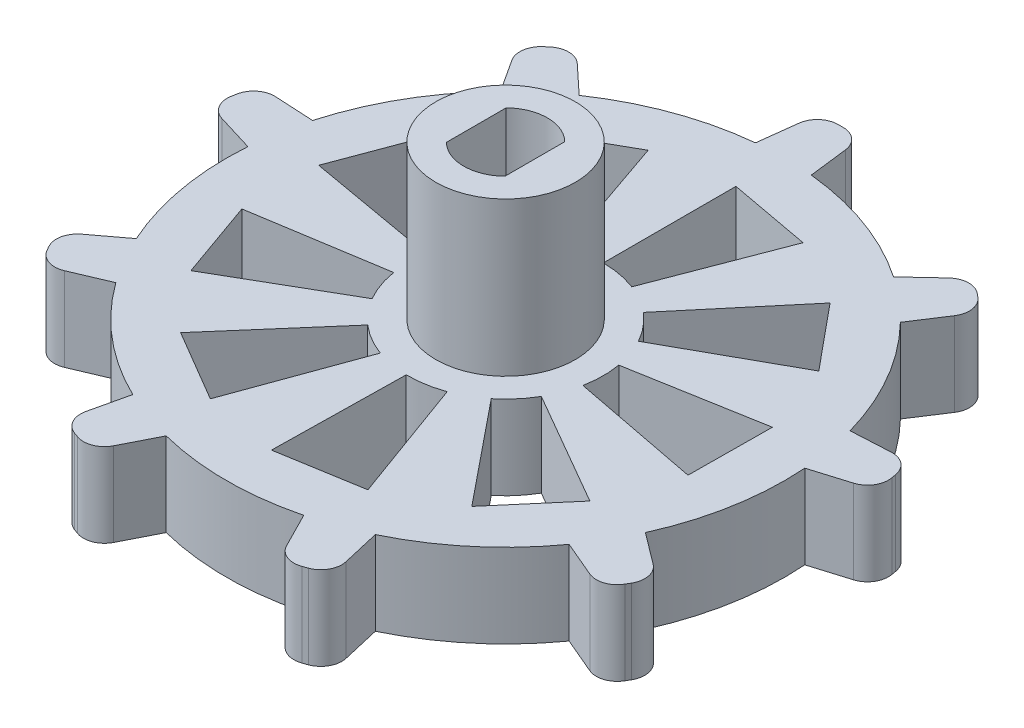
ISO-10303-21;
HEADER;
FILE_DESCRIPTION(('STEP AP214'),'2;1');
FILE_NAME('part.step','',(''),(''),'','','');
FILE_SCHEMA(('AUTOMOTIVE_DESIGN { 1 0 10303 214 1 1 1 1 }'));
ENDSEC;
DATA;
#1=APPLICATION_CONTEXT('core data for automotive mechanical design processes');
#2=APPLICATION_PROTOCOL_DEFINITION('international standard','automotive_design',2000,#1);
#3=PRODUCT_CONTEXT('',#1,'mechanical');
#4=PRODUCT('Part','Part','',(#3));
#5=PRODUCT_RELATED_PRODUCT_CATEGORY('part','',(#4));
#6=PRODUCT_DEFINITION_FORMATION('','',#4);
#7=PRODUCT_DEFINITION_CONTEXT('part definition',#1,'design');
#8=PRODUCT_DEFINITION('design','',#6,#7);
#9=PRODUCT_DEFINITION_SHAPE('','',#8);
#10=(LENGTH_UNIT() NAMED_UNIT(*) SI_UNIT(.MILLI.,.METRE.));
#11=(NAMED_UNIT(*) PLANE_ANGLE_UNIT() SI_UNIT($,.RADIAN.));
#12=(NAMED_UNIT(*) SI_UNIT($,.STERADIAN.) SOLID_ANGLE_UNIT());
#13=UNCERTAINTY_MEASURE_WITH_UNIT(LENGTH_MEASURE(1.E-05),#10,'distance_accuracy_value','');
#14=(GEOMETRIC_REPRESENTATION_CONTEXT(3) GLOBAL_UNCERTAINTY_ASSIGNED_CONTEXT((#13)) GLOBAL_UNIT_ASSIGNED_CONTEXT((#10,
#11,#12)) REPRESENTATION_CONTEXT('',''));
#15=CARTESIAN_POINT('',(0.,0.,0.));
#16=DIRECTION('',(0.,0.,1.));
#17=DIRECTION('',(1.,0.,0.));
#18=AXIS2_PLACEMENT_3D('',#15,#16,#17);
#19=CARTESIAN_POINT('',(0.,6.,0.));
#20=DIRECTION('',(0.,1.,0.));
#21=DIRECTION('',(0.,0.,1.));
#22=AXIS2_PLACEMENT_3D('',#19,#20,#21);
#23=PLANE('',#22);
#24=DIRECTION('',(0.173648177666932,0.,-0.984807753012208));
#25=VECTOR('',#24,1.);
#26=CARTESIAN_POINT('',(-30.2334419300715,6.,-5.33097153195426));
#27=LINE('',#26,#25);
#28=CARTESIAN_POINT('',(-30.1873011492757,6.,-5.59264890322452));
#29=VERTEX_POINT('',#28);
#30=CARTESIAN_POINT('',(-30.1276342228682,6.,-5.93103685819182));
#31=VERTEX_POINT('',#30);
#32=EDGE_CURVE('E785',#29,#31,#27,.T.);
#33=ORIENTED_EDGE('',*,*,#32,.F.);
#34=CARTESIAN_POINT('',(-28.7100895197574,6.,-5.33217663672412));
#35=DIRECTION('',(0.,1.,0.));
#36=DIRECTION('',(0.,0.,1.));
#37=AXIS2_PLACEMENT_3D('',#34,#35,#36);
#38=CIRCLE('',#37,1.5);
#39=CARTESIAN_POINT('',(-29.1474586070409,6.,-3.89735668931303));
#40=VERTEX_POINT('',#39);
#41=EDGE_CURVE('E12',#29,#40,#38,.T.);
#42=ORIENTED_EDGE('',*,*,#41,.T.);
#43=DIRECTION('',(0.956546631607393,0.,0.291579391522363));
#44=VECTOR('',#43,1.);
#45=CARTESIAN_POINT('',(-1.39106545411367,6.,4.56348772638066));
#46=LINE('',#45,#44);
#47=CARTESIAN_POINT('',(-26.4668048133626,6.,-3.08022621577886));
#48=VERTEX_POINT('',#47);
#49=EDGE_CURVE('E787',#40,#48,#46,.T.);
#50=ORIENTED_EDGE('',*,*,#49,.T.);
#51=CARTESIAN_POINT('',(-6.52208161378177,6.,-1.59428661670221));
#52=DIRECTION('',(0.,1.,0.));
#53=DIRECTION('',(0.,0.,1.));
#54=AXIS2_PLACEMENT_3D('',#51,#52,#53);
#55=CIRCLE('',#54,20.);
#56=CARTESIAN_POINT('',(-24.7557695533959,6.,6.62353694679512));
#57=VERTEX_POINT('',#56);
#58=EDGE_CURVE('E789',#48,#57,#55,.T.);
#59=ORIENTED_EDGE('',*,*,#58,.T.);
#60=DIRECTION('',(0.799133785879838,0.,-0.601153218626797));
#61=VECTOR('',#60,1.);
#62=CARTESIAN_POINT('',(-5.76440915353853,6.,-7.662828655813));
#63=LINE('',#62,#61);
#64=CARTESIAN_POINT('',(-26.9952850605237,6.,8.3082260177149));
#65=VERTEX_POINT('',#64);
#66=EDGE_CURVE('E792',#65,#57,#63,.T.);
#67=ORIENTED_EDGE('',*,*,#66,.F.);
#68=CARTESIAN_POINT('',(-26.0935552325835,6.,9.50692669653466));
#69=DIRECTION('',(0.,1.,0.));
#70=DIRECTION('',(0.,0.,1.));
#71=AXIS2_PLACEMENT_3D('',#68,#69,#70);
#72=CIRCLE('',#71,1.5);
#73=CARTESIAN_POINT('',(-27.3925933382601,6.,10.2569266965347));
#74=VERTEX_POINT('',#73);
#75=EDGE_CURVE('E1204',#65,#74,#72,.T.);
#76=ORIENTED_EDGE('',*,*,#75,.T.);
#77=DIRECTION('',(-0.500000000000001,0.,-0.866025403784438));
#78=VECTOR('',#77,1.);
#79=CARTESIAN_POINT('',(-24.985824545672,6.,14.4255725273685));
#80=LINE('',#79,#78);
#81=CARTESIAN_POINT('',(-27.2207892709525,6.,10.5545000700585));
#82=VERTEX_POINT('',#81);
#83=EDGE_CURVE('E794',#82,#74,#80,.T.);
#84=ORIENTED_EDGE('',*,*,#83,.F.);
#85=CARTESIAN_POINT('',(-25.9217511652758,6.,9.80450007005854));
#86=DIRECTION('',(0.,1.,0.));
#87=DIRECTION('',(0.,0.,1.));
#88=AXIS2_PLACEMENT_3D('',#85,#86,#87);
#89=CIRCLE('',#88,1.5);
#90=CARTESIAN_POINT('',(-25.3345108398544,6.,11.1847713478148));
#91=VERTEX_POINT('',#90);
#92=EDGE_CURVE('E1195',#82,#91,#89,.T.);
#93=ORIENTED_EDGE('',*,*,#92,.T.);
#94=DIRECTION('',(0.920180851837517,0.,-0.391493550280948));
#95=VECTOR('',#94,1.);
#96=CARTESIAN_POINT('',(0.146306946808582,6.,0.343885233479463));
#97=LINE('',#96,#95);
#98=CARTESIAN_POINT('',(-22.7557695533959,6.,10.0876385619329));
#99=VERTEX_POINT('',#98);
#100=EDGE_CURVE('E797',#91,#99,#97,.T.);
#101=ORIENTED_EDGE('',*,*,#100,.T.);
#102=CARTESIAN_POINT('',(-6.52208161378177,6.,-1.59428661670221));
#103=DIRECTION('',(0.,1.,0.));
#104=DIRECTION('',(0.,0.,1.));
#105=AXIS2_PLACEMENT_3D('',#102,#103,#104);
#106=CIRCLE('',#105,20.);
#107=CARTESIAN_POINT('',(-15.2075817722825,6.,16.4213201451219));
#108=VERTEX_POINT('',#107);
#109=EDGE_CURVE('E799',#99,#108,#106,.T.);
#110=ORIENTED_EDGE('',*,*,#109,.T.);
#111=DIRECTION('',(0.225758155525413,0.,-0.974183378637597));
#112=VECTOR('',#111,1.);
#113=CARTESIAN_POINT('',(-10.8209624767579,6.,-2.50765983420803));
#114=LINE('',#113,#112);
#115=CARTESIAN_POINT('',(-15.840252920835,6.,19.1513996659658));
#116=VERTEX_POINT('',#115);
#117=EDGE_CURVE('E802',#116,#108,#114,.T.);
#118=ORIENTED_EDGE('',*,*,#117,.F.);
#119=CARTESIAN_POINT('',(-14.3789778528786,6.,19.490036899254));
#120=DIRECTION('',(0.,1.,0.));
#121=DIRECTION('',(0.,0.,1.));
#122=AXIS2_PLACEMENT_3D('',#119,#120,#121);
#123=CIRCLE('',#122,1.5);
#124=CARTESIAN_POINT('',(-14.8920080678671,6.,20.8995758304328));
#125=VERTEX_POINT('',#124);
#126=EDGE_CURVE('E1186',#116,#125,#123,.T.);
#127=ORIENTED_EDGE('',*,*,#126,.T.);
#128=DIRECTION('',(-0.939692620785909,0.,-0.342020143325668));
#129=VECTOR('',#128,1.);
#130=CARTESIAN_POINT('',(-8.45902821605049,6.,23.2409890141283));
#131=LINE('',#130,#129);
#132=CARTESIAN_POINT('',(-14.5691220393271,6.,21.0170967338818));
#133=VERTEX_POINT('',#132);
#134=EDGE_CURVE('E804',#133,#125,#131,.T.);
#135=ORIENTED_EDGE('',*,*,#134,.F.);
#136=CARTESIAN_POINT('',(-14.0560918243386,6.,19.607557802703));
#137=DIRECTION('',(0.,1.,0.));
#138=DIRECTION('',(0.,0.,1.));
#139=AXIS2_PLACEMENT_3D('',#136,#137,#138);
#140=CIRCLE('',#139,1.5);
#141=CARTESIAN_POINT('',(-12.7190183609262,6.,20.2874361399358));
#142=VERTEX_POINT('',#141);
#143=EDGE_CURVE('E1177',#133,#142,#140,.T.);
#144=ORIENTED_EDGE('',*,*,#143,.T.);
#145=DIRECTION('',(0.453252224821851,0.,-0.891382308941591));
#146=VECTOR('',#145,1.);
#147=CARTESIAN_POINT('',(-1.90950348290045,6.,-0.970948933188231));
#148=LINE('',#147,#146);
#149=CARTESIAN_POINT('',(-11.4488112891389,6.,17.7894007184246));
#150=VERTEX_POINT('',#149);
#151=EDGE_CURVE('E807',#142,#150,#148,.T.);
#152=ORIENTED_EDGE('',*,*,#151,.T.);
#153=CARTESIAN_POINT('',(-6.52208161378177,6.,-1.59428661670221));
#154=DIRECTION('',(0.,1.,0.));
#155=DIRECTION('',(0.,0.,1.));
#156=AXIS2_PLACEMENT_3D('',#153,#154,#155);
#157=CIRCLE('',#156,20.);
#158=CARTESIAN_POINT('',(-1.59535193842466,6.,17.7894007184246));
#159=VERTEX_POINT('',#158);
#160=EDGE_CURVE('E809',#150,#159,#157,.T.);
#161=ORIENTED_EDGE('',*,*,#160,.T.);
#162=DIRECTION('',(-0.453252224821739,0.,-0.891382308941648));
#163=VECTOR('',#162,1.);
#164=CARTESIAN_POINT('',(-8.45489842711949,6.,4.29916712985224));
#165=LINE('',#164,#163);
#166=CARTESIAN_POINT('',(-0.325144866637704,6.,20.2874361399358));
#167=VERTEX_POINT('',#166);
#168=EDGE_CURVE('E812',#167,#159,#165,.T.);
#169=ORIENTED_EDGE('',*,*,#168,.F.);
#170=CARTESIAN_POINT('',(1.01192859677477,6.,19.6075578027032));
#171=DIRECTION('',(0.,1.,0.));
#172=DIRECTION('',(0.,0.,1.));
#173=AXIS2_PLACEMENT_3D('',#170,#171,#172);
#174=CIRCLE('',#173,1.5);
#175=CARTESIAN_POINT('',(1.52495881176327,6.,21.0170967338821));
#176=VERTEX_POINT('',#175);
#177=EDGE_CURVE('E1213',#167,#176,#174,.T.);
#178=ORIENTED_EDGE('',*,*,#177,.T.);
#179=DIRECTION('',(-0.939692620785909,0.,0.342020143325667));
#180=VECTOR('',#179,1.);
#181=CARTESIAN_POINT('',(6.93315098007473,6.,19.0486757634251));
#182=LINE('',#181,#180);
#183=CARTESIAN_POINT('',(1.84784484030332,6.,20.8995758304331));
#184=VERTEX_POINT('',#183);
#185=EDGE_CURVE('E814',#184,#176,#182,.T.);
#186=ORIENTED_EDGE('',*,*,#185,.F.);
#187=CARTESIAN_POINT('',(1.33481462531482,6.,19.4900368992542));
#188=DIRECTION('',(0.,1.,0.));
#189=DIRECTION('',(0.,0.,1.));
#190=AXIS2_PLACEMENT_3D('',#187,#188,#189);
#191=CIRCLE('',#190,1.5);
#192=CARTESIAN_POINT('',(2.79608969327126,6.,19.1513996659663));
#193=VERTEX_POINT('',#192);
#194=EDGE_CURVE('E1223',#184,#193,#191,.T.);
#195=ORIENTED_EDGE('',*,*,#194,.T.);
#196=DIRECTION('',(-0.225758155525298,0.,-0.974183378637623));
#197=VECTOR('',#196,1.);
#198=CARTESIAN_POINT('',(-1.55838221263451,6.,0.361140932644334));
#199=LINE('',#198,#197);
#200=CARTESIAN_POINT('',(2.16341854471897,6.,16.4213201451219));
#201=VERTEX_POINT('',#200);
#202=EDGE_CURVE('E816',#193,#201,#199,.T.);
#203=ORIENTED_EDGE('',*,*,#202,.T.);
#204=CARTESIAN_POINT('',(-6.52208161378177,6.,-1.59428661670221));
#205=DIRECTION('',(0.,1.,0.));
#206=DIRECTION('',(0.,0.,1.));
#207=AXIS2_PLACEMENT_3D('',#204,#205,#206);
#208=CIRCLE('',#207,20.);
#209=CARTESIAN_POINT('',(9.71160632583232,6.,10.0876385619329));
#210=VERTEX_POINT('',#209);
#211=EDGE_CURVE('E818',#201,#210,#208,.T.);
#212=ORIENTED_EDGE('',*,*,#211,.T.);
#213=DIRECTION('',(-0.920180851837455,0.,-0.391493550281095));
#214=VECTOR('',#213,1.);
#215=CARTESIAN_POINT('',(-2.14554931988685,6.,5.04297810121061));
#216=LINE('',#215,#214);
#217=CARTESIAN_POINT('',(12.2903476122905,6.,11.1847713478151));
#218=VERTEX_POINT('',#217);
#219=EDGE_CURVE('E821',#218,#210,#216,.T.);
#220=ORIENTED_EDGE('',*,*,#219,.F.);
#221=CARTESIAN_POINT('',(12.8775879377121,6.,9.80450007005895));
#222=DIRECTION('',(0.,1.,0.));
#223=DIRECTION('',(0.,0.,1.));
#224=AXIS2_PLACEMENT_3D('',#221,#222,#223);
#225=CIRCLE('',#224,1.5);
#226=CARTESIAN_POINT('',(14.1766260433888,6.,10.5545000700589));
#227=VERTEX_POINT('',#226);
#228=EDGE_CURVE('E1232',#218,#227,#225,.T.);
#229=ORIENTED_EDGE('',*,*,#228,.T.);
#230=DIRECTION('',(-0.5,0.,0.866025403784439));
#231=VECTOR('',#230,1.);
#232=CARTESIAN_POINT('',(15.2027021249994,6.,8.77728416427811));
#233=LINE('',#232,#231);
#234=CARTESIAN_POINT('',(14.3484301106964,6.,10.2569266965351));
#235=VERTEX_POINT('',#234);
#236=EDGE_CURVE('E823',#235,#227,#233,.T.);
#237=ORIENTED_EDGE('',*,*,#236,.F.);
#238=CARTESIAN_POINT('',(13.0493920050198,6.,9.50692669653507));
#239=DIRECTION('',(0.,1.,0.));
#240=DIRECTION('',(0.,0.,1.));
#241=AXIS2_PLACEMENT_3D('',#238,#239,#240);
#242=CIRCLE('',#241,1.5);
#243=CARTESIAN_POINT('',(13.9511218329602,6.,8.30822601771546));
#244=VERTEX_POINT('',#243);
#245=EDGE_CURVE('E1242',#235,#244,#242,.T.);
#246=ORIENTED_EDGE('',*,*,#245,.T.);
#247=DIRECTION('',(-0.799133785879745,0.,-0.601153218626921));
#248=VECTOR('',#247,1.);
#249=CARTESIAN_POINT('',(1.05044171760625,6.,-1.39638854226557));
#250=LINE('',#249,#248);
#251=CARTESIAN_POINT('',(11.7116063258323,6.,6.62353694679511));
#252=VERTEX_POINT('',#251);
#253=EDGE_CURVE('E825',#244,#252,#250,.T.);
#254=ORIENTED_EDGE('',*,*,#253,.T.);
#255=CARTESIAN_POINT('',(-6.52208161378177,6.,-1.59428661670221));
#256=DIRECTION('',(0.,1.,0.));
#257=DIRECTION('',(0.,0.,1.));
#258=AXIS2_PLACEMENT_3D('',#255,#256,#257);
#259=CIRCLE('',#258,20.);
#260=CARTESIAN_POINT('',(13.422641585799,6.,-3.08022621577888));
#261=VERTEX_POINT('',#260);
#262=EDGE_CURVE('E827',#252,#261,#259,.T.);
#263=ORIENTED_EDGE('',*,*,#262,.T.);
#264=DIRECTION('',(-0.956546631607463,0.,0.291579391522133));
#265=VECTOR('',#264,1.);
#266=CARTESIAN_POINT('',(0.28206972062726,6.,0.925349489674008));
#267=LINE('',#266,#265);
#268=CARTESIAN_POINT('',(16.1032953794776,6.,-3.89735668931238));
#269=VERTEX_POINT('',#268);
#270=EDGE_CURVE('E830',#269,#261,#267,.T.);
#271=ORIENTED_EDGE('',*,*,#270,.F.);
#272=CARTESIAN_POINT('',(15.6659262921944,6.,-5.33217663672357));
#273=DIRECTION('',(0.,1.,0.));
#274=DIRECTION('',(0.,0.,1.));
#275=AXIS2_PLACEMENT_3D('',#272,#273,#274);
#276=CIRCLE('',#275,1.5);
#277=CARTESIAN_POINT('',(17.1431379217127,6.,-5.59264890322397));
#278=VERTEX_POINT('',#277);
#279=EDGE_CURVE('E1251',#269,#278,#276,.T.);
#280=ORIENTED_EDGE('',*,*,#279,.T.);
#281=DIRECTION('',(0.173648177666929,0.,0.984807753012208));
#282=VECTOR('',#281,1.);
#283=CARTESIAN_POINT('',(17.582608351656,6.,-3.10028824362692));
#284=LINE('',#283,#282);
#285=CARTESIAN_POINT('',(17.0834709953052,6.,-5.93103685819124));
#286=VERTEX_POINT('',#285);
#287=EDGE_CURVE('E832',#286,#278,#284,.T.);
#288=ORIENTED_EDGE('',*,*,#287,.F.);
#289=CARTESIAN_POINT('',(15.6062593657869,6.,-5.67056459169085));
#290=DIRECTION('',(0.,1.,0.));
#291=DIRECTION('',(0.,0.,1.));
#292=AXIS2_PLACEMENT_3D('',#289,#290,#291);
#293=CIRCLE('',#292,1.5);
#294=CARTESIAN_POINT('',(15.5265145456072,6.,-7.16844334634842));
#295=VERTEX_POINT('',#294);
#296=EDGE_CURVE('E1261',#286,#295,#293,.T.);
#297=ORIENTED_EDGE('',*,*,#296,.T.);
#298=DIRECTION('',(-0.99858583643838,0.,0.0531632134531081));
#299=VECTOR('',#298,1.);
#300=CARTESIAN_POINT('',(-0.33667553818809,6.,-6.32391087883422));
#301=LINE('',#300,#299);
#302=CARTESIAN_POINT('',(12.7280488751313,6.,-7.01945722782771));
#303=VERTEX_POINT('',#302);
#304=EDGE_CURVE('E834',#295,#303,#301,.T.);
#305=ORIENTED_EDGE('',*,*,#304,.T.);
#306=CARTESIAN_POINT('',(-6.52208161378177,6.,-1.59428661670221));
#307=DIRECTION('',(0.,1.,0.));
#308=DIRECTION('',(0.,0.,1.));
#309=AXIS2_PLACEMENT_3D('',#306,#307,#308);
#310=CIRCLE('',#309,20.);
#311=CARTESIAN_POINT('',(7.80131919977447,6.,-15.5528033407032));
#312=VERTEX_POINT('',#311);
#313=EDGE_CURVE('E836',#303,#312,#310,.T.);
#314=ORIENTED_EDGE('',*,*,#313,.T.);
#315=DIRECTION('',(-0.545333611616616,0.,0.838219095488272));
#316=VECTOR('',#315,1.);
#317=CARTESIAN_POINT('',(-1.62803245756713,6.,-1.05917513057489));
#318=LINE('',#317,#316);
#319=CARTESIAN_POINT('',(9.32957779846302,6.,-17.9018526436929));
#320=VERTEX_POINT('',#319);
#321=EDGE_CURVE('E839',#320,#312,#318,.T.);
#322=ORIENTED_EDGE('',*,*,#321,.F.);
#323=CARTESIAN_POINT('',(8.07224915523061,6.,-18.7198530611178));
#324=DIRECTION('',(0.,1.,0.));
#325=DIRECTION('',(0.,0.,1.));
#326=AXIS2_PLACEMENT_3D('',#323,#324,#325);
#327=CIRCLE('',#326,1.5);
#328=CARTESIAN_POINT('',(9.03643056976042,6.,-19.8689197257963));
#329=VERTEX_POINT('',#328);
#330=EDGE_CURVE('E1270',#320,#329,#327,.T.);
#331=ORIENTED_EDGE('',*,*,#330,.T.);
#332=DIRECTION('',(0.766044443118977,0.,0.64278760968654));
#333=VECTOR('',#332,1.);
#334=CARTESIAN_POINT('',(13.5171685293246,6.,-16.109134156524));
#335=LINE('',#334,#333);
#336=CARTESIAN_POINT('',(8.77321146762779,6.,-20.0897867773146));
#337=VERTEX_POINT('',#336);
#338=EDGE_CURVE('E841',#337,#329,#335,.T.);
#339=ORIENTED_EDGE('',*,*,#338,.F.);
#340=CARTESIAN_POINT('',(7.80903005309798,6.,-18.9407201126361));
#341=DIRECTION('',(0.,1.,0.));
#342=DIRECTION('',(0.,0.,1.));
#343=AXIS2_PLACEMENT_3D('',#340,#341,#342);
#344=CIRCLE('',#343,1.5);
#345=CARTESIAN_POINT('',(6.78512407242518,6.,-20.0369028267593));
#346=VERTEX_POINT('',#345);
#347=EDGE_CURVE('E1280',#337,#346,#344,.T.);
#348=ORIENTED_EDGE('',*,*,#347,.T.);
#349=DIRECTION('',(-0.730788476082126,0.,0.682603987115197));
#350=VECTOR('',#349,1.);
#351=CARTESIAN_POINT('',(-6.83367475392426,6.,-7.31605858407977));
#352=LINE('',#351,#350);
#353=CARTESIAN_POINT('',(4.73714142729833,6.,-18.1239537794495));
#354=VERTEX_POINT('',#353);
#355=EDGE_CURVE('E760',#346,#354,#352,.T.);
#356=ORIENTED_EDGE('',*,*,#355,.T.);
#357=CARTESIAN_POINT('',(-6.52208161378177,6.,-1.59428661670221));
#358=DIRECTION('',(0.,1.,0.));
#359=DIRECTION('',(0.,0.,1.));
#360=AXIS2_PLACEMENT_3D('',#357,#358,#359);
#361=CIRCLE('',#360,19.9999999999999);
#362=CARTESIAN_POINT('',(-4.52208161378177,6.,-21.4940353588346));
#363=VERTEX_POINT('',#362);
#364=EDGE_CURVE('E762',#354,#363,#361,.T.);
#365=ORIENTED_EDGE('',*,*,#364,.T.);
#366=DIRECTION('',(0.121047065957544,0.,0.992646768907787));
#367=VECTOR('',#366,1.);
#368=CARTESIAN_POINT('',(-1.87316394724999,6.,0.228420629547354));
#369=LINE('',#368,#367);
#370=CARTESIAN_POINT('',(-4.86130739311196,6.,-24.2758572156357));
#371=VERTEX_POINT('',#370);
#372=EDGE_CURVE('E765',#371,#363,#369,.T.);
#373=ORIENTED_EDGE('',*,*,#372,.F.);
#374=CARTESIAN_POINT('',(-6.35027754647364,6.,-24.0942866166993));
#375=DIRECTION('',(0.,1.,0.));
#376=DIRECTION('',(0.,0.,1.));
#377=AXIS2_PLACEMENT_3D('',#374,#375,#376);
#378=CIRCLE('',#377,1.5);
#379=CARTESIAN_POINT('',(-6.35027754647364,6.,-25.5942866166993));
#380=VERTEX_POINT('',#379);
#381=EDGE_CURVE('E1289',#371,#380,#378,.T.);
#382=ORIENTED_EDGE('',*,*,#381,.T.);
#383=DIRECTION('',(1.,0.,0.));
#384=VECTOR('',#383,1.);
#385=CARTESIAN_POINT('',(0.,6.,-25.5942866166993));
#386=LINE('',#385,#384);
#387=CARTESIAN_POINT('',(-6.69388568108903,6.,-25.5942866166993));
#388=VERTEX_POINT('',#387);
#389=EDGE_CURVE('E767',#388,#380,#386,.T.);
#390=ORIENTED_EDGE('',*,*,#389,.F.);
#391=CARTESIAN_POINT('',(-6.69388568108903,6.,-24.0942866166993));
#392=DIRECTION('',(0.,1.,0.));
#393=DIRECTION('',(0.,0.,1.));
#394=AXIS2_PLACEMENT_3D('',#391,#392,#393);
#395=CIRCLE('',#394,1.5);
#396=CARTESIAN_POINT('',(-8.18285583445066,6.,-24.2758572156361));
#397=VERTEX_POINT('',#396);
#398=EDGE_CURVE('E1299',#388,#397,#395,.T.);
#399=ORIENTED_EDGE('',*,*,#398,.T.);
#400=DIRECTION('',(-0.121047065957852,0.,0.99264676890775));
#401=VECTOR('',#400,1.);
#402=CARTESIAN_POINT('',(-10.9798710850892,6.,-1.3389266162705));
#403=LINE('',#402,#401);
#404=CARTESIAN_POINT('',(-8.52208161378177,6.,-21.4940353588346));
#405=VERTEX_POINT('',#404);
#406=EDGE_CURVE('E769',#397,#405,#403,.T.);
#407=ORIENTED_EDGE('',*,*,#406,.T.);
#408=CARTESIAN_POINT('',(-6.52208161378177,6.,-1.59428661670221));
#409=DIRECTION('',(0.,1.,0.));
#410=DIRECTION('',(0.,0.,1.));
#411=AXIS2_PLACEMENT_3D('',#408,#409,#410);
#412=CIRCLE('',#411,19.9999999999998);
#413=CARTESIAN_POINT('',(-17.7813046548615,6.,-18.1239537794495));
#414=VERTEX_POINT('',#413);
#415=EDGE_CURVE('E771',#405,#414,#412,.T.);
#416=ORIENTED_EDGE('',*,*,#415,.T.);
#417=DIRECTION('',(0.730788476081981,0.,0.682603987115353));
#418=VECTOR('',#417,1.);
#419=CARTESIAN_POINT('',(0.755770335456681,6.,-0.809119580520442));
#420=LINE('',#419,#418);
#421=CARTESIAN_POINT('',(-19.8292872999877,6.,-20.0369028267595));
#422=VERTEX_POINT('',#421);
#423=EDGE_CURVE('E774',#422,#414,#420,.T.);
#424=ORIENTED_EDGE('',*,*,#423,.F.);
#425=CARTESIAN_POINT('',(-20.8531932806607,6.,-18.9407201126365));
#426=DIRECTION('',(0.,1.,0.));
#427=DIRECTION('',(0.,0.,1.));
#428=AXIS2_PLACEMENT_3D('',#425,#426,#427);
#429=CIRCLE('',#428,1.5);
#430=CARTESIAN_POINT('',(-21.8173746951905,6.,-20.0897867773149));
#431=VERTEX_POINT('',#430);
#432=EDGE_CURVE('E1308',#422,#431,#429,.T.);
#433=ORIENTED_EDGE('',*,*,#432,.T.);
#434=DIRECTION('',(0.766044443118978,0.,-0.642787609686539));
#435=VECTOR('',#434,1.);
#436=CARTESIAN_POINT('',(-18.906702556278,6.,-22.5321306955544));
#437=LINE('',#436,#435);
#438=CARTESIAN_POINT('',(-22.0805937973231,6.,-19.8689197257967));
#439=VERTEX_POINT('',#438);
#440=EDGE_CURVE('E776',#439,#431,#437,.T.);
#441=ORIENTED_EDGE('',*,*,#440,.F.);
#442=CARTESIAN_POINT('',(-21.1164123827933,6.,-18.7198530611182));
#443=DIRECTION('',(0.,1.,0.));
#444=DIRECTION('',(0.,0.,1.));
#445=AXIS2_PLACEMENT_3D('',#442,#443,#444);
#446=CIRCLE('',#445,1.5);
#447=CARTESIAN_POINT('',(-22.3737410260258,6.,-17.9018526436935));
#448=VERTEX_POINT('',#447);
#449=EDGE_CURVE('E1318',#439,#448,#446,.T.);
#450=ORIENTED_EDGE('',*,*,#449,.T.);
#451=DIRECTION('',(0.545333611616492,0.,0.838219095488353));
#452=VECTOR('',#451,1.);
#453=CARTESIAN_POINT('',(-7.53694339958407,6.,4.90342988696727));
#454=LINE('',#453,#452);
#455=CARTESIAN_POINT('',(-20.8454824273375,6.,-15.5528033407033));
#456=VERTEX_POINT('',#455);
#457=EDGE_CURVE('E778',#448,#456,#454,.T.);
#458=ORIENTED_EDGE('',*,*,#457,.T.);
#459=CARTESIAN_POINT('',(-6.52208161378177,6.,-1.59428661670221));
#460=DIRECTION('',(0.,1.,0.));
#461=DIRECTION('',(0.,0.,1.));
#462=AXIS2_PLACEMENT_3D('',#459,#460,#461);
#463=CIRCLE('',#462,19.9999999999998);
#464=CARTESIAN_POINT('',(-25.7722121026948,6.,-7.0194572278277));
#465=VERTEX_POINT('',#464);
#466=EDGE_CURVE('E780',#456,#465,#463,.T.);
#467=ORIENTED_EDGE('',*,*,#466,.T.);
#468=DIRECTION('',(0.998585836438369,0.,0.0531632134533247));
#469=VECTOR('',#468,1.);
#470=CARTESIAN_POINT('',(0.299808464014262,6.,-5.63142192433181));
#471=LINE('',#470,#469);
#472=CARTESIAN_POINT('',(-28.5706777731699,6.,-7.16844334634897));
#473=VERTEX_POINT('',#472);
#474=EDGE_CURVE('E783',#473,#465,#471,.T.);
#475=ORIENTED_EDGE('',*,*,#474,.F.);
#476=CARTESIAN_POINT('',(-28.6504225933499,6.,-5.67056459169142));
#477=DIRECTION('',(0.,1.,0.));
#478=DIRECTION('',(0.,0.,1.));
#479=AXIS2_PLACEMENT_3D('',#476,#477,#478);
#480=CIRCLE('',#479,1.5);
#481=EDGE_CURVE('E1327',#473,#31,#480,.T.);
#482=ORIENTED_EDGE('',*,*,#481,.T.);
#483=EDGE_LOOP('',(#33,#42,#50,#59,#67,#76,#84,#93,#101,#110,#118,#127,#135,#144,#152,#161,#169,
#178,#186,#195,#203,#212,#220,#229,#237,#246,#254,#263,#271,#280,#288,#297,#305,#314,#322,#331,
#339,#348,#356,#365,#373,#382,#390,#399,#407,#416,#424,#433,#441,#450,#458,#467,#475,#482));
#484=FACE_BOUND('',#483,.T.);
#485=DIRECTION('',(0.857604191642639,0.,0.514310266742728));
#486=VECTOR('',#485,1.);
#487=CARTESIAN_POINT('',(-1.02198935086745,6.,1.70415099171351));
#488=LINE('',#487,#486);
#489=CARTESIAN_POINT('',(-20.6725507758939,6.,-10.0804060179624));
#490=VERTEX_POINT('',#489);
#491=CARTESIAN_POINT('',(-12.5253109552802,6.,-5.19445848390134));
#492=VERTEX_POINT('',#491);
#493=EDGE_CURVE('E751',#490,#492,#488,.T.);
#494=ORIENTED_EDGE('',*,*,#493,.T.);
#495=CARTESIAN_POINT('',(-6.52208161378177,6.,-1.59428661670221));
#496=DIRECTION('',(0.,1.,0.));
#497=DIRECTION('',(0.,0.,1.));
#498=AXIS2_PLACEMENT_3D('',#495,#496,#497);
#499=CIRCLE('',#498,7.);
#500=CARTESIAN_POINT('',(-13.4157358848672,6.,-2.80982386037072));
#501=VERTEX_POINT('',#500);
#502=EDGE_CURVE('E754',#492,#501,#499,.T.);
#503=ORIENTED_EDGE('',*,*,#502,.T.);
#504=DIRECTION('',(-0.984807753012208,0.,-0.173648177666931));
#505=VECTOR('',#504,1.);
#506=CARTESIAN_POINT('',(0.0759742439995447,6.,-0.430871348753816));
#507=LINE('',#506,#505);
#508=CARTESIAN_POINT('',(-22.771409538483,6.,-4.45948154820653));
#509=VERTEX_POINT('',#508);
#510=EDGE_CURVE('E756',#501,#509,#507,.T.);
#511=ORIENTED_EDGE('',*,*,#510,.T.);
#512=DIRECTION('',(0.349809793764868,0.,-0.936820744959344));
#513=VECTOR('',#512,1.);
#514=CARTESIAN_POINT('',(-21.4463554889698,6.,-8.0080903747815));
#515=LINE('',#514,#513);
#516=EDGE_CURVE('E758',#509,#490,#515,.T.);
#517=ORIENTED_EDGE('',*,*,#516,.T.);
#518=EDGE_LOOP('',(#494,#503,#511,#517));
#519=FACE_BOUND('',#518,.T.);
#520=DIRECTION('',(0.65541814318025,0.,-0.755266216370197));
#521=VECTOR('',#520,1.);
#522=CARTESIAN_POINT('',(-4.50956790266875,6.,-3.9133918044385));
#523=LINE('',#522,#521);
#524=CARTESIAN_POINT('',(-17.3364809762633,6.,10.8676059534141));
#525=VERTEX_POINT('',#524);
#526=CARTESIAN_POINT('',(-11.1100086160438,6.,3.69257689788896));
#527=VERTEX_POINT('',#526);
#528=EDGE_CURVE('E742',#525,#527,#523,.T.);
#529=ORIENTED_EDGE('',*,*,#528,.T.);
#530=CARTESIAN_POINT('',(-6.52208161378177,6.,-1.59428661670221));
#531=DIRECTION('',(0.,1.,0.));
#532=DIRECTION('',(0.,0.,1.));
#533=AXIS2_PLACEMENT_3D('',#530,#531,#532);
#534=CIRCLE('',#533,6.99999999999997);
#535=CARTESIAN_POINT('',(-8.91622261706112,6.,4.9835617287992));
#536=VERTEX_POINT('',#535);
#537=EDGE_CURVE('E745',#527,#536,#534,.T.);
#538=ORIENTED_EDGE('',*,*,#537,.T.);
#539=DIRECTION('',(-0.342020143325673,0.,0.939692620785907));
#540=VECTOR('',#539,1.);
#541=CARTESIAN_POINT('',(-6.27153683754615,6.,-2.28265273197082));
#542=LINE('',#541,#540);
#543=CARTESIAN_POINT('',(-12.165413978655,6.,13.9106416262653));
#544=VERTEX_POINT('',#543);
#545=EDGE_CURVE('E747',#536,#544,#542,.T.);
#546=ORIENTED_EDGE('',*,*,#545,.T.);
#547=DIRECTION('',(-0.861844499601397,0.,-0.50717261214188));
#548=VECTOR('',#547,1.);
#549=CARTESIAN_POINT('',(-9.20963322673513,6.,15.6500401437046));
#550=LINE('',#549,#548);
#551=EDGE_CURVE('E749',#544,#525,#550,.T.);
#552=ORIENTED_EDGE('',*,*,#551,.T.);
#553=EDGE_LOOP('',(#529,#538,#546,#552));
#554=FACE_BOUND('',#553,.T.);
#555=DIRECTION('',(-0.629979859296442,0.,-0.776611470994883));
#556=VECTOR('',#555,1.);
#557=CARTESIAN_POINT('',(-3.15362886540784,6.,2.55819382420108));
#558=LINE('',#557,#556);
#559=CARTESIAN_POINT('',(3.87258606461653,6.,11.2198026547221));
#560=VERTEX_POINT('',#559);
#561=CARTESIAN_POINT('',(-2.11222259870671,6.,3.841993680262));
#562=VERTEX_POINT('',#561);
#563=EDGE_CURVE('E733',#560,#562,#558,.T.);
#564=ORIENTED_EDGE('',*,*,#563,.T.);
#565=CARTESIAN_POINT('',(-6.52208161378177,6.,-1.59428661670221));
#566=DIRECTION('',(0.,1.,0.));
#567=DIRECTION('',(0.,0.,1.));
#568=AXIS2_PLACEMENT_3D('',#565,#566,#567);
#569=CIRCLE('',#568,7.00000000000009);
#570=CARTESIAN_POINT('',(-0.459903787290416,6.,1.90571338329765));
#571=VERTEX_POINT('',#570);
#572=EDGE_CURVE('E736',#562,#571,#569,.T.);
#573=ORIENTED_EDGE('',*,*,#572,.T.);
#574=DIRECTION('',(0.866025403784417,0.,0.500000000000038));
#575=VECTOR('',#574,1.);
#576=CARTESIAN_POINT('',(-0.940174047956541,6.,1.62842921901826));
#577=LINE('',#576,#575);
#578=CARTESIAN_POINT('',(7.76733754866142,6.,6.65571338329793));
#579=VERTEX_POINT('',#578);
#580=EDGE_CURVE('E738',#571,#579,#577,.T.);
#581=ORIENTED_EDGE('',*,*,#580,.T.);
#582=DIRECTION('',(-0.649125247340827,0.,0.760681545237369));
#583=VECTOR('',#582,1.);
#584=CARTESIAN_POINT('',(7.7809064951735,6.,6.63981252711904));
#585=LINE('',#584,#583);
#586=EDGE_CURVE('E740',#579,#560,#585,.T.);
#587=ORIENTED_EDGE('',*,*,#586,.T.);
#588=EDGE_LOOP('',(#564,#573,#581,#587));
#589=FACE_BOUND('',#588,.T.);
#590=DIRECTION('',(-0.874207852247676,0.,0.485551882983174));
#591=VECTOR('',#590,1.);
#592=CARTESIAN_POINT('',(-2.21438212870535,6.,-3.98686589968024));
#593=LINE('',#592,#591);
#594=CARTESIAN_POINT('',(7.90234794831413,6.,-9.60589268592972));
#595=VERTEX_POINT('',#594);
#596=CARTESIAN_POINT('',(-0.402626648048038,6.,-4.99314979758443));
#597=VERTEX_POINT('',#596);
#598=EDGE_CURVE('E724',#595,#597,#593,.T.);
#599=ORIENTED_EDGE('',*,*,#598,.T.);
#600=CARTESIAN_POINT('',(-6.52208161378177,6.,-1.59428661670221));
#601=DIRECTION('',(0.,1.,0.));
#602=DIRECTION('',(0.,0.,1.));
#603=AXIS2_PLACEMENT_3D('',#600,#601,#602);
#604=CIRCLE('',#603,7.00000000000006);
#605=CARTESIAN_POINT('',(-2.02256834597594,6.,-6.95659771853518));
#606=VERTEX_POINT('',#605);
#607=EDGE_CURVE('E727',#597,#606,#604,.T.);
#608=ORIENTED_EDGE('',*,*,#607,.T.);
#609=DIRECTION('',(0.64278760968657,0.,-0.766044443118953));
#610=VECTOR('',#609,1.);
#611=CARTESIAN_POINT('',(-4.61234751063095,6.,-3.87021909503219));
#612=LINE('',#611,#610);
#613=CARTESIAN_POINT('',(4.08391394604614,6.,-14.2340199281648));
#614=VERTEX_POINT('',#613);
#615=EDGE_CURVE('E729',#606,#614,#612,.T.);
#616=ORIENTED_EDGE('',*,*,#615,.T.);
#617=DIRECTION('',(0.636405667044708,0.,0.771354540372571));
#618=VECTOR('',#617,1.);
#619=CARTESIAN_POINT('',(9.41727976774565,6.,-7.76972183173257));
#620=LINE('',#619,#618);
#621=EDGE_CURVE('E731',#614,#595,#620,.T.);
#622=ORIENTED_EDGE('',*,*,#621,.T.);
#623=EDGE_LOOP('',(#599,#608,#616,#622));
#624=FACE_BOUND('',#623,.T.);
#625=DIRECTION('',(-0.357575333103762,0.,0.933884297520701));
#626=VECTOR('',#625,1.);
#627=CARTESIAN_POINT('',(-6.22055397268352,6.,-2.381790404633));
#628=LINE('',#627,#626);
#629=CARTESIAN_POINT('',(-0.622088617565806,6.,-17.0033775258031));
#630=VERTEX_POINT('',#629);
#631=CARTESIAN_POINT('',(-4.01905428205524,6.,-8.13147669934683));
#632=VERTEX_POINT('',#631);
#633=EDGE_CURVE('E712',#630,#632,#628,.T.);
#634=ORIENTED_EDGE('',*,*,#633,.T.);
#635=CARTESIAN_POINT('',(-6.52208161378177,6.,-1.59428661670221));
#636=DIRECTION('',(0.,1.,0.));
#637=DIRECTION('',(0.,0.,1.));
#638=AXIS2_PLACEMENT_3D('',#635,#636,#637);
#639=CIRCLE('',#638,6.9999999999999);
#640=CARTESIAN_POINT('',(-6.52208161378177,6.,-8.59428661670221));
#641=VERTEX_POINT('',#640);
#642=EDGE_CURVE('E715',#632,#641,#639,.T.);
#643=ORIENTED_EDGE('',*,*,#642,.T.);
#644=DIRECTION('',(0.,0.,-1.));
#645=VECTOR('',#644,1.);
#646=CARTESIAN_POINT('',(-6.52208161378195,6.,-1.38149993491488E-13));
#647=LINE('',#646,#645);
#648=CARTESIAN_POINT('',(-6.52208161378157,6.,-18.0942866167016));
#649=VERTEX_POINT('',#648);
#650=EDGE_CURVE('E717',#641,#649,#647,.T.);
#651=ORIENTED_EDGE('',*,*,#650,.T.);
#652=DIRECTION('',(0.983332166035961,0.,0.181818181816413));
#653=VECTOR('',#652,1.);
#654=CARTESIAN_POINT('',(3.01942927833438,6.,-16.3300606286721));
#655=LINE('',#654,#653);
#656=EDGE_CURVE('E719',#649,#630,#655,.T.);
#657=ORIENTED_EDGE('',*,*,#656,.T.);
#658=EDGE_LOOP('',(#634,#643,#651,#657));
#659=FACE_BOUND('',#658,.T.);
#660=DIRECTION('',(-0.981788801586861,0.,-0.18997565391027));
#661=VECTOR('',#660,1.);
#662=CARTESIAN_POINT('',(0.0619731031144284,6.,-0.320275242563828));
#663=LINE('',#662,#661);
#664=CARTESIAN_POINT('',(9.67743361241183,6.,1.54031167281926));
#665=VERTEX_POINT('',#664);
#666=CARTESIAN_POINT('',(0.350439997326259,6.,-0.26445703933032));
#667=VERTEX_POINT('',#666);
#668=EDGE_CURVE('E703',#665,#667,#663,.T.);
#669=ORIENTED_EDGE('',*,*,#668,.T.);
#670=CARTESIAN_POINT('',(-6.52208161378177,6.,-1.59428661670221));
#671=DIRECTION('',(0.,1.,0.));
#672=DIRECTION('',(0.,0.,1.));
#673=AXIS2_PLACEMENT_3D('',#670,#671,#672);
#674=CIRCLE('',#673,7.0000000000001);
#675=CARTESIAN_POINT('',(0.371572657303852,6.,-2.8098238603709));
#676=VERTEX_POINT('',#675);
#677=EDGE_CURVE('E706',#667,#676,#674,.T.);
#678=ORIENTED_EDGE('',*,*,#677,.T.);
#679=DIRECTION('',(0.984807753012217,0.,-0.173648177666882));
#680=VECTOR('',#679,1.);
#681=CARTESIAN_POINT('',(-0.46930389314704,6.,-2.66155463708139));
#682=LINE('',#681,#680);
#683=CARTESIAN_POINT('',(9.72724631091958,6.,-4.45948154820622));
#684=VERTEX_POINT('',#683);
#685=EDGE_CURVE('E708',#676,#684,#682,.T.);
#686=ORIENTED_EDGE('',*,*,#685,.T.);
#687=DIRECTION('',(-0.00830211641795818,0.,0.999965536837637));
#688=VECTOR('',#687,1.);
#689=CARTESIAN_POINT('',(9.68955400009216,6.,0.0804465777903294));
#690=LINE('',#689,#688);
#691=EDGE_CURVE('E710',#684,#665,#690,.T.);
#692=ORIENTED_EDGE('',*,*,#691,.T.);
#693=EDGE_LOOP('',(#669,#678,#686,#692));
#694=FACE_BOUND('',#693,.T.);
#695=DIRECTION('',(0.0166036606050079,0.,-0.999862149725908));
#696=VECTOR('',#695,1.);
#697=CARTESIAN_POINT('',(-6.54675094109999,6.,-0.108715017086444));
#698=LINE('',#697,#696);
#699=CARTESIAN_POINT('',(-6.79604201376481,6.,14.9034388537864));
#700=VERTEX_POINT('',#699);
#701=CARTESIAN_POINT('',(-6.63830723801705,6.,5.40474843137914));
#702=VERTEX_POINT('',#701);
#703=EDGE_CURVE('E694',#700,#702,#698,.T.);
#704=ORIENTED_EDGE('',*,*,#703,.T.);
#705=CARTESIAN_POINT('',(-6.52208161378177,6.,-1.59428661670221));
#706=DIRECTION('',(0.,1.,0.));
#707=DIRECTION('',(0.,0.,1.));
#708=AXIS2_PLACEMENT_3D('',#705,#706,#707);
#709=CIRCLE('',#708,7.00000000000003);
#710=CARTESIAN_POINT('',(-4.12794061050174,6.,4.98356172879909));
#711=VERTEX_POINT('',#710);
#712=EDGE_CURVE('E697',#702,#711,#709,.T.);
#713=ORIENTED_EDGE('',*,*,#712,.T.);
#714=DIRECTION('',(0.342020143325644,0.,0.939692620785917));
#715=VECTOR('',#714,1.);
#716=CARTESIAN_POINT('',(-5.2467491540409,6.,1.90966051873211));
#717=LINE('',#716,#715);
#718=CARTESIAN_POINT('',(-0.878749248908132,6.,13.9106416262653));
#719=VERTEX_POINT('',#718);
#720=EDGE_CURVE('E699',#711,#719,#717,.T.);
#721=ORIENTED_EDGE('',*,*,#720,.T.);
#722=DIRECTION('',(-0.986215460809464,0.,0.16546620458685));
#723=VECTOR('',#722,1.);
#724=CARTESIAN_POINT('',(2.2459533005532,6.,13.3863822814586));
#725=LINE('',#724,#723);
#726=EDGE_CURVE('E701',#719,#700,#725,.T.);
#727=ORIENTED_EDGE('',*,*,#726,.T.);
#728=EDGE_LOOP('',(#704,#713,#721,#727));
#729=FACE_BOUND('',#728,.T.);
#730=DIRECTION('',(0.987555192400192,0.,-0.157272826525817));
#731=VECTOR('',#730,1.);
#732=CARTESIAN_POINT('',(-0.408939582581,6.,-2.5678333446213));
#733=LINE('',#732,#731);
#734=CARTESIAN_POINT('',(-22.8167422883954,6.,1.00071502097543));
#735=VERTEX_POINT('',#734);
#736=CARTESIAN_POINT('',(-13.4349679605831,6.,-0.493376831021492));
#737=VERTEX_POINT('',#736);
#738=EDGE_CURVE('E685',#735,#737,#733,.T.);
#739=ORIENTED_EDGE('',*,*,#738,.T.);
#740=CARTESIAN_POINT('',(-6.52208161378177,6.,-1.59428661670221));
#741=DIRECTION('',(0.,1.,0.));
#742=DIRECTION('',(0.,0.,1.));
#743=AXIS2_PLACEMENT_3D('',#740,#741,#742);
#744=CIRCLE('',#743,6.99999999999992);
#745=CARTESIAN_POINT('',(-12.5842594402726,6.,1.9057133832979));
#746=VERTEX_POINT('',#745);
#747=EDGE_CURVE('E688',#737,#746,#744,.T.);
#748=ORIENTED_EDGE('',*,*,#747,.T.);
#749=DIRECTION('',(-0.866025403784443,0.,0.499999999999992));
#750=VECTOR('',#749,1.);
#751=CARTESIAN_POINT('',(-2.32086675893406,6.,-4.01985914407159));
#752=LINE('',#751,#750);
#753=CARTESIAN_POINT('',(-20.8115007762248,6.,6.65571338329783));
#754=VERTEX_POINT('',#753);
#755=EDGE_CURVE('E690',#746,#754,#752,.T.);
#756=ORIENTED_EDGE('',*,*,#755,.T.);
#757=DIRECTION('',(-0.334206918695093,0.,-0.942499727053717));
#758=VECTOR('',#757,1.);
#759=CARTESIAN_POINT('',(-20.5834581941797,6.,7.29881817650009));
#760=LINE('',#759,#758);
#761=EDGE_CURVE('E692',#754,#735,#760,.T.);
#762=ORIENTED_EDGE('',*,*,#761,.T.);
#763=EDGE_LOOP('',(#739,#748,#756,#762));
#764=FACE_BOUND('',#763,.T.);
#765=DIRECTION('',(0.326370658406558,0.,0.945241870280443));
#766=VECTOR('',#765,1.);
#767=CARTESIAN_POINT('',(-5.33552762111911,6.,1.84223712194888));
#768=LINE('',#767,#766);
#769=CARTESIAN_POINT('',(-11.9071974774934,6.,-17.1907774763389));
#770=VERTEX_POINT('',#769);
#771=CARTESIAN_POINT('',(-8.80667622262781,6.,-8.21097970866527));
#772=VERTEX_POINT('',#771);
#773=EDGE_CURVE('E675',#770,#772,#768,.T.);
#774=ORIENTED_EDGE('',*,*,#773,.T.);
#775=CARTESIAN_POINT('',(-6.52208161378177,6.,-1.59428661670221));
#776=DIRECTION('',(0.,1.,0.));
#777=DIRECTION('',(0.,0.,1.));
#778=AXIS2_PLACEMENT_3D('',#775,#776,#777);
#779=CIRCLE('',#778,6.99999999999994);
#780=CARTESIAN_POINT('',(-11.0215948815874,6.,-6.95659771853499));
#781=VERTEX_POINT('',#780);
#782=EDGE_CURVE('E678',#772,#781,#779,.T.);
#783=ORIENTED_EDGE('',*,*,#782,.T.);
#784=DIRECTION('',(-0.642787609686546,0.,-0.766044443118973));
#785=VECTOR('',#784,1.);
#786=CARTESIAN_POINT('',(-3.04228168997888,6.,2.55277744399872));
#787=LINE('',#786,#785);
#788=CARTESIAN_POINT('',(-17.1280771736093,6.,-14.2340199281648));
#789=VERTEX_POINT('',#788);
#790=EDGE_CURVE('E681',#781,#789,#787,.T.);
#791=ORIENTED_EDGE('',*,*,#790,.T.);
#792=DIRECTION('',(0.87014661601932,0.,-0.492792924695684));
#793=VECTOR('',#792,1.);
#794=CARTESIAN_POINT('',(-10.2630431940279,6.,-18.1219166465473));
#795=LINE('',#794,#793);
#796=EDGE_CURVE('E683',#789,#770,#795,.T.);
#797=ORIENTED_EDGE('',*,*,#796,.T.);
#798=EDGE_LOOP('',(#774,#783,#791,#797));
#799=FACE_BOUND('',#798,.T.);
#800=CARTESIAN_POINT('',(-6.52208161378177,6.,-1.59428661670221));
#801=DIRECTION('',(0.,1.,0.));
#802=DIRECTION('',(0.,0.,1.));
#803=AXIS2_PLACEMENT_3D('',#800,#801,#802);
#804=CIRCLE('',#803,5.);
#805=CARTESIAN_POINT('',(-6.52208161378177,6.,3.40571338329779));
#806=VERTEX_POINT('',#805);
#807=EDGE_CURVE('E649',#806,#806,#804,.T.);
#808=ORIENTED_EDGE('',*,*,#807,.F.);
#809=EDGE_LOOP('',(#808));
#810=FACE_BOUND('',#809,.T.);
#811=ADVANCED_FACE('F49',(#484,#519,#554,#589,#624,#659,#694,#729,#764,#799,#810),#23,.T.);
#812=CARTESIAN_POINT('',(-6.83367475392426,6.,-7.31605858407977));
#813=DIRECTION('',(0.682603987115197,0.,0.730788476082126));
#814=DIRECTION('',(0.730788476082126,0.,-0.682603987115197));
#815=AXIS2_PLACEMENT_3D('',#812,#813,#814);
#816=PLANE('',#815);
#817=ORIENTED_EDGE('',*,*,#355,.F.);
#818=DIRECTION('',(0.,-1.,0.));
#819=VECTOR('',#818,1.);
#820=CARTESIAN_POINT('',(6.78512407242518,0.,-20.0369028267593));
#821=LINE('',#820,#819);
#822=CARTESIAN_POINT('',(6.78512407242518,0.,-20.0369028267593));
#823=VERTEX_POINT('',#822);
#824=EDGE_CURVE('E1273',#346,#823,#821,.T.);
#825=ORIENTED_EDGE('',*,*,#824,.T.);
#826=DIRECTION('',(-0.730788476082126,0.,0.682603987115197));
#827=VECTOR('',#826,1.);
#828=CARTESIAN_POINT('',(-6.83367475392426,0.,-7.31605858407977));
#829=LINE('',#828,#827);
#830=CARTESIAN_POINT('',(4.73714142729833,0.,-18.1239537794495));
#831=VERTEX_POINT('',#830);
#832=EDGE_CURVE('E927',#823,#831,#829,.T.);
#833=ORIENTED_EDGE('',*,*,#832,.T.);
#834=DIRECTION('',(0.,-1.,0.));
#835=VECTOR('',#834,1.);
#836=CARTESIAN_POINT('',(4.73714142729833,6.,-18.1239537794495));
#837=LINE('',#836,#835);
#838=EDGE_CURVE('E1061',#354,#831,#837,.T.);
#839=ORIENTED_EDGE('',*,*,#838,.F.);
#840=EDGE_LOOP('',(#817,#825,#833,#839));
#841=FACE_BOUND('',#840,.T.);
#842=ADVANCED_FACE('F1359',(#841),#816,.F.);
#843=CARTESIAN_POINT('',(-6.52208161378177,6.,-1.59428661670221));
#844=DIRECTION('',(0.,-1.,0.));
#845=DIRECTION('',(0.,0.,-1.));
#846=AXIS2_PLACEMENT_3D('',#843,#844,#845);
#847=CYLINDRICAL_SURFACE('',#846,19.9999999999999);
#848=CARTESIAN_POINT('',(-6.52208161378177,0.,-1.59428661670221));
#849=DIRECTION('',(0.,1.,0.));
#850=DIRECTION('',(0.,0.,1.));
#851=AXIS2_PLACEMENT_3D('',#848,#849,#850);
#852=CIRCLE('',#851,19.9999999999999);
#853=CARTESIAN_POINT('',(-4.52208161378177,0.,-21.4940353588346));
#854=VERTEX_POINT('',#853);
#855=EDGE_CURVE('E929',#831,#854,#852,.T.);
#856=ORIENTED_EDGE('',*,*,#855,.T.);
#857=DIRECTION('',(0.,-1.,0.));
#858=VECTOR('',#857,1.);
#859=CARTESIAN_POINT('',(-4.52208161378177,6.,-21.4940353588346));
#860=LINE('',#859,#858);
#861=EDGE_CURVE('E1058',#363,#854,#860,.T.);
#862=ORIENTED_EDGE('',*,*,#861,.F.);
#863=ORIENTED_EDGE('',*,*,#364,.F.);
#864=ORIENTED_EDGE('',*,*,#838,.T.);
#865=EDGE_LOOP('',(#856,#862,#863,#864));
#866=FACE_BOUND('',#865,.T.);
#867=ADVANCED_FACE('F1364',(#866),#847,.T.);
#868=CARTESIAN_POINT('',(-1.87316394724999,6.,0.228420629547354));
#869=DIRECTION('',(0.992646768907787,0.,-0.121047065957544));
#870=DIRECTION('',(-0.121047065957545,0.,-0.992646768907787));
#871=AXIS2_PLACEMENT_3D('',#868,#869,#870);
#872=PLANE('',#871);
#873=DIRECTION('',(0.121047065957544,0.,0.992646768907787));
#874=VECTOR('',#873,1.);
#875=CARTESIAN_POINT('',(-1.87316394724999,0.,0.228420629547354));
#876=LINE('',#875,#874);
#877=CARTESIAN_POINT('',(-4.86130739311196,0.,-24.2758572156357));
#878=VERTEX_POINT('',#877);
#879=EDGE_CURVE('E932',#878,#854,#876,.T.);
#880=ORIENTED_EDGE('',*,*,#879,.F.);
#881=DIRECTION('',(0.,-1.,0.));
#882=VECTOR('',#881,1.);
#883=CARTESIAN_POINT('',(-4.86130739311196,6.,-24.2758572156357));
#884=LINE('',#883,#882);
#885=EDGE_CURVE('E1287',#878,#371,#884,.F.);
#886=ORIENTED_EDGE('',*,*,#885,.T.);
#887=ORIENTED_EDGE('',*,*,#372,.T.);
#888=ORIENTED_EDGE('',*,*,#861,.T.);
#889=EDGE_LOOP('',(#880,#886,#887,#888));
#890=FACE_BOUND('',#889,.T.);
#891=ADVANCED_FACE('F1503',(#890),#872,.T.);
#892=CARTESIAN_POINT('',(0.,6.,-25.5942866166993));
#893=DIRECTION('',(0.,0.,-1.));
#894=DIRECTION('',(-1.,0.,0.));
#895=AXIS2_PLACEMENT_3D('',#892,#893,#894);
#896=PLANE('',#895);
#897=DIRECTION('',(1.,0.,0.));
#898=VECTOR('',#897,1.);
#899=CARTESIAN_POINT('',(0.,0.,-25.5942866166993));
#900=LINE('',#899,#898);
#901=CARTESIAN_POINT('',(-6.69388568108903,0.,-25.5942866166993));
#902=VERTEX_POINT('',#901);
#903=CARTESIAN_POINT('',(-6.35027754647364,0.,-25.5942866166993));
#904=VERTEX_POINT('',#903);
#905=EDGE_CURVE('E934',#902,#904,#900,.T.);
#906=ORIENTED_EDGE('',*,*,#905,.F.);
#907=DIRECTION('',(0.,-1.,0.));
#908=VECTOR('',#907,1.);
#909=CARTESIAN_POINT('',(-6.69388568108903,6.,-25.5942866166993));
#910=LINE('',#909,#908);
#911=EDGE_CURVE('E1297',#902,#388,#910,.F.);
#912=ORIENTED_EDGE('',*,*,#911,.T.);
#913=ORIENTED_EDGE('',*,*,#389,.T.);
#914=DIRECTION('',(0.,-1.,0.));
#915=VECTOR('',#914,1.);
#916=CARTESIAN_POINT('',(-6.35027754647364,6.,-25.5942866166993));
#917=LINE('',#916,#915);
#918=EDGE_CURVE('E1282',#380,#904,#917,.T.);
#919=ORIENTED_EDGE('',*,*,#918,.T.);
#920=EDGE_LOOP('',(#906,#912,#913,#919));
#921=FACE_BOUND('',#920,.T.);
#922=ADVANCED_FACE('F1499',(#921),#896,.T.);
#923=CARTESIAN_POINT('',(-10.9798710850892,6.,-1.3389266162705));
#924=DIRECTION('',(0.99264676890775,0.,0.121047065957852));
#925=DIRECTION('',(0.121047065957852,0.,-0.99264676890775));
#926=AXIS2_PLACEMENT_3D('',#923,#924,#925);
#927=PLANE('',#926);
#928=ORIENTED_EDGE('',*,*,#406,.F.);
#929=DIRECTION('',(0.,-1.,0.));
#930=VECTOR('',#929,1.);
#931=CARTESIAN_POINT('',(-8.18285583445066,0.,-24.2758572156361));
#932=LINE('',#931,#930);
#933=CARTESIAN_POINT('',(-8.18285583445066,0.,-24.2758572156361));
#934=VERTEX_POINT('',#933);
#935=EDGE_CURVE('E1292',#397,#934,#932,.T.);
#936=ORIENTED_EDGE('',*,*,#935,.T.);
#937=DIRECTION('',(-0.121047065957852,0.,0.99264676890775));
#938=VECTOR('',#937,1.);
#939=CARTESIAN_POINT('',(-10.9798710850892,0.,-1.3389266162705));
#940=LINE('',#939,#938);
#941=CARTESIAN_POINT('',(-8.52208161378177,0.,-21.4940353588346));
#942=VERTEX_POINT('',#941);
#943=EDGE_CURVE('E936',#934,#942,#940,.T.);
#944=ORIENTED_EDGE('',*,*,#943,.T.);
#945=DIRECTION('',(0.,-1.,0.));
#946=VECTOR('',#945,1.);
#947=CARTESIAN_POINT('',(-8.52208161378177,6.,-21.4940353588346));
#948=LINE('',#947,#946);
#949=EDGE_CURVE('E1055',#405,#942,#948,.T.);
#950=ORIENTED_EDGE('',*,*,#949,.F.);
#951=EDGE_LOOP('',(#928,#936,#944,#950));
#952=FACE_BOUND('',#951,.T.);
#953=ADVANCED_FACE('F1495',(#952),#927,.F.);
#954=CARTESIAN_POINT('',(-6.52208161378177,6.,-1.59428661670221));
#955=DIRECTION('',(0.,-1.,0.));
#956=DIRECTION('',(0.,0.,-1.));
#957=AXIS2_PLACEMENT_3D('',#954,#955,#956);
#958=CYLINDRICAL_SURFACE('',#957,19.9999999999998);
#959=CARTESIAN_POINT('',(-6.52208161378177,0.,-1.59428661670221));
#960=DIRECTION('',(0.,1.,0.));
#961=DIRECTION('',(0.,0.,1.));
#962=AXIS2_PLACEMENT_3D('',#959,#960,#961);
#963=CIRCLE('',#962,19.9999999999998);
#964=CARTESIAN_POINT('',(-17.7813046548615,0.,-18.1239537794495));
#965=VERTEX_POINT('',#964);
#966=EDGE_CURVE('E938',#942,#965,#963,.T.);
#967=ORIENTED_EDGE('',*,*,#966,.T.);
#968=DIRECTION('',(0.,-1.,0.));
#969=VECTOR('',#968,1.);
#970=CARTESIAN_POINT('',(-17.7813046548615,6.,-18.1239537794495));
#971=LINE('',#970,#969);
#972=EDGE_CURVE('E1052',#414,#965,#971,.T.);
#973=ORIENTED_EDGE('',*,*,#972,.F.);
#974=ORIENTED_EDGE('',*,*,#415,.F.);
#975=ORIENTED_EDGE('',*,*,#949,.T.);
#976=EDGE_LOOP('',(#967,#973,#974,#975));
#977=FACE_BOUND('',#976,.T.);
#978=ADVANCED_FACE('F1491',(#977),#958,.T.);
#979=CARTESIAN_POINT('',(0.755770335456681,6.,-0.809119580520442));
#980=DIRECTION('',(0.682603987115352,0.,-0.730788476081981));
#981=DIRECTION('',(-0.730788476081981,0.,-0.682603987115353));
#982=AXIS2_PLACEMENT_3D('',#979,#980,#981);
#983=PLANE('',#982);
#984=DIRECTION('',(0.730788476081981,0.,0.682603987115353));
#985=VECTOR('',#984,1.);
#986=CARTESIAN_POINT('',(0.755770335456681,0.,-0.809119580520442));
#987=LINE('',#986,#985);
#988=CARTESIAN_POINT('',(-19.8292872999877,0.,-20.0369028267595));
#989=VERTEX_POINT('',#988);
#990=EDGE_CURVE('E941',#989,#965,#987,.T.);
#991=ORIENTED_EDGE('',*,*,#990,.F.);
#992=DIRECTION('',(0.,-1.,0.));
#993=VECTOR('',#992,1.);
#994=CARTESIAN_POINT('',(-19.8292872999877,6.,-20.0369028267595));
#995=LINE('',#994,#993);
#996=EDGE_CURVE('E1306',#989,#422,#995,.F.);
#997=ORIENTED_EDGE('',*,*,#996,.T.);
#998=ORIENTED_EDGE('',*,*,#423,.T.);
#999=ORIENTED_EDGE('',*,*,#972,.T.);
#1000=EDGE_LOOP('',(#991,#997,#998,#999));
#1001=FACE_BOUND('',#1000,.T.);
#1002=ADVANCED_FACE('F1487',(#1001),#983,.T.);
#1003=CARTESIAN_POINT('',(-18.906702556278,6.,-22.5321306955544));
#1004=DIRECTION('',(-0.642787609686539,0.,-0.766044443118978));
#1005=DIRECTION('',(-0.766044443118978,0.,0.642787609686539));
#1006=AXIS2_PLACEMENT_3D('',#1003,#1004,#1005);
#1007=PLANE('',#1006);
#1008=DIRECTION('',(0.766044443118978,0.,-0.642787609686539));
#1009=VECTOR('',#1008,1.);
#1010=CARTESIAN_POINT('',(-18.906702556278,0.,-22.5321306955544));
#1011=LINE('',#1010,#1009);
#1012=CARTESIAN_POINT('',(-22.0805937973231,0.,-19.8689197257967));
#1013=VERTEX_POINT('',#1012);
#1014=CARTESIAN_POINT('',(-21.8173746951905,0.,-20.0897867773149));
#1015=VERTEX_POINT('',#1014);
#1016=EDGE_CURVE('E943',#1013,#1015,#1011,.T.);
#1017=ORIENTED_EDGE('',*,*,#1016,.F.);
#1018=DIRECTION('',(0.,-1.,0.));
#1019=VECTOR('',#1018,1.);
#1020=CARTESIAN_POINT('',(-22.0805937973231,6.,-19.8689197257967));
#1021=LINE('',#1020,#1019);
#1022=EDGE_CURVE('E1316',#1013,#439,#1021,.F.);
#1023=ORIENTED_EDGE('',*,*,#1022,.T.);
#1024=ORIENTED_EDGE('',*,*,#440,.T.);
#1025=DIRECTION('',(0.,-1.,0.));
#1026=VECTOR('',#1025,1.);
#1027=CARTESIAN_POINT('',(-21.8173746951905,6.,-20.089786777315));
#1028=LINE('',#1027,#1026);
#1029=EDGE_CURVE('E1301',#431,#1015,#1028,.T.);
#1030=ORIENTED_EDGE('',*,*,#1029,.T.);
#1031=EDGE_LOOP('',(#1017,#1023,#1024,#1030));
#1032=FACE_BOUND('',#1031,.T.);
#1033=ADVANCED_FACE('F1483',(#1032),#1007,.T.);
#1034=CARTESIAN_POINT('',(-7.53694339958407,6.,4.90342988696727));
#1035=DIRECTION('',(0.838219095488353,0.,-0.545333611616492));
#1036=DIRECTION('',(-0.545333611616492,0.,-0.838219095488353));
#1037=AXIS2_PLACEMENT_3D('',#1034,#1035,#1036);
#1038=PLANE('',#1037);
#1039=ORIENTED_EDGE('',*,*,#457,.F.);
#1040=DIRECTION('',(0.,-1.,0.));
#1041=VECTOR('',#1040,1.);
#1042=CARTESIAN_POINT('',(-22.3737410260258,0.,-17.9018526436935));
#1043=LINE('',#1042,#1041);
#1044=CARTESIAN_POINT('',(-22.3737410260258,0.,-17.9018526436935));
#1045=VERTEX_POINT('',#1044);
#1046=EDGE_CURVE('E1311',#448,#1045,#1043,.T.);
#1047=ORIENTED_EDGE('',*,*,#1046,.T.);
#1048=DIRECTION('',(0.545333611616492,0.,0.838219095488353));
#1049=VECTOR('',#1048,1.);
#1050=CARTESIAN_POINT('',(-7.53694339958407,0.,4.90342988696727));
#1051=LINE('',#1050,#1049);
#1052=CARTESIAN_POINT('',(-20.8454824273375,0.,-15.5528033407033));
#1053=VERTEX_POINT('',#1052);
#1054=EDGE_CURVE('E945',#1045,#1053,#1051,.T.);
#1055=ORIENTED_EDGE('',*,*,#1054,.T.);
#1056=DIRECTION('',(0.,-1.,0.));
#1057=VECTOR('',#1056,1.);
#1058=CARTESIAN_POINT('',(-20.8454824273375,6.,-15.5528033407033));
#1059=LINE('',#1058,#1057);
#1060=EDGE_CURVE('E1049',#456,#1053,#1059,.T.);
#1061=ORIENTED_EDGE('',*,*,#1060,.F.);
#1062=EDGE_LOOP('',(#1039,#1047,#1055,#1061));
#1063=FACE_BOUND('',#1062,.T.);
#1064=ADVANCED_FACE('F1479',(#1063),#1038,.F.);
#1065=CARTESIAN_POINT('',(-6.52208161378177,6.,-1.59428661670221));
#1066=DIRECTION('',(0.,-1.,0.));
#1067=DIRECTION('',(0.,0.,-1.));
#1068=AXIS2_PLACEMENT_3D('',#1065,#1066,#1067);
#1069=CYLINDRICAL_SURFACE('',#1068,19.9999999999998);
#1070=CARTESIAN_POINT('',(-6.52208161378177,0.,-1.59428661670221));
#1071=DIRECTION('',(0.,1.,0.));
#1072=DIRECTION('',(0.,0.,1.));
#1073=AXIS2_PLACEMENT_3D('',#1070,#1071,#1072);
#1074=CIRCLE('',#1073,19.9999999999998);
#1075=CARTESIAN_POINT('',(-25.7722121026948,0.,-7.0194572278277));
#1076=VERTEX_POINT('',#1075);
#1077=EDGE_CURVE('E947',#1053,#1076,#1074,.T.);
#1078=ORIENTED_EDGE('',*,*,#1077,.T.);
#1079=DIRECTION('',(0.,-1.,0.));
#1080=VECTOR('',#1079,1.);
#1081=CARTESIAN_POINT('',(-25.7722121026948,6.,-7.0194572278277));
#1082=LINE('',#1081,#1080);
#1083=EDGE_CURVE('E1046',#465,#1076,#1082,.T.);
#1084=ORIENTED_EDGE('',*,*,#1083,.F.);
#1085=ORIENTED_EDGE('',*,*,#466,.F.);
#1086=ORIENTED_EDGE('',*,*,#1060,.T.);
#1087=EDGE_LOOP('',(#1078,#1084,#1085,#1086));
#1088=FACE_BOUND('',#1087,.T.);
#1089=ADVANCED_FACE('F1475',(#1088),#1069,.T.);
#1090=CARTESIAN_POINT('',(0.299808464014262,6.,-5.63142192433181));
#1091=DIRECTION('',(0.0531632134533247,0.,-0.998585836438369));
#1092=DIRECTION('',(-0.998585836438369,0.,-0.0531632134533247));
#1093=AXIS2_PLACEMENT_3D('',#1090,#1091,#1092);
#1094=PLANE('',#1093);
#1095=DIRECTION('',(0.998585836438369,0.,0.0531632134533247));
#1096=VECTOR('',#1095,1.);
#1097=CARTESIAN_POINT('',(0.299808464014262,0.,-5.63142192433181));
#1098=LINE('',#1097,#1096);
#1099=CARTESIAN_POINT('',(-28.5706777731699,0.,-7.16844334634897));
#1100=VERTEX_POINT('',#1099);
#1101=EDGE_CURVE('E950',#1100,#1076,#1098,.T.);
#1102=ORIENTED_EDGE('',*,*,#1101,.F.);
#1103=DIRECTION('',(0.,-1.,0.));
#1104=VECTOR('',#1103,1.);
#1105=CARTESIAN_POINT('',(-28.5706777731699,6.,-7.16844334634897));
#1106=LINE('',#1105,#1104);
#1107=EDGE_CURVE('E1325',#1100,#473,#1106,.F.);
#1108=ORIENTED_EDGE('',*,*,#1107,.T.);
#1109=ORIENTED_EDGE('',*,*,#474,.T.);
#1110=ORIENTED_EDGE('',*,*,#1083,.T.);
#1111=EDGE_LOOP('',(#1102,#1108,#1109,#1110));
#1112=FACE_BOUND('',#1111,.T.);
#1113=ADVANCED_FACE('F1472',(#1112),#1094,.T.);
#1114=CARTESIAN_POINT('',(-30.2334419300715,6.,-5.33097153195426));
#1115=DIRECTION('',(-0.984807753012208,0.,-0.173648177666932));
#1116=DIRECTION('',(-0.173648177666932,0.,0.984807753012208));
#1117=AXIS2_PLACEMENT_3D('',#1114,#1115,#1116);
#1118=PLANE('',#1117);
#1119=DIRECTION('',(0.173648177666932,0.,-0.984807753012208));
#1120=VECTOR('',#1119,1.);
#1121=CARTESIAN_POINT('',(-30.2334419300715,0.,-5.33097153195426));
#1122=LINE('',#1121,#1120);
#1123=CARTESIAN_POINT('',(-30.1873011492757,0.,-5.59264890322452));
#1124=VERTEX_POINT('',#1123);
#1125=CARTESIAN_POINT('',(-30.1276342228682,0.,-5.93103685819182));
#1126=VERTEX_POINT('',#1125);
#1127=EDGE_CURVE('E952',#1124,#1126,#1122,.T.);
#1128=ORIENTED_EDGE('',*,*,#1127,.F.);
#1129=DIRECTION('',(0.,-1.,0.));
#1130=VECTOR('',#1129,1.);
#1131=CARTESIAN_POINT('',(-30.1873011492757,6.,-5.59264890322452));
#1132=LINE('',#1131,#1130);
#1133=EDGE_CURVE('E57',#1124,#29,#1132,.F.);
#1134=ORIENTED_EDGE('',*,*,#1133,.T.);
#1135=ORIENTED_EDGE('',*,*,#32,.T.);
#1136=DIRECTION('',(0.,-1.,0.));
#1137=VECTOR('',#1136,1.);
#1138=CARTESIAN_POINT('',(-30.1276342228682,6.,-5.93103685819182));
#1139=LINE('',#1138,#1137);
#1140=EDGE_CURVE('E1320',#31,#1126,#1139,.T.);
#1141=ORIENTED_EDGE('',*,*,#1140,.T.);
#1142=EDGE_LOOP('',(#1128,#1134,#1135,#1141));
#1143=FACE_BOUND('',#1142,.T.);
#1144=ADVANCED_FACE('F1469',(#1143),#1118,.T.);
#1145=CARTESIAN_POINT('',(-1.39106545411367,6.,4.56348772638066));
#1146=DIRECTION('',(0.291579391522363,0.,-0.956546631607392));
#1147=DIRECTION('',(-0.956546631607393,0.,-0.291579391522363));
#1148=AXIS2_PLACEMENT_3D('',#1145,#1146,#1147);
#1149=PLANE('',#1148);
#1150=ORIENTED_EDGE('',*,*,#49,.F.);
#1151=DIRECTION('',(0.,-1.,0.));
#1152=VECTOR('',#1151,1.);
#1153=CARTESIAN_POINT('',(-29.1474586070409,0.,-3.89735668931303));
#1154=LINE('',#1153,#1152);
#1155=CARTESIAN_POINT('',(-29.1474586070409,0.,-3.89735668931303));
#1156=VERTEX_POINT('',#1155);
#1157=EDGE_CURVE('E1330',#40,#1156,#1154,.T.);
#1158=ORIENTED_EDGE('',*,*,#1157,.T.);
#1159=DIRECTION('',(0.956546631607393,0.,0.291579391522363));
#1160=VECTOR('',#1159,1.);
#1161=CARTESIAN_POINT('',(-1.39106545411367,0.,4.56348772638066));
#1162=LINE('',#1161,#1160);
#1163=CARTESIAN_POINT('',(-26.4668048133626,0.,-3.08022621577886));
#1164=VERTEX_POINT('',#1163);
#1165=EDGE_CURVE('E954',#1156,#1164,#1162,.T.);
#1166=ORIENTED_EDGE('',*,*,#1165,.T.);
#1167=DIRECTION('',(0.,-1.,0.));
#1168=VECTOR('',#1167,1.);
#1169=CARTESIAN_POINT('',(-26.4668048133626,6.,-3.08022621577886));
#1170=LINE('',#1169,#1168);
#1171=EDGE_CURVE('E1043',#48,#1164,#1170,.T.);
#1172=ORIENTED_EDGE('',*,*,#1171,.F.);
#1173=EDGE_LOOP('',(#1150,#1158,#1166,#1172));
#1174=FACE_BOUND('',#1173,.T.);
#1175=ADVANCED_FACE('F1336',(#1174),#1149,.F.);
#1176=CARTESIAN_POINT('',(-6.52208161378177,6.,-1.59428661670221));
#1177=DIRECTION('',(0.,-1.,0.));
#1178=DIRECTION('',(0.,0.,-1.));
#1179=AXIS2_PLACEMENT_3D('',#1176,#1177,#1178);
#1180=CYLINDRICAL_SURFACE('',#1179,20.);
#1181=CARTESIAN_POINT('',(-6.52208161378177,0.,-1.59428661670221));
#1182=DIRECTION('',(0.,1.,0.));
#1183=DIRECTION('',(0.,0.,1.));
#1184=AXIS2_PLACEMENT_3D('',#1181,#1182,#1183);
#1185=CIRCLE('',#1184,20.);
#1186=CARTESIAN_POINT('',(-24.7557695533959,0.,6.62353694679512));
#1187=VERTEX_POINT('',#1186);
#1188=EDGE_CURVE('E956',#1164,#1187,#1185,.T.);
#1189=ORIENTED_EDGE('',*,*,#1188,.T.);
#1190=DIRECTION('',(0.,-1.,0.));
#1191=VECTOR('',#1190,1.);
#1192=CARTESIAN_POINT('',(-24.7557695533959,6.,6.62353694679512));
#1193=LINE('',#1192,#1191);
#1194=EDGE_CURVE('E1040',#57,#1187,#1193,.T.);
#1195=ORIENTED_EDGE('',*,*,#1194,.F.);
#1196=ORIENTED_EDGE('',*,*,#58,.F.);
#1197=ORIENTED_EDGE('',*,*,#1171,.T.);
#1198=EDGE_LOOP('',(#1189,#1195,#1196,#1197));
#1199=FACE_BOUND('',#1198,.T.);
#1200=ADVANCED_FACE('F1345',(#1199),#1180,.T.);
#1201=CARTESIAN_POINT('',(-5.76440915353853,6.,-7.662828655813));
#1202=DIRECTION('',(-0.601153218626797,0.,-0.799133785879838));
#1203=DIRECTION('',(-0.799133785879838,0.,0.601153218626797));
#1204=AXIS2_PLACEMENT_3D('',#1201,#1202,#1203);
#1205=PLANE('',#1204);
#1206=DIRECTION('',(0.799133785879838,0.,-0.601153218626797));
#1207=VECTOR('',#1206,1.);
#1208=CARTESIAN_POINT('',(-5.76440915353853,0.,-7.662828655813));
#1209=LINE('',#1208,#1207);
#1210=CARTESIAN_POINT('',(-26.9952850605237,0.,8.3082260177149));
#1211=VERTEX_POINT('',#1210);
#1212=EDGE_CURVE('E959',#1211,#1187,#1209,.T.);
#1213=ORIENTED_EDGE('',*,*,#1212,.F.);
#1214=DIRECTION('',(0.,-1.,0.));
#1215=VECTOR('',#1214,1.);
#1216=CARTESIAN_POINT('',(-26.9952850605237,6.,8.3082260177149));
#1217=LINE('',#1216,#1215);
#1218=EDGE_CURVE('E1202',#1211,#65,#1217,.F.);
#1219=ORIENTED_EDGE('',*,*,#1218,.T.);
#1220=ORIENTED_EDGE('',*,*,#66,.T.);
#1221=ORIENTED_EDGE('',*,*,#1194,.T.);
#1222=EDGE_LOOP('',(#1213,#1219,#1220,#1221));
#1223=FACE_BOUND('',#1222,.T.);
#1224=ADVANCED_FACE('F1460',(#1223),#1205,.T.);
#1225=CARTESIAN_POINT('',(-24.985824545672,6.,14.4255725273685));
#1226=DIRECTION('',(-0.866025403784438,0.,0.500000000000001));
#1227=DIRECTION('',(0.500000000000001,0.,0.866025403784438));
#1228=AXIS2_PLACEMENT_3D('',#1225,#1226,#1227);
#1229=PLANE('',#1228);
#1230=ORIENTED_EDGE('',*,*,#83,.T.);
#1231=DIRECTION('',(0.,-1.,0.));
#1232=VECTOR('',#1231,1.);
#1233=CARTESIAN_POINT('',(-27.3925933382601,6.,10.2569266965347));
#1234=LINE('',#1233,#1232);
#1235=CARTESIAN_POINT('',(-27.3925933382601,0.,10.2569266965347));
#1236=VERTEX_POINT('',#1235);
#1237=EDGE_CURVE('E1197',#74,#1236,#1234,.T.);
#1238=ORIENTED_EDGE('',*,*,#1237,.T.);
#1239=DIRECTION('',(-0.500000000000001,0.,-0.866025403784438));
#1240=VECTOR('',#1239,1.);
#1241=CARTESIAN_POINT('',(-24.985824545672,0.,14.4255725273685));
#1242=LINE('',#1241,#1240);
#1243=CARTESIAN_POINT('',(-27.2207892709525,0.,10.5545000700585));
#1244=VERTEX_POINT('',#1243);
#1245=EDGE_CURVE('E961',#1244,#1236,#1242,.T.);
#1246=ORIENTED_EDGE('',*,*,#1245,.F.);
#1247=DIRECTION('',(0.,-1.,0.));
#1248=VECTOR('',#1247,1.);
#1249=CARTESIAN_POINT('',(-27.2207892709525,6.,10.5545000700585));
#1250=LINE('',#1249,#1248);
#1251=EDGE_CURVE('E1193',#1244,#82,#1250,.F.);
#1252=ORIENTED_EDGE('',*,*,#1251,.T.);
#1253=EDGE_LOOP('',(#1230,#1238,#1246,#1252));
#1254=FACE_BOUND('',#1253,.T.);
#1255=ADVANCED_FACE('F1456',(#1254),#1229,.T.);
#1256=CARTESIAN_POINT('',(0.146306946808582,6.,0.343885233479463));
#1257=DIRECTION('',(-0.391493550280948,0.,-0.920180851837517));
#1258=DIRECTION('',(-0.920180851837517,0.,0.391493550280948));
#1259=AXIS2_PLACEMENT_3D('',#1256,#1257,#1258);
#1260=PLANE('',#1259);
#1261=ORIENTED_EDGE('',*,*,#100,.F.);
#1262=DIRECTION('',(0.,-1.,0.));
#1263=VECTOR('',#1262,1.);
#1264=CARTESIAN_POINT('',(-25.3345108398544,0.,11.1847713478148));
#1265=LINE('',#1264,#1263);
#1266=CARTESIAN_POINT('',(-25.3345108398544,0.,11.1847713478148));
#1267=VERTEX_POINT('',#1266);
#1268=EDGE_CURVE('E1188',#91,#1267,#1265,.T.);
#1269=ORIENTED_EDGE('',*,*,#1268,.T.);
#1270=DIRECTION('',(0.920180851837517,0.,-0.391493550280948));
#1271=VECTOR('',#1270,1.);
#1272=CARTESIAN_POINT('',(0.146306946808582,0.,0.343885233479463));
#1273=LINE('',#1272,#1271);
#1274=CARTESIAN_POINT('',(-22.7557695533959,0.,10.0876385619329));
#1275=VERTEX_POINT('',#1274);
#1276=EDGE_CURVE('E964',#1267,#1275,#1273,.T.);
#1277=ORIENTED_EDGE('',*,*,#1276,.T.);
#1278=DIRECTION('',(0.,-1.,0.));
#1279=VECTOR('',#1278,1.);
#1280=CARTESIAN_POINT('',(-22.7557695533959,6.,10.0876385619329));
#1281=LINE('',#1280,#1279);
#1282=EDGE_CURVE('E1037',#99,#1275,#1281,.T.);
#1283=ORIENTED_EDGE('',*,*,#1282,.F.);
#1284=EDGE_LOOP('',(#1261,#1269,#1277,#1283));
#1285=FACE_BOUND('',#1284,.T.);
#1286=ADVANCED_FACE('F1452',(#1285),#1260,.F.);
#1287=CARTESIAN_POINT('',(-6.52208161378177,6.,-1.59428661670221));
#1288=DIRECTION('',(0.,-1.,0.));
#1289=DIRECTION('',(0.,0.,-1.));
#1290=AXIS2_PLACEMENT_3D('',#1287,#1288,#1289);
#1291=CYLINDRICAL_SURFACE('',#1290,20.);
#1292=CARTESIAN_POINT('',(-6.52208161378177,0.,-1.59428661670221));
#1293=DIRECTION('',(0.,1.,0.));
#1294=DIRECTION('',(0.,0.,1.));
#1295=AXIS2_PLACEMENT_3D('',#1292,#1293,#1294);
#1296=CIRCLE('',#1295,20.);
#1297=CARTESIAN_POINT('',(-15.2075817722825,0.,16.4213201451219));
#1298=VERTEX_POINT('',#1297);
#1299=EDGE_CURVE('E966',#1275,#1298,#1296,.T.);
#1300=ORIENTED_EDGE('',*,*,#1299,.T.);
#1301=DIRECTION('',(0.,-1.,0.));
#1302=VECTOR('',#1301,1.);
#1303=CARTESIAN_POINT('',(-15.2075817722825,6.,16.4213201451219));
#1304=LINE('',#1303,#1302);
#1305=EDGE_CURVE('E1034',#108,#1298,#1304,.T.);
#1306=ORIENTED_EDGE('',*,*,#1305,.F.);
#1307=ORIENTED_EDGE('',*,*,#109,.F.);
#1308=ORIENTED_EDGE('',*,*,#1282,.T.);
#1309=EDGE_LOOP('',(#1300,#1306,#1307,#1308));
#1310=FACE_BOUND('',#1309,.T.);
#1311=ADVANCED_FACE('F1448',(#1310),#1291,.T.);
#1312=CARTESIAN_POINT('',(-10.8209624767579,6.,-2.50765983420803));
#1313=DIRECTION('',(-0.974183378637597,0.,-0.225758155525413));
#1314=DIRECTION('',(-0.225758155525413,0.,0.974183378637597));
#1315=AXIS2_PLACEMENT_3D('',#1312,#1313,#1314);
#1316=PLANE('',#1315);
#1317=DIRECTION('',(0.225758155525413,0.,-0.974183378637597));
#1318=VECTOR('',#1317,1.);
#1319=CARTESIAN_POINT('',(-10.8209624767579,0.,-2.50765983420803));
#1320=LINE('',#1319,#1318);
#1321=CARTESIAN_POINT('',(-15.840252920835,0.,19.1513996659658));
#1322=VERTEX_POINT('',#1321);
#1323=EDGE_CURVE('E969',#1322,#1298,#1320,.T.);
#1324=ORIENTED_EDGE('',*,*,#1323,.F.);
#1325=DIRECTION('',(0.,-1.,0.));
#1326=VECTOR('',#1325,1.);
#1327=CARTESIAN_POINT('',(-15.840252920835,6.,19.1513996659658));
#1328=LINE('',#1327,#1326);
#1329=EDGE_CURVE('E1184',#1322,#116,#1328,.F.);
#1330=ORIENTED_EDGE('',*,*,#1329,.T.);
#1331=ORIENTED_EDGE('',*,*,#117,.T.);
#1332=ORIENTED_EDGE('',*,*,#1305,.T.);
#1333=EDGE_LOOP('',(#1324,#1330,#1331,#1332));
#1334=FACE_BOUND('',#1333,.T.);
#1335=ADVANCED_FACE('F1444',(#1334),#1316,.T.);
#1336=CARTESIAN_POINT('',(-8.45902821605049,6.,23.2409890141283));
#1337=DIRECTION('',(-0.342020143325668,0.,0.939692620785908));
#1338=DIRECTION('',(0.939692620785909,0.,0.342020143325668));
#1339=AXIS2_PLACEMENT_3D('',#1336,#1337,#1338);
#1340=PLANE('',#1339);
#1341=ORIENTED_EDGE('',*,*,#134,.T.);
#1342=DIRECTION('',(0.,-1.,0.));
#1343=VECTOR('',#1342,1.);
#1344=CARTESIAN_POINT('',(-14.8920080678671,6.,20.8995758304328));
#1345=LINE('',#1344,#1343);
#1346=CARTESIAN_POINT('',(-14.8920080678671,0.,20.8995758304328));
#1347=VERTEX_POINT('',#1346);
#1348=EDGE_CURVE('E1179',#125,#1347,#1345,.T.);
#1349=ORIENTED_EDGE('',*,*,#1348,.T.);
#1350=DIRECTION('',(-0.939692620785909,0.,-0.342020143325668));
#1351=VECTOR('',#1350,1.);
#1352=CARTESIAN_POINT('',(-8.45902821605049,0.,23.2409890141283));
#1353=LINE('',#1352,#1351);
#1354=CARTESIAN_POINT('',(-14.5691220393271,0.,21.0170967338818));
#1355=VERTEX_POINT('',#1354);
#1356=EDGE_CURVE('E971',#1355,#1347,#1353,.T.);
#1357=ORIENTED_EDGE('',*,*,#1356,.F.);
#1358=DIRECTION('',(0.,-1.,0.));
#1359=VECTOR('',#1358,1.);
#1360=CARTESIAN_POINT('',(-14.5691220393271,6.,21.0170967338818));
#1361=LINE('',#1360,#1359);
#1362=EDGE_CURVE('E1175',#1355,#133,#1361,.F.);
#1363=ORIENTED_EDGE('',*,*,#1362,.T.);
#1364=EDGE_LOOP('',(#1341,#1349,#1357,#1363));
#1365=FACE_BOUND('',#1364,.T.);
#1366=ADVANCED_FACE('F1440',(#1365),#1340,.T.);
#1367=CARTESIAN_POINT('',(-1.90950348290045,6.,-0.970948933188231));
#1368=DIRECTION('',(-0.891382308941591,0.,-0.453252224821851));
#1369=DIRECTION('',(-0.453252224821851,0.,0.891382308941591));
#1370=AXIS2_PLACEMENT_3D('',#1367,#1368,#1369);
#1371=PLANE('',#1370);
#1372=ORIENTED_EDGE('',*,*,#151,.F.);
#1373=DIRECTION('',(0.,-1.,0.));
#1374=VECTOR('',#1373,1.);
#1375=CARTESIAN_POINT('',(-12.7190183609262,0.,20.2874361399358));
#1376=LINE('',#1375,#1374);
#1377=CARTESIAN_POINT('',(-12.7190183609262,0.,20.2874361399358));
#1378=VERTEX_POINT('',#1377);
#1379=EDGE_CURVE('E1064',#142,#1378,#1376,.T.);
#1380=ORIENTED_EDGE('',*,*,#1379,.T.);
#1381=DIRECTION('',(0.453252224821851,0.,-0.891382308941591));
#1382=VECTOR('',#1381,1.);
#1383=CARTESIAN_POINT('',(-1.90950348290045,0.,-0.970948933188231));
#1384=LINE('',#1383,#1382);
#1385=CARTESIAN_POINT('',(-11.4488112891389,0.,17.7894007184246));
#1386=VERTEX_POINT('',#1385);
#1387=EDGE_CURVE('E974',#1378,#1386,#1384,.T.);
#1388=ORIENTED_EDGE('',*,*,#1387,.T.);
#1389=DIRECTION('',(0.,-1.,0.));
#1390=VECTOR('',#1389,1.);
#1391=CARTESIAN_POINT('',(-11.4488112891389,6.,17.7894007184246));
#1392=LINE('',#1391,#1390);
#1393=EDGE_CURVE('E1031',#150,#1386,#1392,.T.);
#1394=ORIENTED_EDGE('',*,*,#1393,.F.);
#1395=EDGE_LOOP('',(#1372,#1380,#1388,#1394));
#1396=FACE_BOUND('',#1395,.T.);
#1397=ADVANCED_FACE('F1436',(#1396),#1371,.F.);
#1398=CARTESIAN_POINT('',(-6.52208161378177,6.,-1.59428661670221));
#1399=DIRECTION('',(0.,-1.,0.));
#1400=DIRECTION('',(0.,0.,-1.));
#1401=AXIS2_PLACEMENT_3D('',#1398,#1399,#1400);
#1402=CYLINDRICAL_SURFACE('',#1401,20.);
#1403=CARTESIAN_POINT('',(-6.52208161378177,0.,-1.59428661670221));
#1404=DIRECTION('',(0.,1.,0.));
#1405=DIRECTION('',(0.,0.,1.));
#1406=AXIS2_PLACEMENT_3D('',#1403,#1404,#1405);
#1407=CIRCLE('',#1406,20.);
#1408=CARTESIAN_POINT('',(-1.59535193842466,0.,17.7894007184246));
#1409=VERTEX_POINT('',#1408);
#1410=EDGE_CURVE('E976',#1386,#1409,#1407,.T.);
#1411=ORIENTED_EDGE('',*,*,#1410,.T.);
#1412=DIRECTION('',(0.,-1.,0.));
#1413=VECTOR('',#1412,1.);
#1414=CARTESIAN_POINT('',(-1.59535193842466,6.,17.7894007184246));
#1415=LINE('',#1414,#1413);
#1416=EDGE_CURVE('E1028',#159,#1409,#1415,.T.);
#1417=ORIENTED_EDGE('',*,*,#1416,.F.);
#1418=ORIENTED_EDGE('',*,*,#160,.F.);
#1419=ORIENTED_EDGE('',*,*,#1393,.T.);
#1420=EDGE_LOOP('',(#1411,#1417,#1418,#1419));
#1421=FACE_BOUND('',#1420,.T.);
#1422=ADVANCED_FACE('F1432',(#1421),#1402,.T.);
#1423=CARTESIAN_POINT('',(-8.45489842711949,6.,4.29916712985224));
#1424=DIRECTION('',(-0.891382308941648,0.,0.453252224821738));
#1425=DIRECTION('',(0.453252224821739,0.,0.891382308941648));
#1426=AXIS2_PLACEMENT_3D('',#1423,#1424,#1425);
#1427=PLANE('',#1426);
#1428=DIRECTION('',(-0.453252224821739,0.,-0.891382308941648));
#1429=VECTOR('',#1428,1.);
#1430=CARTESIAN_POINT('',(-8.45489842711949,0.,4.29916712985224));
#1431=LINE('',#1430,#1429);
#1432=CARTESIAN_POINT('',(-0.325144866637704,0.,20.2874361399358));
#1433=VERTEX_POINT('',#1432);
#1434=EDGE_CURVE('E979',#1433,#1409,#1431,.T.);
#1435=ORIENTED_EDGE('',*,*,#1434,.F.);
#1436=DIRECTION('',(0.,-1.,0.));
#1437=VECTOR('',#1436,1.);
#1438=CARTESIAN_POINT('',(-0.325144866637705,6.,20.2874361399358));
#1439=LINE('',#1438,#1437);
#1440=EDGE_CURVE('E1211',#1433,#167,#1439,.F.);
#1441=ORIENTED_EDGE('',*,*,#1440,.T.);
#1442=ORIENTED_EDGE('',*,*,#168,.T.);
#1443=ORIENTED_EDGE('',*,*,#1416,.T.);
#1444=EDGE_LOOP('',(#1435,#1441,#1442,#1443));
#1445=FACE_BOUND('',#1444,.T.);
#1446=ADVANCED_FACE('F1428',(#1445),#1427,.T.);
#1447=CARTESIAN_POINT('',(6.93315098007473,6.,19.0486757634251));
#1448=DIRECTION('',(0.342020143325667,0.,0.939692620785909));
#1449=DIRECTION('',(0.939692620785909,0.,-0.342020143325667));
#1450=AXIS2_PLACEMENT_3D('',#1447,#1448,#1449);
#1451=PLANE('',#1450);
#1452=DIRECTION('',(-0.939692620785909,0.,0.342020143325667));
#1453=VECTOR('',#1452,1.);
#1454=CARTESIAN_POINT('',(6.93315098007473,0.,19.0486757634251));
#1455=LINE('',#1454,#1453);
#1456=CARTESIAN_POINT('',(1.84784484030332,0.,20.8995758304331));
#1457=VERTEX_POINT('',#1456);
#1458=CARTESIAN_POINT('',(1.52495881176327,0.,21.0170967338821));
#1459=VERTEX_POINT('',#1458);
#1460=EDGE_CURVE('E981',#1457,#1459,#1455,.T.);
#1461=ORIENTED_EDGE('',*,*,#1460,.F.);
#1462=DIRECTION('',(0.,-1.,0.));
#1463=VECTOR('',#1462,1.);
#1464=CARTESIAN_POINT('',(1.84784484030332,6.,20.8995758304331));
#1465=LINE('',#1464,#1463);
#1466=EDGE_CURVE('E1221',#1457,#184,#1465,.F.);
#1467=ORIENTED_EDGE('',*,*,#1466,.T.);
#1468=ORIENTED_EDGE('',*,*,#185,.T.);
#1469=DIRECTION('',(0.,-1.,0.));
#1470=VECTOR('',#1469,1.);
#1471=CARTESIAN_POINT('',(1.52495881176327,6.,21.0170967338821));
#1472=LINE('',#1471,#1470);
#1473=EDGE_CURVE('E1206',#176,#1459,#1472,.T.);
#1474=ORIENTED_EDGE('',*,*,#1473,.T.);
#1475=EDGE_LOOP('',(#1461,#1467,#1468,#1474));
#1476=FACE_BOUND('',#1475,.T.);
#1477=ADVANCED_FACE('F1424',(#1476),#1451,.T.);
#1478=CARTESIAN_POINT('',(-1.55838221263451,6.,0.361140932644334));
#1479=DIRECTION('',(-0.974183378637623,0.,0.225758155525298));
#1480=DIRECTION('',(0.225758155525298,0.,0.974183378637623));
#1481=AXIS2_PLACEMENT_3D('',#1478,#1479,#1480);
#1482=PLANE('',#1481);
#1483=ORIENTED_EDGE('',*,*,#202,.F.);
#1484=DIRECTION('',(0.,-1.,0.));
#1485=VECTOR('',#1484,1.);
#1486=CARTESIAN_POINT('',(2.79608969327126,0.,19.1513996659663));
#1487=LINE('',#1486,#1485);
#1488=CARTESIAN_POINT('',(2.79608969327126,0.,19.1513996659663));
#1489=VERTEX_POINT('',#1488);
#1490=EDGE_CURVE('E1216',#193,#1489,#1487,.T.);
#1491=ORIENTED_EDGE('',*,*,#1490,.T.);
#1492=DIRECTION('',(-0.225758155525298,0.,-0.974183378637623));
#1493=VECTOR('',#1492,1.);
#1494=CARTESIAN_POINT('',(-1.55838221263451,0.,0.361140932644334));
#1495=LINE('',#1494,#1493);
#1496=CARTESIAN_POINT('',(2.16341854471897,0.,16.4213201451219));
#1497=VERTEX_POINT('',#1496);
#1498=EDGE_CURVE('E983',#1489,#1497,#1495,.T.);
#1499=ORIENTED_EDGE('',*,*,#1498,.T.);
#1500=DIRECTION('',(0.,-1.,0.));
#1501=VECTOR('',#1500,1.);
#1502=CARTESIAN_POINT('',(2.16341854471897,6.,16.4213201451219));
#1503=LINE('',#1502,#1501);
#1504=EDGE_CURVE('E1025',#201,#1497,#1503,.T.);
#1505=ORIENTED_EDGE('',*,*,#1504,.F.);
#1506=EDGE_LOOP('',(#1483,#1491,#1499,#1505));
#1507=FACE_BOUND('',#1506,.T.);
#1508=ADVANCED_FACE('F1420',(#1507),#1482,.F.);
#1509=CARTESIAN_POINT('',(-6.52208161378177,6.,-1.59428661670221));
#1510=DIRECTION('',(0.,-1.,0.));
#1511=DIRECTION('',(0.,0.,-1.));
#1512=AXIS2_PLACEMENT_3D('',#1509,#1510,#1511);
#1513=CYLINDRICAL_SURFACE('',#1512,20.);
#1514=CARTESIAN_POINT('',(-6.52208161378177,0.,-1.59428661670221));
#1515=DIRECTION('',(0.,1.,0.));
#1516=DIRECTION('',(0.,0.,1.));
#1517=AXIS2_PLACEMENT_3D('',#1514,#1515,#1516);
#1518=CIRCLE('',#1517,20.);
#1519=CARTESIAN_POINT('',(9.71160632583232,0.,10.0876385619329));
#1520=VERTEX_POINT('',#1519);
#1521=EDGE_CURVE('E985',#1497,#1520,#1518,.T.);
#1522=ORIENTED_EDGE('',*,*,#1521,.T.);
#1523=DIRECTION('',(0.,-1.,0.));
#1524=VECTOR('',#1523,1.);
#1525=CARTESIAN_POINT('',(9.71160632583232,6.,10.0876385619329));
#1526=LINE('',#1525,#1524);
#1527=EDGE_CURVE('E1022',#210,#1520,#1526,.T.);
#1528=ORIENTED_EDGE('',*,*,#1527,.F.);
#1529=ORIENTED_EDGE('',*,*,#211,.F.);
#1530=ORIENTED_EDGE('',*,*,#1504,.T.);
#1531=EDGE_LOOP('',(#1522,#1528,#1529,#1530));
#1532=FACE_BOUND('',#1531,.T.);
#1533=ADVANCED_FACE('F1416',(#1532),#1513,.T.);
#1534=CARTESIAN_POINT('',(-2.14554931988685,6.,5.04297810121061));
#1535=DIRECTION('',(-0.391493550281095,0.,0.920180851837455));
#1536=DIRECTION('',(0.920180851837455,0.,0.391493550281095));
#1537=AXIS2_PLACEMENT_3D('',#1534,#1535,#1536);
#1538=PLANE('',#1537);
#1539=DIRECTION('',(-0.920180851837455,0.,-0.391493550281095));
#1540=VECTOR('',#1539,1.);
#1541=CARTESIAN_POINT('',(-2.14554931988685,0.,5.04297810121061));
#1542=LINE('',#1541,#1540);
#1543=CARTESIAN_POINT('',(12.2903476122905,0.,11.1847713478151));
#1544=VERTEX_POINT('',#1543);
#1545=EDGE_CURVE('E988',#1544,#1520,#1542,.T.);
#1546=ORIENTED_EDGE('',*,*,#1545,.F.);
#1547=DIRECTION('',(0.,-1.,0.));
#1548=VECTOR('',#1547,1.);
#1549=CARTESIAN_POINT('',(12.2903476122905,6.,11.1847713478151));
#1550=LINE('',#1549,#1548);
#1551=EDGE_CURVE('E1230',#1544,#218,#1550,.F.);
#1552=ORIENTED_EDGE('',*,*,#1551,.T.);
#1553=ORIENTED_EDGE('',*,*,#219,.T.);
#1554=ORIENTED_EDGE('',*,*,#1527,.T.);
#1555=EDGE_LOOP('',(#1546,#1552,#1553,#1554));
#1556=FACE_BOUND('',#1555,.T.);
#1557=ADVANCED_FACE('F1412',(#1556),#1538,.T.);
#1558=CARTESIAN_POINT('',(15.2027021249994,6.,8.77728416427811));
#1559=DIRECTION('',(0.866025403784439,0.,0.5));
#1560=DIRECTION('',(0.5,0.,-0.866025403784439));
#1561=AXIS2_PLACEMENT_3D('',#1558,#1559,#1560);
#1562=PLANE('',#1561);
#1563=DIRECTION('',(-0.5,0.,0.866025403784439));
#1564=VECTOR('',#1563,1.);
#1565=CARTESIAN_POINT('',(15.2027021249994,0.,8.77728416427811));
#1566=LINE('',#1565,#1564);
#1567=CARTESIAN_POINT('',(14.3484301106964,0.,10.2569266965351));
#1568=VERTEX_POINT('',#1567);
#1569=CARTESIAN_POINT('',(14.1766260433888,0.,10.5545000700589));
#1570=VERTEX_POINT('',#1569);
#1571=EDGE_CURVE('E990',#1568,#1570,#1566,.T.);
#1572=ORIENTED_EDGE('',*,*,#1571,.F.);
#1573=DIRECTION('',(0.,-1.,0.));
#1574=VECTOR('',#1573,1.);
#1575=CARTESIAN_POINT('',(14.3484301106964,6.,10.2569266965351));
#1576=LINE('',#1575,#1574);
#1577=EDGE_CURVE('E1240',#1568,#235,#1576,.F.);
#1578=ORIENTED_EDGE('',*,*,#1577,.T.);
#1579=ORIENTED_EDGE('',*,*,#236,.T.);
#1580=DIRECTION('',(0.,-1.,0.));
#1581=VECTOR('',#1580,1.);
#1582=CARTESIAN_POINT('',(14.1766260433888,6.,10.5545000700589));
#1583=LINE('',#1582,#1581);
#1584=EDGE_CURVE('E1225',#227,#1570,#1583,.T.);
#1585=ORIENTED_EDGE('',*,*,#1584,.T.);
#1586=EDGE_LOOP('',(#1572,#1578,#1579,#1585));
#1587=FACE_BOUND('',#1586,.T.);
#1588=ADVANCED_FACE('F1408',(#1587),#1562,.T.);
#1589=CARTESIAN_POINT('',(1.05044171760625,6.,-1.39638854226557));
#1590=DIRECTION('',(-0.601153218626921,0.,0.799133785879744));
#1591=DIRECTION('',(0.799133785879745,0.,0.601153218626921));
#1592=AXIS2_PLACEMENT_3D('',#1589,#1590,#1591);
#1593=PLANE('',#1592);
#1594=ORIENTED_EDGE('',*,*,#253,.F.);
#1595=DIRECTION('',(0.,-1.,0.));
#1596=VECTOR('',#1595,1.);
#1597=CARTESIAN_POINT('',(13.9511218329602,0.,8.30822601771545));
#1598=LINE('',#1597,#1596);
#1599=CARTESIAN_POINT('',(13.9511218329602,0.,8.30822601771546));
#1600=VERTEX_POINT('',#1599);
#1601=EDGE_CURVE('E1235',#244,#1600,#1598,.T.);
#1602=ORIENTED_EDGE('',*,*,#1601,.T.);
#1603=DIRECTION('',(-0.799133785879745,0.,-0.601153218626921));
#1604=VECTOR('',#1603,1.);
#1605=CARTESIAN_POINT('',(1.05044171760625,0.,-1.39638854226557));
#1606=LINE('',#1605,#1604);
#1607=CARTESIAN_POINT('',(11.7116063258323,0.,6.62353694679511));
#1608=VERTEX_POINT('',#1607);
#1609=EDGE_CURVE('E992',#1600,#1608,#1606,.T.);
#1610=ORIENTED_EDGE('',*,*,#1609,.T.);
#1611=DIRECTION('',(0.,-1.,0.));
#1612=VECTOR('',#1611,1.);
#1613=CARTESIAN_POINT('',(11.7116063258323,6.,6.62353694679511));
#1614=LINE('',#1613,#1612);
#1615=EDGE_CURVE('E1019',#252,#1608,#1614,.T.);
#1616=ORIENTED_EDGE('',*,*,#1615,.F.);
#1617=EDGE_LOOP('',(#1594,#1602,#1610,#1616));
#1618=FACE_BOUND('',#1617,.T.);
#1619=ADVANCED_FACE('F1404',(#1618),#1593,.F.);
#1620=CARTESIAN_POINT('',(-6.52208161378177,6.,-1.59428661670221));
#1621=DIRECTION('',(0.,-1.,0.));
#1622=DIRECTION('',(0.,0.,-1.));
#1623=AXIS2_PLACEMENT_3D('',#1620,#1621,#1622);
#1624=CYLINDRICAL_SURFACE('',#1623,20.);
#1625=CARTESIAN_POINT('',(-6.52208161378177,0.,-1.59428661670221));
#1626=DIRECTION('',(0.,1.,0.));
#1627=DIRECTION('',(0.,0.,1.));
#1628=AXIS2_PLACEMENT_3D('',#1625,#1626,#1627);
#1629=CIRCLE('',#1628,20.);
#1630=CARTESIAN_POINT('',(13.422641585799,0.,-3.08022621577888));
#1631=VERTEX_POINT('',#1630);
#1632=EDGE_CURVE('E994',#1608,#1631,#1629,.T.);
#1633=ORIENTED_EDGE('',*,*,#1632,.T.);
#1634=DIRECTION('',(0.,-1.,0.));
#1635=VECTOR('',#1634,1.);
#1636=CARTESIAN_POINT('',(13.422641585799,6.,-3.08022621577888));
#1637=LINE('',#1636,#1635);
#1638=EDGE_CURVE('E1016',#261,#1631,#1637,.T.);
#1639=ORIENTED_EDGE('',*,*,#1638,.F.);
#1640=ORIENTED_EDGE('',*,*,#262,.F.);
#1641=ORIENTED_EDGE('',*,*,#1615,.T.);
#1642=EDGE_LOOP('',(#1633,#1639,#1640,#1641));
#1643=FACE_BOUND('',#1642,.T.);
#1644=ADVANCED_FACE('F1400',(#1643),#1624,.T.);
#1645=CARTESIAN_POINT('',(0.28206972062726,6.,0.925349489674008));
#1646=DIRECTION('',(0.291579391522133,0.,0.956546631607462));
#1647=DIRECTION('',(0.956546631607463,0.,-0.291579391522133));
#1648=AXIS2_PLACEMENT_3D('',#1645,#1646,#1647);
#1649=PLANE('',#1648);
#1650=DIRECTION('',(-0.956546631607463,0.,0.291579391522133));
#1651=VECTOR('',#1650,1.);
#1652=CARTESIAN_POINT('',(0.28206972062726,0.,0.925349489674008));
#1653=LINE('',#1652,#1651);
#1654=CARTESIAN_POINT('',(16.1032953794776,0.,-3.89735668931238));
#1655=VERTEX_POINT('',#1654);
#1656=EDGE_CURVE('E997',#1655,#1631,#1653,.T.);
#1657=ORIENTED_EDGE('',*,*,#1656,.F.);
#1658=DIRECTION('',(0.,-1.,0.));
#1659=VECTOR('',#1658,1.);
#1660=CARTESIAN_POINT('',(16.1032953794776,6.,-3.89735668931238));
#1661=LINE('',#1660,#1659);
#1662=EDGE_CURVE('E1249',#1655,#269,#1661,.F.);
#1663=ORIENTED_EDGE('',*,*,#1662,.T.);
#1664=ORIENTED_EDGE('',*,*,#270,.T.);
#1665=ORIENTED_EDGE('',*,*,#1638,.T.);
#1666=EDGE_LOOP('',(#1657,#1663,#1664,#1665));
#1667=FACE_BOUND('',#1666,.T.);
#1668=ADVANCED_FACE('F1396',(#1667),#1649,.T.);
#1669=CARTESIAN_POINT('',(17.582608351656,6.,-3.10028824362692));
#1670=DIRECTION('',(0.984807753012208,0.,-0.173648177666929));
#1671=DIRECTION('',(-0.173648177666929,0.,-0.984807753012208));
#1672=AXIS2_PLACEMENT_3D('',#1669,#1670,#1671);
#1673=PLANE('',#1672);
#1674=DIRECTION('',(0.173648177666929,0.,0.984807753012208));
#1675=VECTOR('',#1674,1.);
#1676=CARTESIAN_POINT('',(17.582608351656,0.,-3.10028824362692));
#1677=LINE('',#1676,#1675);
#1678=CARTESIAN_POINT('',(17.0834709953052,0.,-5.93103685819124));
#1679=VERTEX_POINT('',#1678);
#1680=CARTESIAN_POINT('',(17.1431379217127,0.,-5.59264890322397));
#1681=VERTEX_POINT('',#1680);
#1682=EDGE_CURVE('E999',#1679,#1681,#1677,.T.);
#1683=ORIENTED_EDGE('',*,*,#1682,.F.);
#1684=DIRECTION('',(0.,-1.,0.));
#1685=VECTOR('',#1684,1.);
#1686=CARTESIAN_POINT('',(17.0834709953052,6.,-5.93103685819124));
#1687=LINE('',#1686,#1685);
#1688=EDGE_CURVE('E1259',#1679,#286,#1687,.F.);
#1689=ORIENTED_EDGE('',*,*,#1688,.T.);
#1690=ORIENTED_EDGE('',*,*,#287,.T.);
#1691=DIRECTION('',(0.,-1.,0.));
#1692=VECTOR('',#1691,1.);
#1693=CARTESIAN_POINT('',(17.1431379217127,6.,-5.59264890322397));
#1694=LINE('',#1693,#1692);
#1695=EDGE_CURVE('E1244',#278,#1681,#1694,.T.);
#1696=ORIENTED_EDGE('',*,*,#1695,.T.);
#1697=EDGE_LOOP('',(#1683,#1689,#1690,#1696));
#1698=FACE_BOUND('',#1697,.T.);
#1699=ADVANCED_FACE('F1392',(#1698),#1673,.T.);
#1700=CARTESIAN_POINT('',(-0.33667553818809,6.,-6.32391087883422));
#1701=DIRECTION('',(0.053163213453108,0.,0.99858583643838));
#1702=DIRECTION('',(0.99858583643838,0.,-0.0531632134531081));
#1703=AXIS2_PLACEMENT_3D('',#1700,#1701,#1702);
#1704=PLANE('',#1703);
#1705=ORIENTED_EDGE('',*,*,#304,.F.);
#1706=DIRECTION('',(0.,-1.,0.));
#1707=VECTOR('',#1706,1.);
#1708=CARTESIAN_POINT('',(15.5265145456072,0.,-7.16844334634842));
#1709=LINE('',#1708,#1707);
#1710=CARTESIAN_POINT('',(15.5265145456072,0.,-7.16844334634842));
#1711=VERTEX_POINT('',#1710);
#1712=EDGE_CURVE('E1254',#295,#1711,#1709,.T.);
#1713=ORIENTED_EDGE('',*,*,#1712,.T.);
#1714=DIRECTION('',(-0.99858583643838,0.,0.0531632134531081));
#1715=VECTOR('',#1714,1.);
#1716=CARTESIAN_POINT('',(-0.33667553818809,0.,-6.32391087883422));
#1717=LINE('',#1716,#1715);
#1718=CARTESIAN_POINT('',(12.7280488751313,0.,-7.01945722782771));
#1719=VERTEX_POINT('',#1718);
#1720=EDGE_CURVE('E1001',#1711,#1719,#1717,.T.);
#1721=ORIENTED_EDGE('',*,*,#1720,.T.);
#1722=DIRECTION('',(0.,-1.,0.));
#1723=VECTOR('',#1722,1.);
#1724=CARTESIAN_POINT('',(12.7280488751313,6.,-7.01945722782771));
#1725=LINE('',#1724,#1723);
#1726=EDGE_CURVE('E1012',#303,#1719,#1725,.T.);
#1727=ORIENTED_EDGE('',*,*,#1726,.F.);
#1728=EDGE_LOOP('',(#1705,#1713,#1721,#1727));
#1729=FACE_BOUND('',#1728,.T.);
#1730=ADVANCED_FACE('F1388',(#1729),#1704,.F.);
#1731=CARTESIAN_POINT('',(-6.52208161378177,6.,-1.59428661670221));
#1732=DIRECTION('',(0.,-1.,0.));
#1733=DIRECTION('',(0.,0.,-1.));
#1734=AXIS2_PLACEMENT_3D('',#1731,#1732,#1733);
#1735=CYLINDRICAL_SURFACE('',#1734,20.);
#1736=CARTESIAN_POINT('',(-6.52208161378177,0.,-1.59428661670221));
#1737=DIRECTION('',(0.,1.,0.));
#1738=DIRECTION('',(0.,0.,1.));
#1739=AXIS2_PLACEMENT_3D('',#1736,#1737,#1738);
#1740=CIRCLE('',#1739,20.);
#1741=CARTESIAN_POINT('',(7.80131919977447,0.,-15.5528033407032));
#1742=VERTEX_POINT('',#1741);
#1743=EDGE_CURVE('E1003',#1719,#1742,#1740,.T.);
#1744=ORIENTED_EDGE('',*,*,#1743,.T.);
#1745=DIRECTION('',(0.,-1.,0.));
#1746=VECTOR('',#1745,1.);
#1747=CARTESIAN_POINT('',(7.80131919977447,6.,-15.5528033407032));
#1748=LINE('',#1747,#1746);
#1749=EDGE_CURVE('E1009',#312,#1742,#1748,.T.);
#1750=ORIENTED_EDGE('',*,*,#1749,.F.);
#1751=ORIENTED_EDGE('',*,*,#313,.F.);
#1752=ORIENTED_EDGE('',*,*,#1726,.T.);
#1753=EDGE_LOOP('',(#1744,#1750,#1751,#1752));
#1754=FACE_BOUND('',#1753,.T.);
#1755=ADVANCED_FACE('F1384',(#1754),#1735,.T.);
#1756=CARTESIAN_POINT('',(-1.62803245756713,6.,-1.05917513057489));
#1757=DIRECTION('',(0.838219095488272,0.,0.545333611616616));
#1758=DIRECTION('',(0.545333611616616,0.,-0.838219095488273));
#1759=AXIS2_PLACEMENT_3D('',#1756,#1757,#1758);
#1760=PLANE('',#1759);
#1761=DIRECTION('',(-0.545333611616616,0.,0.838219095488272));
#1762=VECTOR('',#1761,1.);
#1763=CARTESIAN_POINT('',(-1.62803245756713,0.,-1.05917513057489));
#1764=LINE('',#1763,#1762);
#1765=CARTESIAN_POINT('',(9.32957779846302,0.,-17.9018526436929));
#1766=VERTEX_POINT('',#1765);
#1767=EDGE_CURVE('E1006',#1766,#1742,#1764,.T.);
#1768=ORIENTED_EDGE('',*,*,#1767,.F.);
#1769=DIRECTION('',(0.,-1.,0.));
#1770=VECTOR('',#1769,1.);
#1771=CARTESIAN_POINT('',(9.32957779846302,6.,-17.9018526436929));
#1772=LINE('',#1771,#1770);
#1773=EDGE_CURVE('E1268',#1766,#320,#1772,.F.);
#1774=ORIENTED_EDGE('',*,*,#1773,.T.);
#1775=ORIENTED_EDGE('',*,*,#321,.T.);
#1776=ORIENTED_EDGE('',*,*,#1749,.T.);
#1777=EDGE_LOOP('',(#1768,#1774,#1775,#1776));
#1778=FACE_BOUND('',#1777,.T.);
#1779=ADVANCED_FACE('F1380',(#1778),#1760,.T.);
#1780=CARTESIAN_POINT('',(-1.02198935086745,6.,1.70415099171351));
#1781=DIRECTION('',(0.514310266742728,0.,-0.857604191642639));
#1782=DIRECTION('',(-0.857604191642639,0.,-0.514310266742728));
#1783=AXIS2_PLACEMENT_3D('',#1780,#1781,#1782);
#1784=PLANE('',#1783);
#1785=DIRECTION('',(0.857604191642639,0.,0.514310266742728));
#1786=VECTOR('',#1785,1.);
#1787=CARTESIAN_POINT('',(-1.02198935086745,0.,1.70415099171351));
#1788=LINE('',#1787,#1786);
#1789=CARTESIAN_POINT('',(-20.6725507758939,0.,-10.0804060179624));
#1790=VERTEX_POINT('',#1789);
#1791=CARTESIAN_POINT('',(-12.5253109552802,0.,-5.19445848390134));
#1792=VERTEX_POINT('',#1791);
#1793=EDGE_CURVE('E918',#1790,#1792,#1788,.T.);
#1794=ORIENTED_EDGE('',*,*,#1793,.T.);
#1795=DIRECTION('',(0.,-1.,0.));
#1796=VECTOR('',#1795,1.);
#1797=CARTESIAN_POINT('',(-12.5253109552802,6.,-5.19445848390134));
#1798=LINE('',#1797,#1796);
#1799=EDGE_CURVE('E1013',#492,#1792,#1798,.T.);
#1800=ORIENTED_EDGE('',*,*,#1799,.F.);
#1801=ORIENTED_EDGE('',*,*,#493,.F.);
#1802=DIRECTION('',(0.,-1.,0.));
#1803=VECTOR('',#1802,1.);
#1804=CARTESIAN_POINT('',(-20.6725507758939,6.,-10.0804060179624));
#1805=LINE('',#1804,#1803);
#1806=EDGE_CURVE('E1065',#490,#1790,#1805,.T.);
#1807=ORIENTED_EDGE('',*,*,#1806,.T.);
#1808=EDGE_LOOP('',(#1794,#1800,#1801,#1807));
#1809=FACE_BOUND('',#1808,.T.);
#1810=ADVANCED_FACE('F1383',(#1809),#1784,.F.);
#1811=CARTESIAN_POINT('',(-6.52208161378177,6.,-1.59428661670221));
#1812=DIRECTION('',(0.,-1.,0.));
#1813=DIRECTION('',(0.,0.,-1.));
#1814=AXIS2_PLACEMENT_3D('',#1811,#1812,#1813);
#1815=CYLINDRICAL_SURFACE('',#1814,7.);
#1816=CARTESIAN_POINT('',(-6.52208161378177,0.,-1.59428661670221));
#1817=DIRECTION('',(0.,1.,0.));
#1818=DIRECTION('',(0.,0.,1.));
#1819=AXIS2_PLACEMENT_3D('',#1816,#1817,#1818);
#1820=CIRCLE('',#1819,7.);
#1821=CARTESIAN_POINT('',(-13.4157358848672,0.,-2.80982386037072));
#1822=VERTEX_POINT('',#1821);
#1823=EDGE_CURVE('E921',#1792,#1822,#1820,.T.);
#1824=ORIENTED_EDGE('',*,*,#1823,.T.);
#1825=DIRECTION('',(0.,-1.,0.));
#1826=VECTOR('',#1825,1.);
#1827=CARTESIAN_POINT('',(-13.4157358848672,6.,-2.80982386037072));
#1828=LINE('',#1827,#1826);
#1829=EDGE_CURVE('E1072',#501,#1822,#1828,.T.);
#1830=ORIENTED_EDGE('',*,*,#1829,.F.);
#1831=ORIENTED_EDGE('',*,*,#502,.F.);
#1832=ORIENTED_EDGE('',*,*,#1799,.T.);
#1833=EDGE_LOOP('',(#1824,#1830,#1831,#1832));
#1834=FACE_BOUND('',#1833,.T.);
#1835=ADVANCED_FACE('F1521',(#1834),#1815,.T.);
#1836=CARTESIAN_POINT('',(0.0759742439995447,6.,-0.430871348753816));
#1837=DIRECTION('',(-0.173648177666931,0.,0.984807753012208));
#1838=DIRECTION('',(0.984807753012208,0.,0.173648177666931));
#1839=AXIS2_PLACEMENT_3D('',#1836,#1837,#1838);
#1840=PLANE('',#1839);
#1841=DIRECTION('',(-0.984807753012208,0.,-0.173648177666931));
#1842=VECTOR('',#1841,1.);
#1843=CARTESIAN_POINT('',(0.0759742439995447,0.,-0.430871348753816));
#1844=LINE('',#1843,#1842);
#1845=CARTESIAN_POINT('',(-22.771409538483,0.,-4.45948154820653));
#1846=VERTEX_POINT('',#1845);
#1847=EDGE_CURVE('E923',#1822,#1846,#1844,.T.);
#1848=ORIENTED_EDGE('',*,*,#1847,.T.);
#1849=DIRECTION('',(0.,-1.,0.));
#1850=VECTOR('',#1849,1.);
#1851=CARTESIAN_POINT('',(-22.771409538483,6.,-4.45948154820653));
#1852=LINE('',#1851,#1850);
#1853=EDGE_CURVE('E1068',#509,#1846,#1852,.T.);
#1854=ORIENTED_EDGE('',*,*,#1853,.F.);
#1855=ORIENTED_EDGE('',*,*,#510,.F.);
#1856=ORIENTED_EDGE('',*,*,#1829,.T.);
#1857=EDGE_LOOP('',(#1848,#1854,#1855,#1856));
#1858=FACE_BOUND('',#1857,.T.);
#1859=ADVANCED_FACE('F1517',(#1858),#1840,.F.);
#1860=CARTESIAN_POINT('',(-4.50956790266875,6.,-3.9133918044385));
#1861=DIRECTION('',(-0.755266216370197,0.,-0.655418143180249));
#1862=DIRECTION('',(-0.65541814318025,0.,0.755266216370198));
#1863=AXIS2_PLACEMENT_3D('',#1860,#1861,#1862);
#1864=PLANE('',#1863);
#1865=DIRECTION('',(0.65541814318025,0.,-0.755266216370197));
#1866=VECTOR('',#1865,1.);
#1867=CARTESIAN_POINT('',(-4.50956790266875,0.,-3.9133918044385));
#1868=LINE('',#1867,#1866);
#1869=CARTESIAN_POINT('',(-17.3364809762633,0.,10.8676059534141));
#1870=VERTEX_POINT('',#1869);
#1871=CARTESIAN_POINT('',(-11.1100086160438,0.,3.69257689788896));
#1872=VERTEX_POINT('',#1871);
#1873=EDGE_CURVE('E909',#1870,#1872,#1868,.T.);
#1874=ORIENTED_EDGE('',*,*,#1873,.T.);
#1875=DIRECTION('',(0.,-1.,0.));
#1876=VECTOR('',#1875,1.);
#1877=CARTESIAN_POINT('',(-11.1100086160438,6.,3.69257689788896));
#1878=LINE('',#1877,#1876);
#1879=EDGE_CURVE('E1069',#527,#1872,#1878,.T.);
#1880=ORIENTED_EDGE('',*,*,#1879,.F.);
#1881=ORIENTED_EDGE('',*,*,#528,.F.);
#1882=DIRECTION('',(0.,-1.,0.));
#1883=VECTOR('',#1882,1.);
#1884=CARTESIAN_POINT('',(-17.3364809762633,6.,10.8676059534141));
#1885=LINE('',#1884,#1883);
#1886=EDGE_CURVE('E1077',#525,#1870,#1885,.T.);
#1887=ORIENTED_EDGE('',*,*,#1886,.T.);
#1888=EDGE_LOOP('',(#1874,#1880,#1881,#1887));
#1889=FACE_BOUND('',#1888,.T.);
#1890=ADVANCED_FACE('F1520',(#1889),#1864,.F.);
#1891=CARTESIAN_POINT('',(-6.52208161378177,6.,-1.59428661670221));
#1892=DIRECTION('',(0.,-1.,0.));
#1893=DIRECTION('',(0.,0.,-1.));
#1894=AXIS2_PLACEMENT_3D('',#1891,#1892,#1893);
#1895=CYLINDRICAL_SURFACE('',#1894,6.99999999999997);
#1896=CARTESIAN_POINT('',(-6.52208161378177,0.,-1.59428661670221));
#1897=DIRECTION('',(0.,1.,0.));
#1898=DIRECTION('',(0.,0.,1.));
#1899=AXIS2_PLACEMENT_3D('',#1896,#1897,#1898);
#1900=CIRCLE('',#1899,6.99999999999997);
#1901=CARTESIAN_POINT('',(-8.91622261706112,0.,4.9835617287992));
#1902=VERTEX_POINT('',#1901);
#1903=EDGE_CURVE('E912',#1872,#1902,#1900,.T.);
#1904=ORIENTED_EDGE('',*,*,#1903,.T.);
#1905=DIRECTION('',(0.,-1.,0.));
#1906=VECTOR('',#1905,1.);
#1907=CARTESIAN_POINT('',(-8.91622261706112,6.,4.9835617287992));
#1908=LINE('',#1907,#1906);
#1909=EDGE_CURVE('E1084',#536,#1902,#1908,.T.);
#1910=ORIENTED_EDGE('',*,*,#1909,.F.);
#1911=ORIENTED_EDGE('',*,*,#537,.F.);
#1912=ORIENTED_EDGE('',*,*,#1879,.T.);
#1913=EDGE_LOOP('',(#1904,#1910,#1911,#1912));
#1914=FACE_BOUND('',#1913,.T.);
#1915=ADVANCED_FACE('F1537',(#1914),#1895,.T.);
#1916=CARTESIAN_POINT('',(-6.27153683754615,6.,-2.28265273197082));
#1917=DIRECTION('',(0.939692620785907,0.,0.342020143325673));
#1918=DIRECTION('',(0.342020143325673,0.,-0.939692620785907));
#1919=AXIS2_PLACEMENT_3D('',#1916,#1917,#1918);
#1920=PLANE('',#1919);
#1921=DIRECTION('',(-0.342020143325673,0.,0.939692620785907));
#1922=VECTOR('',#1921,1.);
#1923=CARTESIAN_POINT('',(-6.27153683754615,0.,-2.28265273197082));
#1924=LINE('',#1923,#1922);
#1925=CARTESIAN_POINT('',(-12.165413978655,0.,13.9106416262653));
#1926=VERTEX_POINT('',#1925);
#1927=EDGE_CURVE('E914',#1902,#1926,#1924,.T.);
#1928=ORIENTED_EDGE('',*,*,#1927,.T.);
#1929=DIRECTION('',(0.,-1.,0.));
#1930=VECTOR('',#1929,1.);
#1931=CARTESIAN_POINT('',(-12.165413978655,6.,13.9106416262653));
#1932=LINE('',#1931,#1930);
#1933=EDGE_CURVE('E1080',#544,#1926,#1932,.T.);
#1934=ORIENTED_EDGE('',*,*,#1933,.F.);
#1935=ORIENTED_EDGE('',*,*,#545,.F.);
#1936=ORIENTED_EDGE('',*,*,#1909,.T.);
#1937=EDGE_LOOP('',(#1928,#1934,#1935,#1936));
#1938=FACE_BOUND('',#1937,.T.);
#1939=ADVANCED_FACE('F1533',(#1938),#1920,.F.);
#1940=CARTESIAN_POINT('',(-3.15362886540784,6.,2.55819382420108));
#1941=DIRECTION('',(-0.776611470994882,0.,0.629979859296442));
#1942=DIRECTION('',(0.629979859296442,0.,0.776611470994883));
#1943=AXIS2_PLACEMENT_3D('',#1940,#1941,#1942);
#1944=PLANE('',#1943);
#1945=DIRECTION('',(-0.629979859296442,0.,-0.776611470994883));
#1946=VECTOR('',#1945,1.);
#1947=CARTESIAN_POINT('',(-3.15362886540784,0.,2.55819382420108));
#1948=LINE('',#1947,#1946);
#1949=CARTESIAN_POINT('',(3.87258606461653,0.,11.2198026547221));
#1950=VERTEX_POINT('',#1949);
#1951=CARTESIAN_POINT('',(-2.11222259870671,0.,3.841993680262));
#1952=VERTEX_POINT('',#1951);
#1953=EDGE_CURVE('E900',#1950,#1952,#1948,.T.);
#1954=ORIENTED_EDGE('',*,*,#1953,.T.);
#1955=DIRECTION('',(0.,-1.,0.));
#1956=VECTOR('',#1955,1.);
#1957=CARTESIAN_POINT('',(-2.11222259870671,6.,3.841993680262));
#1958=LINE('',#1957,#1956);
#1959=EDGE_CURVE('E1081',#562,#1952,#1958,.T.);
#1960=ORIENTED_EDGE('',*,*,#1959,.F.);
#1961=ORIENTED_EDGE('',*,*,#563,.F.);
#1962=DIRECTION('',(0.,-1.,0.));
#1963=VECTOR('',#1962,1.);
#1964=CARTESIAN_POINT('',(3.87258606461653,6.,11.2198026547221));
#1965=LINE('',#1964,#1963);
#1966=EDGE_CURVE('E1089',#560,#1950,#1965,.T.);
#1967=ORIENTED_EDGE('',*,*,#1966,.T.);
#1968=EDGE_LOOP('',(#1954,#1960,#1961,#1967));
#1969=FACE_BOUND('',#1968,.T.);
#1970=ADVANCED_FACE('F1536',(#1969),#1944,.F.);
#1971=CARTESIAN_POINT('',(-6.52208161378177,6.,-1.59428661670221));
#1972=DIRECTION('',(0.,-1.,0.));
#1973=DIRECTION('',(0.,0.,-1.));
#1974=AXIS2_PLACEMENT_3D('',#1971,#1972,#1973);
#1975=CYLINDRICAL_SURFACE('',#1974,7.00000000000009);
#1976=CARTESIAN_POINT('',(-6.52208161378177,0.,-1.59428661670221));
#1977=DIRECTION('',(0.,1.,0.));
#1978=DIRECTION('',(0.,0.,1.));
#1979=AXIS2_PLACEMENT_3D('',#1976,#1977,#1978);
#1980=CIRCLE('',#1979,7.00000000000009);
#1981=CARTESIAN_POINT('',(-0.459903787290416,0.,1.90571338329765));
#1982=VERTEX_POINT('',#1981);
#1983=EDGE_CURVE('E903',#1952,#1982,#1980,.T.);
#1984=ORIENTED_EDGE('',*,*,#1983,.T.);
#1985=DIRECTION('',(0.,-1.,0.));
#1986=VECTOR('',#1985,1.);
#1987=CARTESIAN_POINT('',(-0.459903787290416,6.,1.90571338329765));
#1988=LINE('',#1987,#1986);
#1989=EDGE_CURVE('E1096',#571,#1982,#1988,.T.);
#1990=ORIENTED_EDGE('',*,*,#1989,.F.);
#1991=ORIENTED_EDGE('',*,*,#572,.F.);
#1992=ORIENTED_EDGE('',*,*,#1959,.T.);
#1993=EDGE_LOOP('',(#1984,#1990,#1991,#1992));
#1994=FACE_BOUND('',#1993,.T.);
#1995=ADVANCED_FACE('F1553',(#1994),#1975,.T.);
#1996=CARTESIAN_POINT('',(-0.940174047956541,6.,1.62842921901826));
#1997=DIRECTION('',(0.500000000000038,0.,-0.866025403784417));
#1998=DIRECTION('',(-0.866025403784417,0.,-0.500000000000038));
#1999=AXIS2_PLACEMENT_3D('',#1996,#1997,#1998);
#2000=PLANE('',#1999);
#2001=DIRECTION('',(0.866025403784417,0.,0.500000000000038));
#2002=VECTOR('',#2001,1.);
#2003=CARTESIAN_POINT('',(-0.940174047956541,0.,1.62842921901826));
#2004=LINE('',#2003,#2002);
#2005=CARTESIAN_POINT('',(7.76733754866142,0.,6.65571338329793));
#2006=VERTEX_POINT('',#2005);
#2007=EDGE_CURVE('E905',#1982,#2006,#2004,.T.);
#2008=ORIENTED_EDGE('',*,*,#2007,.T.);
#2009=DIRECTION('',(0.,-1.,0.));
#2010=VECTOR('',#2009,1.);
#2011=CARTESIAN_POINT('',(7.76733754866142,6.,6.65571338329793));
#2012=LINE('',#2011,#2010);
#2013=EDGE_CURVE('E1092',#579,#2006,#2012,.T.);
#2014=ORIENTED_EDGE('',*,*,#2013,.F.);
#2015=ORIENTED_EDGE('',*,*,#580,.F.);
#2016=ORIENTED_EDGE('',*,*,#1989,.T.);
#2017=EDGE_LOOP('',(#2008,#2014,#2015,#2016));
#2018=FACE_BOUND('',#2017,.T.);
#2019=ADVANCED_FACE('F1549',(#2018),#2000,.F.);
#2020=CARTESIAN_POINT('',(-2.21438212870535,6.,-3.98686589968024));
#2021=DIRECTION('',(0.485551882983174,0.,0.874207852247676));
#2022=DIRECTION('',(0.874207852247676,0.,-0.485551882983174));
#2023=AXIS2_PLACEMENT_3D('',#2020,#2021,#2022);
#2024=PLANE('',#2023);
#2025=DIRECTION('',(-0.874207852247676,0.,0.485551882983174));
#2026=VECTOR('',#2025,1.);
#2027=CARTESIAN_POINT('',(-2.21438212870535,0.,-3.98686589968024));
#2028=LINE('',#2027,#2026);
#2029=CARTESIAN_POINT('',(7.90234794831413,0.,-9.60589268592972));
#2030=VERTEX_POINT('',#2029);
#2031=CARTESIAN_POINT('',(-0.402626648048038,0.,-4.99314979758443));
#2032=VERTEX_POINT('',#2031);
#2033=EDGE_CURVE('E891',#2030,#2032,#2028,.T.);
#2034=ORIENTED_EDGE('',*,*,#2033,.T.);
#2035=DIRECTION('',(0.,-1.,0.));
#2036=VECTOR('',#2035,1.);
#2037=CARTESIAN_POINT('',(-0.402626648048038,6.,-4.99314979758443));
#2038=LINE('',#2037,#2036);
#2039=EDGE_CURVE('E1093',#597,#2032,#2038,.T.);
#2040=ORIENTED_EDGE('',*,*,#2039,.F.);
#2041=ORIENTED_EDGE('',*,*,#598,.F.);
#2042=DIRECTION('',(0.,-1.,0.));
#2043=VECTOR('',#2042,1.);
#2044=CARTESIAN_POINT('',(7.90234794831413,6.,-9.60589268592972));
#2045=LINE('',#2044,#2043);
#2046=EDGE_CURVE('E1101',#595,#2030,#2045,.T.);
#2047=ORIENTED_EDGE('',*,*,#2046,.T.);
#2048=EDGE_LOOP('',(#2034,#2040,#2041,#2047));
#2049=FACE_BOUND('',#2048,.T.);
#2050=ADVANCED_FACE('F1552',(#2049),#2024,.F.);
#2051=CARTESIAN_POINT('',(-6.52208161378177,6.,-1.59428661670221));
#2052=DIRECTION('',(0.,-1.,0.));
#2053=DIRECTION('',(0.,0.,-1.));
#2054=AXIS2_PLACEMENT_3D('',#2051,#2052,#2053);
#2055=CYLINDRICAL_SURFACE('',#2054,7.00000000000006);
#2056=CARTESIAN_POINT('',(-6.52208161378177,0.,-1.59428661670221));
#2057=DIRECTION('',(0.,1.,0.));
#2058=DIRECTION('',(0.,0.,1.));
#2059=AXIS2_PLACEMENT_3D('',#2056,#2057,#2058);
#2060=CIRCLE('',#2059,7.00000000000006);
#2061=CARTESIAN_POINT('',(-2.02256834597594,0.,-6.95659771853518));
#2062=VERTEX_POINT('',#2061);
#2063=EDGE_CURVE('E894',#2032,#2062,#2060,.T.);
#2064=ORIENTED_EDGE('',*,*,#2063,.T.);
#2065=DIRECTION('',(0.,-1.,0.));
#2066=VECTOR('',#2065,1.);
#2067=CARTESIAN_POINT('',(-2.02256834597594,6.,-6.95659771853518));
#2068=LINE('',#2067,#2066);
#2069=EDGE_CURVE('E1108',#606,#2062,#2068,.T.);
#2070=ORIENTED_EDGE('',*,*,#2069,.F.);
#2071=ORIENTED_EDGE('',*,*,#607,.F.);
#2072=ORIENTED_EDGE('',*,*,#2039,.T.);
#2073=EDGE_LOOP('',(#2064,#2070,#2071,#2072));
#2074=FACE_BOUND('',#2073,.T.);
#2075=ADVANCED_FACE('F1568',(#2074),#2055,.T.);
#2076=CARTESIAN_POINT('',(-4.61234751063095,6.,-3.87021909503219));
#2077=DIRECTION('',(-0.766044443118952,0.,-0.64278760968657));
#2078=DIRECTION('',(-0.64278760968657,0.,0.766044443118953));
#2079=AXIS2_PLACEMENT_3D('',#2076,#2077,#2078);
#2080=PLANE('',#2079);
#2081=DIRECTION('',(0.64278760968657,0.,-0.766044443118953));
#2082=VECTOR('',#2081,1.);
#2083=CARTESIAN_POINT('',(-4.61234751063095,0.,-3.87021909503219));
#2084=LINE('',#2083,#2082);
#2085=CARTESIAN_POINT('',(4.08391394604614,0.,-14.2340199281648));
#2086=VERTEX_POINT('',#2085);
#2087=EDGE_CURVE('E896',#2062,#2086,#2084,.T.);
#2088=ORIENTED_EDGE('',*,*,#2087,.T.);
#2089=DIRECTION('',(0.,-1.,0.));
#2090=VECTOR('',#2089,1.);
#2091=CARTESIAN_POINT('',(4.08391394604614,6.,-14.2340199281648));
#2092=LINE('',#2091,#2090);
#2093=EDGE_CURVE('E1104',#614,#2086,#2092,.T.);
#2094=ORIENTED_EDGE('',*,*,#2093,.F.);
#2095=ORIENTED_EDGE('',*,*,#615,.F.);
#2096=ORIENTED_EDGE('',*,*,#2069,.T.);
#2097=EDGE_LOOP('',(#2088,#2094,#2095,#2096));
#2098=FACE_BOUND('',#2097,.T.);
#2099=ADVANCED_FACE('F1564',(#2098),#2080,.F.);
#2100=CARTESIAN_POINT('',(-6.22055397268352,6.,-2.381790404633));
#2101=DIRECTION('',(0.933884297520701,0.,0.357575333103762));
#2102=DIRECTION('',(0.357575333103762,0.,-0.933884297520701));
#2103=AXIS2_PLACEMENT_3D('',#2100,#2101,#2102);
#2104=PLANE('',#2103);
#2105=DIRECTION('',(-0.357575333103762,0.,0.933884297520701));
#2106=VECTOR('',#2105,1.);
#2107=CARTESIAN_POINT('',(-6.22055397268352,0.,-2.381790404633));
#2108=LINE('',#2107,#2106);
#2109=CARTESIAN_POINT('',(-0.622088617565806,0.,-17.0033775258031));
#2110=VERTEX_POINT('',#2109);
#2111=CARTESIAN_POINT('',(-4.01905428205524,0.,-8.13147669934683));
#2112=VERTEX_POINT('',#2111);
#2113=EDGE_CURVE('E879',#2110,#2112,#2108,.T.);
#2114=ORIENTED_EDGE('',*,*,#2113,.T.);
#2115=DIRECTION('',(0.,-1.,0.));
#2116=VECTOR('',#2115,1.);
#2117=CARTESIAN_POINT('',(-4.01905428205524,6.,-8.13147669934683));
#2118=LINE('',#2117,#2116);
#2119=EDGE_CURVE('E1105',#632,#2112,#2118,.T.);
#2120=ORIENTED_EDGE('',*,*,#2119,.F.);
#2121=ORIENTED_EDGE('',*,*,#633,.F.);
#2122=DIRECTION('',(0.,-1.,0.));
#2123=VECTOR('',#2122,1.);
#2124=CARTESIAN_POINT('',(-0.622088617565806,6.,-17.0033775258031));
#2125=LINE('',#2124,#2123);
#2126=EDGE_CURVE('E1113',#630,#2110,#2125,.T.);
#2127=ORIENTED_EDGE('',*,*,#2126,.T.);
#2128=EDGE_LOOP('',(#2114,#2120,#2121,#2127));
#2129=FACE_BOUND('',#2128,.T.);
#2130=ADVANCED_FACE('F1567',(#2129),#2104,.F.);
#2131=CARTESIAN_POINT('',(-6.52208161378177,6.,-1.59428661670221));
#2132=DIRECTION('',(0.,-1.,0.));
#2133=DIRECTION('',(0.,0.,-1.));
#2134=AXIS2_PLACEMENT_3D('',#2131,#2132,#2133);
#2135=CYLINDRICAL_SURFACE('',#2134,6.9999999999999);
#2136=CARTESIAN_POINT('',(-6.52208161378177,0.,-1.59428661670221));
#2137=DIRECTION('',(0.,1.,0.));
#2138=DIRECTION('',(0.,0.,1.));
#2139=AXIS2_PLACEMENT_3D('',#2136,#2137,#2138);
#2140=CIRCLE('',#2139,6.9999999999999);
#2141=CARTESIAN_POINT('',(-6.52208161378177,0.,-8.59428661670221));
#2142=VERTEX_POINT('',#2141);
#2143=EDGE_CURVE('E882',#2112,#2142,#2140,.T.);
#2144=ORIENTED_EDGE('',*,*,#2143,.T.);
#2145=DIRECTION('',(0.,-1.,0.));
#2146=VECTOR('',#2145,1.);
#2147=CARTESIAN_POINT('',(-6.52208161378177,6.,-8.59428661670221));
#2148=LINE('',#2147,#2146);
#2149=EDGE_CURVE('E1120',#641,#2142,#2148,.T.);
#2150=ORIENTED_EDGE('',*,*,#2149,.F.);
#2151=ORIENTED_EDGE('',*,*,#642,.F.);
#2152=ORIENTED_EDGE('',*,*,#2119,.T.);
#2153=EDGE_LOOP('',(#2144,#2150,#2151,#2152));
#2154=FACE_BOUND('',#2153,.T.);
#2155=ADVANCED_FACE('F1587',(#2154),#2135,.T.);
#2156=CARTESIAN_POINT('',(-6.52208161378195,6.,-1.38149993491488E-13));
#2157=DIRECTION('',(-1.,0.,0.));
#2158=DIRECTION('',(0.,0.,1.));
#2159=AXIS2_PLACEMENT_3D('',#2156,#2157,#2158);
#2160=PLANE('',#2159);
#2161=DIRECTION('',(0.,0.,-1.));
#2162=VECTOR('',#2161,1.);
#2163=CARTESIAN_POINT('',(-6.52208161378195,0.,-1.38149993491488E-13));
#2164=LINE('',#2163,#2162);
#2165=CARTESIAN_POINT('',(-6.52208161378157,0.,-18.0942866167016));
#2166=VERTEX_POINT('',#2165);
#2167=EDGE_CURVE('E884',#2142,#2166,#2164,.T.);
#2168=ORIENTED_EDGE('',*,*,#2167,.T.);
#2169=DIRECTION('',(0.,-1.,0.));
#2170=VECTOR('',#2169,1.);
#2171=CARTESIAN_POINT('',(-6.52208161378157,6.,-18.0942866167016));
#2172=LINE('',#2171,#2170);
#2173=EDGE_CURVE('E1116',#649,#2166,#2172,.T.);
#2174=ORIENTED_EDGE('',*,*,#2173,.F.);
#2175=ORIENTED_EDGE('',*,*,#650,.F.);
#2176=ORIENTED_EDGE('',*,*,#2149,.T.);
#2177=EDGE_LOOP('',(#2168,#2174,#2175,#2176));
#2178=FACE_BOUND('',#2177,.T.);
#2179=ADVANCED_FACE('F1583',(#2178),#2160,.F.);
#2180=CARTESIAN_POINT('',(0.0619731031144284,6.,-0.320275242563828));
#2181=DIRECTION('',(-0.18997565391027,0.,0.981788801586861));
#2182=DIRECTION('',(0.981788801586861,0.,0.18997565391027));
#2183=AXIS2_PLACEMENT_3D('',#2180,#2181,#2182);
#2184=PLANE('',#2183);
#2185=DIRECTION('',(-0.981788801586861,0.,-0.18997565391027));
#2186=VECTOR('',#2185,1.);
#2187=CARTESIAN_POINT('',(0.0619731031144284,0.,-0.320275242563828));
#2188=LINE('',#2187,#2186);
#2189=CARTESIAN_POINT('',(9.67743361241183,0.,1.54031167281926));
#2190=VERTEX_POINT('',#2189);
#2191=CARTESIAN_POINT('',(0.350439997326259,0.,-0.26445703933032));
#2192=VERTEX_POINT('',#2191);
#2193=EDGE_CURVE('E870',#2190,#2192,#2188,.T.);
#2194=ORIENTED_EDGE('',*,*,#2193,.T.);
#2195=DIRECTION('',(0.,-1.,0.));
#2196=VECTOR('',#2195,1.);
#2197=CARTESIAN_POINT('',(0.350439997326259,6.,-0.26445703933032));
#2198=LINE('',#2197,#2196);
#2199=EDGE_CURVE('E1117',#667,#2192,#2198,.T.);
#2200=ORIENTED_EDGE('',*,*,#2199,.F.);
#2201=ORIENTED_EDGE('',*,*,#668,.F.);
#2202=DIRECTION('',(0.,-1.,0.));
#2203=VECTOR('',#2202,1.);
#2204=CARTESIAN_POINT('',(9.67743361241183,6.,1.54031167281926));
#2205=LINE('',#2204,#2203);
#2206=EDGE_CURVE('E1125',#665,#2190,#2205,.T.);
#2207=ORIENTED_EDGE('',*,*,#2206,.T.);
#2208=EDGE_LOOP('',(#2194,#2200,#2201,#2207));
#2209=FACE_BOUND('',#2208,.T.);
#2210=ADVANCED_FACE('F1586',(#2209),#2184,.F.);
#2211=CARTESIAN_POINT('',(-6.52208161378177,6.,-1.59428661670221));
#2212=DIRECTION('',(0.,-1.,0.));
#2213=DIRECTION('',(0.,0.,-1.));
#2214=AXIS2_PLACEMENT_3D('',#2211,#2212,#2213);
#2215=CYLINDRICAL_SURFACE('',#2214,7.0000000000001);
#2216=CARTESIAN_POINT('',(-6.52208161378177,0.,-1.59428661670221));
#2217=DIRECTION('',(0.,1.,0.));
#2218=DIRECTION('',(0.,0.,1.));
#2219=AXIS2_PLACEMENT_3D('',#2216,#2217,#2218);
#2220=CIRCLE('',#2219,7.0000000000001);
#2221=CARTESIAN_POINT('',(0.371572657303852,0.,-2.8098238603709));
#2222=VERTEX_POINT('',#2221);
#2223=EDGE_CURVE('E873',#2192,#2222,#2220,.T.);
#2224=ORIENTED_EDGE('',*,*,#2223,.T.);
#2225=DIRECTION('',(0.,-1.,0.));
#2226=VECTOR('',#2225,1.);
#2227=CARTESIAN_POINT('',(0.371572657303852,6.,-2.8098238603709));
#2228=LINE('',#2227,#2226);
#2229=EDGE_CURVE('E1132',#676,#2222,#2228,.T.);
#2230=ORIENTED_EDGE('',*,*,#2229,.F.);
#2231=ORIENTED_EDGE('',*,*,#677,.F.);
#2232=ORIENTED_EDGE('',*,*,#2199,.T.);
#2233=EDGE_LOOP('',(#2224,#2230,#2231,#2232));
#2234=FACE_BOUND('',#2233,.T.);
#2235=ADVANCED_FACE('F1603',(#2234),#2215,.T.);
#2236=CARTESIAN_POINT('',(-0.46930389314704,6.,-2.66155463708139));
#2237=DIRECTION('',(-0.173648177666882,0.,-0.984807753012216));
#2238=DIRECTION('',(-0.984807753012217,0.,0.173648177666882));
#2239=AXIS2_PLACEMENT_3D('',#2236,#2237,#2238);
#2240=PLANE('',#2239);
#2241=DIRECTION('',(0.984807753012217,0.,-0.173648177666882));
#2242=VECTOR('',#2241,1.);
#2243=CARTESIAN_POINT('',(-0.46930389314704,0.,-2.66155463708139));
#2244=LINE('',#2243,#2242);
#2245=CARTESIAN_POINT('',(9.72724631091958,0.,-4.45948154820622));
#2246=VERTEX_POINT('',#2245);
#2247=EDGE_CURVE('E875',#2222,#2246,#2244,.T.);
#2248=ORIENTED_EDGE('',*,*,#2247,.T.);
#2249=DIRECTION('',(0.,-1.,0.));
#2250=VECTOR('',#2249,1.);
#2251=CARTESIAN_POINT('',(9.72724631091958,6.,-4.45948154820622));
#2252=LINE('',#2251,#2250);
#2253=EDGE_CURVE('E1128',#684,#2246,#2252,.T.);
#2254=ORIENTED_EDGE('',*,*,#2253,.F.);
#2255=ORIENTED_EDGE('',*,*,#685,.F.);
#2256=ORIENTED_EDGE('',*,*,#2229,.T.);
#2257=EDGE_LOOP('',(#2248,#2254,#2255,#2256));
#2258=FACE_BOUND('',#2257,.T.);
#2259=ADVANCED_FACE('F1599',(#2258),#2240,.F.);
#2260=CARTESIAN_POINT('',(-6.54675094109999,6.,-0.108715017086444));
#2261=DIRECTION('',(-0.999862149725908,0.,-0.0166036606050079));
#2262=DIRECTION('',(-0.0166036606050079,0.,0.999862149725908));
#2263=AXIS2_PLACEMENT_3D('',#2260,#2261,#2262);
#2264=PLANE('',#2263);
#2265=DIRECTION('',(0.0166036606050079,0.,-0.999862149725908));
#2266=VECTOR('',#2265,1.);
#2267=CARTESIAN_POINT('',(-6.54675094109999,0.,-0.108715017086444));
#2268=LINE('',#2267,#2266);
#2269=CARTESIAN_POINT('',(-6.79604201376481,0.,14.9034388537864));
#2270=VERTEX_POINT('',#2269);
#2271=CARTESIAN_POINT('',(-6.63830723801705,0.,5.40474843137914));
#2272=VERTEX_POINT('',#2271);
#2273=EDGE_CURVE('E861',#2270,#2272,#2268,.T.);
#2274=ORIENTED_EDGE('',*,*,#2273,.T.);
#2275=DIRECTION('',(0.,-1.,0.));
#2276=VECTOR('',#2275,1.);
#2277=CARTESIAN_POINT('',(-6.63830723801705,6.,5.40474843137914));
#2278=LINE('',#2277,#2276);
#2279=EDGE_CURVE('E1129',#702,#2272,#2278,.T.);
#2280=ORIENTED_EDGE('',*,*,#2279,.F.);
#2281=ORIENTED_EDGE('',*,*,#703,.F.);
#2282=DIRECTION('',(0.,-1.,0.));
#2283=VECTOR('',#2282,1.);
#2284=CARTESIAN_POINT('',(-6.79604201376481,6.,14.9034388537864));
#2285=LINE('',#2284,#2283);
#2286=EDGE_CURVE('E1137',#700,#2270,#2285,.T.);
#2287=ORIENTED_EDGE('',*,*,#2286,.T.);
#2288=EDGE_LOOP('',(#2274,#2280,#2281,#2287));
#2289=FACE_BOUND('',#2288,.T.);
#2290=ADVANCED_FACE('F1602',(#2289),#2264,.F.);
#2291=CARTESIAN_POINT('',(-6.52208161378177,6.,-1.59428661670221));
#2292=DIRECTION('',(0.,-1.,0.));
#2293=DIRECTION('',(0.,0.,-1.));
#2294=AXIS2_PLACEMENT_3D('',#2291,#2292,#2293);
#2295=CYLINDRICAL_SURFACE('',#2294,7.00000000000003);
#2296=CARTESIAN_POINT('',(-6.52208161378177,0.,-1.59428661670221));
#2297=DIRECTION('',(0.,1.,0.));
#2298=DIRECTION('',(0.,0.,1.));
#2299=AXIS2_PLACEMENT_3D('',#2296,#2297,#2298);
#2300=CIRCLE('',#2299,7.00000000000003);
#2301=CARTESIAN_POINT('',(-4.12794061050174,0.,4.98356172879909));
#2302=VERTEX_POINT('',#2301);
#2303=EDGE_CURVE('E864',#2272,#2302,#2300,.T.);
#2304=ORIENTED_EDGE('',*,*,#2303,.T.);
#2305=DIRECTION('',(0.,-1.,0.));
#2306=VECTOR('',#2305,1.);
#2307=CARTESIAN_POINT('',(-4.12794061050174,6.,4.98356172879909));
#2308=LINE('',#2307,#2306);
#2309=EDGE_CURVE('E1144',#711,#2302,#2308,.T.);
#2310=ORIENTED_EDGE('',*,*,#2309,.F.);
#2311=ORIENTED_EDGE('',*,*,#712,.F.);
#2312=ORIENTED_EDGE('',*,*,#2279,.T.);
#2313=EDGE_LOOP('',(#2304,#2310,#2311,#2312));
#2314=FACE_BOUND('',#2313,.T.);
#2315=ADVANCED_FACE('F1619',(#2314),#2295,.T.);
#2316=CARTESIAN_POINT('',(-5.2467491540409,6.,1.90966051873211));
#2317=DIRECTION('',(0.939692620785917,0.,-0.342020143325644));
#2318=DIRECTION('',(-0.342020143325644,0.,-0.939692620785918));
#2319=AXIS2_PLACEMENT_3D('',#2316,#2317,#2318);
#2320=PLANE('',#2319);
#2321=DIRECTION('',(0.342020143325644,0.,0.939692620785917));
#2322=VECTOR('',#2321,1.);
#2323=CARTESIAN_POINT('',(-5.2467491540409,0.,1.90966051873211));
#2324=LINE('',#2323,#2322);
#2325=CARTESIAN_POINT('',(-0.878749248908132,0.,13.9106416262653));
#2326=VERTEX_POINT('',#2325);
#2327=EDGE_CURVE('E866',#2302,#2326,#2324,.T.);
#2328=ORIENTED_EDGE('',*,*,#2327,.T.);
#2329=DIRECTION('',(0.,-1.,0.));
#2330=VECTOR('',#2329,1.);
#2331=CARTESIAN_POINT('',(-0.878749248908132,6.,13.9106416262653));
#2332=LINE('',#2331,#2330);
#2333=EDGE_CURVE('E1140',#719,#2326,#2332,.T.);
#2334=ORIENTED_EDGE('',*,*,#2333,.F.);
#2335=ORIENTED_EDGE('',*,*,#720,.F.);
#2336=ORIENTED_EDGE('',*,*,#2309,.T.);
#2337=EDGE_LOOP('',(#2328,#2334,#2335,#2336));
#2338=FACE_BOUND('',#2337,.T.);
#2339=ADVANCED_FACE('F1615',(#2338),#2320,.F.);
#2340=CARTESIAN_POINT('',(-0.408939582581,6.,-2.5678333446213));
#2341=DIRECTION('',(-0.157272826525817,0.,-0.987555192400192));
#2342=DIRECTION('',(-0.987555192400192,0.,0.157272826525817));
#2343=AXIS2_PLACEMENT_3D('',#2340,#2341,#2342);
#2344=PLANE('',#2343);
#2345=DIRECTION('',(0.987555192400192,0.,-0.157272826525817));
#2346=VECTOR('',#2345,1.);
#2347=CARTESIAN_POINT('',(-0.408939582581,0.,-2.5678333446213));
#2348=LINE('',#2347,#2346);
#2349=CARTESIAN_POINT('',(-22.8167422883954,0.,1.00071502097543));
#2350=VERTEX_POINT('',#2349);
#2351=CARTESIAN_POINT('',(-13.4349679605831,0.,-0.493376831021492));
#2352=VERTEX_POINT('',#2351);
#2353=EDGE_CURVE('E852',#2350,#2352,#2348,.T.);
#2354=ORIENTED_EDGE('',*,*,#2353,.T.);
#2355=DIRECTION('',(0.,-1.,0.));
#2356=VECTOR('',#2355,1.);
#2357=CARTESIAN_POINT('',(-13.4349679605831,6.,-0.493376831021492));
#2358=LINE('',#2357,#2356);
#2359=EDGE_CURVE('E1141',#737,#2352,#2358,.T.);
#2360=ORIENTED_EDGE('',*,*,#2359,.F.);
#2361=ORIENTED_EDGE('',*,*,#738,.F.);
#2362=DIRECTION('',(0.,-1.,0.));
#2363=VECTOR('',#2362,1.);
#2364=CARTESIAN_POINT('',(-22.8167422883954,6.,1.00071502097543));
#2365=LINE('',#2364,#2363);
#2366=EDGE_CURVE('E1149',#735,#2350,#2365,.T.);
#2367=ORIENTED_EDGE('',*,*,#2366,.T.);
#2368=EDGE_LOOP('',(#2354,#2360,#2361,#2367));
#2369=FACE_BOUND('',#2368,.T.);
#2370=ADVANCED_FACE('F1618',(#2369),#2344,.F.);
#2371=CARTESIAN_POINT('',(-6.52208161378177,6.,-1.59428661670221));
#2372=DIRECTION('',(0.,-1.,0.));
#2373=DIRECTION('',(0.,0.,-1.));
#2374=AXIS2_PLACEMENT_3D('',#2371,#2372,#2373);
#2375=CYLINDRICAL_SURFACE('',#2374,6.99999999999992);
#2376=CARTESIAN_POINT('',(-6.52208161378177,0.,-1.59428661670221));
#2377=DIRECTION('',(0.,1.,0.));
#2378=DIRECTION('',(0.,0.,1.));
#2379=AXIS2_PLACEMENT_3D('',#2376,#2377,#2378);
#2380=CIRCLE('',#2379,6.99999999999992);
#2381=CARTESIAN_POINT('',(-12.5842594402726,0.,1.9057133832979));
#2382=VERTEX_POINT('',#2381);
#2383=EDGE_CURVE('E855',#2352,#2382,#2380,.T.);
#2384=ORIENTED_EDGE('',*,*,#2383,.T.);
#2385=DIRECTION('',(0.,-1.,0.));
#2386=VECTOR('',#2385,1.);
#2387=CARTESIAN_POINT('',(-12.5842594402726,6.,1.9057133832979));
#2388=LINE('',#2387,#2386);
#2389=EDGE_CURVE('E1156',#746,#2382,#2388,.T.);
#2390=ORIENTED_EDGE('',*,*,#2389,.F.);
#2391=ORIENTED_EDGE('',*,*,#747,.F.);
#2392=ORIENTED_EDGE('',*,*,#2359,.T.);
#2393=EDGE_LOOP('',(#2384,#2390,#2391,#2392));
#2394=FACE_BOUND('',#2393,.T.);
#2395=ADVANCED_FACE('F1634',(#2394),#2375,.T.);
#2396=CARTESIAN_POINT('',(-2.32086675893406,6.,-4.01985914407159));
#2397=DIRECTION('',(0.499999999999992,0.,0.866025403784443));
#2398=DIRECTION('',(0.866025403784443,0.,-0.499999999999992));
#2399=AXIS2_PLACEMENT_3D('',#2396,#2397,#2398);
#2400=PLANE('',#2399);
#2401=DIRECTION('',(-0.866025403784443,0.,0.499999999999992));
#2402=VECTOR('',#2401,1.);
#2403=CARTESIAN_POINT('',(-2.32086675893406,0.,-4.01985914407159));
#2404=LINE('',#2403,#2402);
#2405=CARTESIAN_POINT('',(-20.8115007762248,0.,6.65571338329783));
#2406=VERTEX_POINT('',#2405);
#2407=EDGE_CURVE('E857',#2382,#2406,#2404,.T.);
#2408=ORIENTED_EDGE('',*,*,#2407,.T.);
#2409=DIRECTION('',(0.,-1.,0.));
#2410=VECTOR('',#2409,1.);
#2411=CARTESIAN_POINT('',(-20.8115007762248,6.,6.65571338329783));
#2412=LINE('',#2411,#2410);
#2413=EDGE_CURVE('E1152',#754,#2406,#2412,.T.);
#2414=ORIENTED_EDGE('',*,*,#2413,.F.);
#2415=ORIENTED_EDGE('',*,*,#755,.F.);
#2416=ORIENTED_EDGE('',*,*,#2389,.T.);
#2417=EDGE_LOOP('',(#2408,#2414,#2415,#2416));
#2418=FACE_BOUND('',#2417,.T.);
#2419=ADVANCED_FACE('F1630',(#2418),#2400,.F.);
#2420=CARTESIAN_POINT('',(-5.33552762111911,6.,1.84223712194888));
#2421=DIRECTION('',(0.945241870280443,0.,-0.326370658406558));
#2422=DIRECTION('',(-0.326370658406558,0.,-0.945241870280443));
#2423=AXIS2_PLACEMENT_3D('',#2420,#2421,#2422);
#2424=PLANE('',#2423);
#2425=DIRECTION('',(0.326370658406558,0.,0.945241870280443));
#2426=VECTOR('',#2425,1.);
#2427=CARTESIAN_POINT('',(-5.33552762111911,0.,1.84223712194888));
#2428=LINE('',#2427,#2426);
#2429=CARTESIAN_POINT('',(-11.9071974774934,0.,-17.1907774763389));
#2430=VERTEX_POINT('',#2429);
#2431=CARTESIAN_POINT('',(-8.80667622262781,0.,-8.21097970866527));
#2432=VERTEX_POINT('',#2431);
#2433=EDGE_CURVE('E672',#2430,#2432,#2428,.T.);
#2434=ORIENTED_EDGE('',*,*,#2433,.T.);
#2435=DIRECTION('',(0.,-1.,0.));
#2436=VECTOR('',#2435,1.);
#2437=CARTESIAN_POINT('',(-8.80667622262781,6.,-8.21097970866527));
#2438=LINE('',#2437,#2436);
#2439=EDGE_CURVE('E1153',#772,#2432,#2438,.T.);
#2440=ORIENTED_EDGE('',*,*,#2439,.F.);
#2441=ORIENTED_EDGE('',*,*,#773,.F.);
#2442=DIRECTION('',(0.,-1.,0.));
#2443=VECTOR('',#2442,1.);
#2444=CARTESIAN_POINT('',(-11.9071974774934,6.,-17.1907774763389));
#2445=LINE('',#2444,#2443);
#2446=EDGE_CURVE('E843',#770,#2430,#2445,.T.);
#2447=ORIENTED_EDGE('',*,*,#2446,.T.);
#2448=EDGE_LOOP('',(#2434,#2440,#2441,#2447));
#2449=FACE_BOUND('',#2448,.T.);
#2450=ADVANCED_FACE('F1633',(#2449),#2424,.F.);
#2451=CARTESIAN_POINT('',(-6.52208161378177,6.,-1.59428661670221));
#2452=DIRECTION('',(0.,-1.,0.));
#2453=DIRECTION('',(0.,0.,-1.));
#2454=AXIS2_PLACEMENT_3D('',#2451,#2452,#2453);
#2455=CYLINDRICAL_SURFACE('',#2454,6.99999999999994);
#2456=CARTESIAN_POINT('',(-6.52208161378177,0.,-1.59428661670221));
#2457=DIRECTION('',(0.,1.,0.));
#2458=DIRECTION('',(0.,0.,1.));
#2459=AXIS2_PLACEMENT_3D('',#2456,#2457,#2458);
#2460=CIRCLE('',#2459,6.99999999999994);
#2461=CARTESIAN_POINT('',(-11.0215948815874,0.,-6.95659771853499));
#2462=VERTEX_POINT('',#2461);
#2463=EDGE_CURVE('E846',#2432,#2462,#2460,.T.);
#2464=ORIENTED_EDGE('',*,*,#2463,.T.);
#2465=DIRECTION('',(0.,-1.,0.));
#2466=VECTOR('',#2465,1.);
#2467=CARTESIAN_POINT('',(-11.0215948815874,6.,-6.95659771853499));
#2468=LINE('',#2467,#2466);
#2469=EDGE_CURVE('E1166',#781,#2462,#2468,.T.);
#2470=ORIENTED_EDGE('',*,*,#2469,.F.);
#2471=ORIENTED_EDGE('',*,*,#782,.F.);
#2472=ORIENTED_EDGE('',*,*,#2439,.T.);
#2473=EDGE_LOOP('',(#2464,#2470,#2471,#2472));
#2474=FACE_BOUND('',#2473,.T.);
#2475=ADVANCED_FACE('F1647',(#2474),#2455,.T.);
#2476=CARTESIAN_POINT('',(-3.04228168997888,6.,2.55277744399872));
#2477=DIRECTION('',(-0.766044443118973,0.,0.642787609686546));
#2478=DIRECTION('',(0.642787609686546,0.,0.766044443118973));
#2479=AXIS2_PLACEMENT_3D('',#2476,#2477,#2478);
#2480=PLANE('',#2479);
#2481=DIRECTION('',(-0.642787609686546,0.,-0.766044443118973));
#2482=VECTOR('',#2481,1.);
#2483=CARTESIAN_POINT('',(-3.04228168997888,0.,2.55277744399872));
#2484=LINE('',#2483,#2482);
#2485=CARTESIAN_POINT('',(-17.1280771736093,0.,-14.2340199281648));
#2486=VERTEX_POINT('',#2485);
#2487=EDGE_CURVE('E848',#2462,#2486,#2484,.T.);
#2488=ORIENTED_EDGE('',*,*,#2487,.T.);
#2489=DIRECTION('',(0.,-1.,0.));
#2490=VECTOR('',#2489,1.);
#2491=CARTESIAN_POINT('',(-17.1280771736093,6.,-14.2340199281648));
#2492=LINE('',#2491,#2490);
#2493=EDGE_CURVE('E1163',#789,#2486,#2492,.T.);
#2494=ORIENTED_EDGE('',*,*,#2493,.F.);
#2495=ORIENTED_EDGE('',*,*,#790,.F.);
#2496=ORIENTED_EDGE('',*,*,#2469,.T.);
#2497=EDGE_LOOP('',(#2488,#2494,#2495,#2496));
#2498=FACE_BOUND('',#2497,.T.);
#2499=ADVANCED_FACE('F1515',(#2498),#2480,.F.);
#2500=CARTESIAN_POINT('',(-21.4463554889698,6.,-8.0080903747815));
#2501=DIRECTION('',(-0.936820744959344,0.,-0.349809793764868));
#2502=DIRECTION('',(-0.349809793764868,0.,0.936820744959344));
#2503=AXIS2_PLACEMENT_3D('',#2500,#2501,#2502);
#2504=PLANE('',#2503);
#2505=DIRECTION('',(0.349809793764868,0.,-0.936820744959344));
#2506=VECTOR('',#2505,1.);
#2507=CARTESIAN_POINT('',(-21.4463554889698,0.,-8.0080903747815));
#2508=LINE('',#2507,#2506);
#2509=EDGE_CURVE('E925',#1846,#1790,#2508,.T.);
#2510=ORIENTED_EDGE('',*,*,#2509,.T.);
#2511=ORIENTED_EDGE('',*,*,#1806,.F.);
#2512=ORIENTED_EDGE('',*,*,#516,.F.);
#2513=ORIENTED_EDGE('',*,*,#1853,.T.);
#2514=EDGE_LOOP('',(#2510,#2511,#2512,#2513));
#2515=FACE_BOUND('',#2514,.T.);
#2516=ADVANCED_FACE('F1511',(#2515),#2504,.F.);
#2517=CARTESIAN_POINT('',(-9.20963322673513,6.,15.6500401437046));
#2518=DIRECTION('',(-0.50717261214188,0.,0.861844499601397));
#2519=DIRECTION('',(0.861844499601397,0.,0.50717261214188));
#2520=AXIS2_PLACEMENT_3D('',#2517,#2518,#2519);
#2521=PLANE('',#2520);
#2522=DIRECTION('',(-0.861844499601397,0.,-0.50717261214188));
#2523=VECTOR('',#2522,1.);
#2524=CARTESIAN_POINT('',(-9.20963322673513,0.,15.6500401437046));
#2525=LINE('',#2524,#2523);
#2526=EDGE_CURVE('E916',#1926,#1870,#2525,.T.);
#2527=ORIENTED_EDGE('',*,*,#2526,.T.);
#2528=ORIENTED_EDGE('',*,*,#1886,.F.);
#2529=ORIENTED_EDGE('',*,*,#551,.F.);
#2530=ORIENTED_EDGE('',*,*,#1933,.T.);
#2531=EDGE_LOOP('',(#2527,#2528,#2529,#2530));
#2532=FACE_BOUND('',#2531,.T.);
#2533=ADVANCED_FACE('F1514',(#2532),#2521,.F.);
#2534=CARTESIAN_POINT('',(7.7809064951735,6.,6.63981252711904));
#2535=DIRECTION('',(0.760681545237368,0.,0.649125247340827));
#2536=DIRECTION('',(0.649125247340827,0.,-0.760681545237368));
#2537=AXIS2_PLACEMENT_3D('',#2534,#2535,#2536);
#2538=PLANE('',#2537);
#2539=DIRECTION('',(-0.649125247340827,0.,0.760681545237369));
#2540=VECTOR('',#2539,1.);
#2541=CARTESIAN_POINT('',(7.7809064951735,0.,6.63981252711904));
#2542=LINE('',#2541,#2540);
#2543=EDGE_CURVE('E907',#2006,#1950,#2542,.T.);
#2544=ORIENTED_EDGE('',*,*,#2543,.T.);
#2545=ORIENTED_EDGE('',*,*,#1966,.F.);
#2546=ORIENTED_EDGE('',*,*,#586,.F.);
#2547=ORIENTED_EDGE('',*,*,#2013,.T.);
#2548=EDGE_LOOP('',(#2544,#2545,#2546,#2547));
#2549=FACE_BOUND('',#2548,.T.);
#2550=ADVANCED_FACE('F1531',(#2549),#2538,.F.);
#2551=CARTESIAN_POINT('',(9.41727976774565,6.,-7.76972183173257));
#2552=DIRECTION('',(0.771354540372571,0.,-0.636405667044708));
#2553=DIRECTION('',(-0.636405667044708,0.,-0.771354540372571));
#2554=AXIS2_PLACEMENT_3D('',#2551,#2552,#2553);
#2555=PLANE('',#2554);
#2556=DIRECTION('',(0.636405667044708,0.,0.771354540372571));
#2557=VECTOR('',#2556,1.);
#2558=CARTESIAN_POINT('',(9.41727976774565,0.,-7.76972183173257));
#2559=LINE('',#2558,#2557);
#2560=EDGE_CURVE('E898',#2086,#2030,#2559,.T.);
#2561=ORIENTED_EDGE('',*,*,#2560,.T.);
#2562=ORIENTED_EDGE('',*,*,#2046,.F.);
#2563=ORIENTED_EDGE('',*,*,#621,.F.);
#2564=ORIENTED_EDGE('',*,*,#2093,.T.);
#2565=EDGE_LOOP('',(#2561,#2562,#2563,#2564));
#2566=FACE_BOUND('',#2565,.T.);
#2567=ADVANCED_FACE('F1547',(#2566),#2555,.F.);
#2568=CARTESIAN_POINT('',(-6.52208161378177,6.,-1.59428661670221));
#2569=DIRECTION('',(0.,-1.,0.));
#2570=DIRECTION('',(0.,0.,-1.));
#2571=AXIS2_PLACEMENT_3D('',#2568,#2569,#2570);
#2572=CYLINDRICAL_SURFACE('',#2571,3.);
#2573=CARTESIAN_POINT('',(-6.52208161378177,6.,-1.59428661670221));
#2574=DIRECTION('',(0.,1.,0.));
#2575=DIRECTION('',(0.,0.,1.));
#2576=AXIS2_PLACEMENT_3D('',#2573,#2574,#2575);
#2577=CIRCLE('',#2576,3.);
#2578=CARTESIAN_POINT('',(-4.42208161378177,6.,0.548141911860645));
#2579=VERTEX_POINT('',#2578);
#2580=CARTESIAN_POINT('',(-4.42208161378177,6.,-3.73671514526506));
#2581=VERTEX_POINT('',#2580);
#2582=EDGE_CURVE('E722',#2579,#2581,#2577,.T.);
#2583=ORIENTED_EDGE('',*,*,#2582,.T.);
#2584=DIRECTION('',(0.,-1.,0.));
#2585=VECTOR('',#2584,1.);
#2586=CARTESIAN_POINT('',(-4.42208161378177,17.,-3.73671514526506));
#2587=LINE('',#2586,#2585);
#2588=CARTESIAN_POINT('',(-4.42208161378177,17.,-3.73671514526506));
#2589=VERTEX_POINT('',#2588);
#2590=EDGE_CURVE('E636',#2589,#2581,#2587,.T.);
#2591=ORIENTED_EDGE('',*,*,#2590,.F.);
#2592=CARTESIAN_POINT('',(-6.52208161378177,17.,-1.59428661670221));
#2593=DIRECTION('',(0.,1.,0.));
#2594=DIRECTION('',(0.,0.,1.));
#2595=AXIS2_PLACEMENT_3D('',#2592,#2593,#2594);
#2596=CIRCLE('',#2595,3.);
#2597=CARTESIAN_POINT('',(-8.62208161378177,17.,-3.73671514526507));
#2598=VERTEX_POINT('',#2597);
#2599=EDGE_CURVE('E629',#2589,#2598,#2596,.T.);
#2600=ORIENTED_EDGE('',*,*,#2599,.T.);
#2601=DIRECTION('',(0.,-1.,0.));
#2602=VECTOR('',#2601,1.);
#2603=CARTESIAN_POINT('',(-8.62208161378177,17.,-3.73671514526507));
#2604=LINE('',#2603,#2602);
#2605=CARTESIAN_POINT('',(-8.62208161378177,6.,-3.73671514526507));
#2606=VERTEX_POINT('',#2605);
#2607=EDGE_CURVE('E635',#2598,#2606,#2604,.T.);
#2608=ORIENTED_EDGE('',*,*,#2607,.T.);
#2609=CARTESIAN_POINT('',(-8.62208161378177,6.,0.548141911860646));
#2610=VERTEX_POINT('',#2609);
#2611=EDGE_CURVE('E721',#2606,#2610,#2577,.T.);
#2612=ORIENTED_EDGE('',*,*,#2611,.T.);
#2613=DIRECTION('',(0.,-1.,0.));
#2614=VECTOR('',#2613,1.);
#2615=CARTESIAN_POINT('',(-8.62208161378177,17.,0.548141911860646));
#2616=LINE('',#2615,#2614);
#2617=CARTESIAN_POINT('',(-8.62208161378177,17.,0.548141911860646));
#2618=VERTEX_POINT('',#2617);
#2619=EDGE_CURVE('E650',#2618,#2610,#2616,.T.);
#2620=ORIENTED_EDGE('',*,*,#2619,.F.);
#2621=CARTESIAN_POINT('',(-6.52208161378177,17.,-1.59428661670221));
#2622=DIRECTION('',(0.,1.,0.));
#2623=DIRECTION('',(0.,0.,1.));
#2624=AXIS2_PLACEMENT_3D('',#2621,#2622,#2623);
#2625=CIRCLE('',#2624,3.);
#2626=CARTESIAN_POINT('',(-4.42208161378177,17.,0.548141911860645));
#2627=VERTEX_POINT('',#2626);
#2628=EDGE_CURVE('E655',#2618,#2627,#2625,.T.);
#2629=ORIENTED_EDGE('',*,*,#2628,.T.);
#2630=DIRECTION('',(0.,-1.,0.));
#2631=VECTOR('',#2630,1.);
#2632=CARTESIAN_POINT('',(-4.42208161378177,17.,0.548141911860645));
#2633=LINE('',#2632,#2631);
#2634=EDGE_CURVE('E665',#2627,#2579,#2633,.T.);
#2635=ORIENTED_EDGE('',*,*,#2634,.T.);
#2636=EDGE_LOOP('',(#2583,#2591,#2600,#2608,#2612,#2620,#2629,#2635));
#2637=FACE_BOUND('',#2636,.T.);
#2638=CARTESIAN_POINT('',(-6.52208161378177,0.,-1.59428661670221));
#2639=DIRECTION('',(0.,1.,0.));
#2640=DIRECTION('',(0.,0.,1.));
#2641=AXIS2_PLACEMENT_3D('',#2638,#2639,#2640);
#2642=CIRCLE('',#2641,3.);
#2643=CARTESIAN_POINT('',(-6.52208161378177,0.,1.40571338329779));
#2644=VERTEX_POINT('',#2643);
#2645=EDGE_CURVE('E888',#2644,#2644,#2642,.T.);
#2646=ORIENTED_EDGE('',*,*,#2645,.F.);
#2647=EDGE_LOOP('',(#2646));
#2648=FACE_BOUND('',#2647,.T.);
#2649=ADVANCED_FACE('F632',(#2637,#2648),#2572,.F.);
#2650=CARTESIAN_POINT('',(3.01942927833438,6.,-16.3300606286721));
#2651=DIRECTION('',(0.181818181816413,0.,-0.983332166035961));
#2652=DIRECTION('',(-0.983332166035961,0.,-0.181818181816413));
#2653=AXIS2_PLACEMENT_3D('',#2650,#2651,#2652);
#2654=PLANE('',#2653);
#2655=DIRECTION('',(0.983332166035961,0.,0.181818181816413));
#2656=VECTOR('',#2655,1.);
#2657=CARTESIAN_POINT('',(3.01942927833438,0.,-16.3300606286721));
#2658=LINE('',#2657,#2656);
#2659=EDGE_CURVE('E886',#2166,#2110,#2658,.T.);
#2660=ORIENTED_EDGE('',*,*,#2659,.T.);
#2661=ORIENTED_EDGE('',*,*,#2126,.F.);
#2662=ORIENTED_EDGE('',*,*,#656,.F.);
#2663=ORIENTED_EDGE('',*,*,#2173,.T.);
#2664=EDGE_LOOP('',(#2660,#2661,#2662,#2663));
#2665=FACE_BOUND('',#2664,.T.);
#2666=ADVANCED_FACE('F1578',(#2665),#2654,.F.);
#2667=CARTESIAN_POINT('',(9.68955400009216,6.,0.0804465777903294));
#2668=DIRECTION('',(0.999965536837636,0.,0.00830211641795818));
#2669=DIRECTION('',(0.00830211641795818,0.,-0.999965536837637));
#2670=AXIS2_PLACEMENT_3D('',#2667,#2668,#2669);
#2671=PLANE('',#2670);
#2672=DIRECTION('',(-0.00830211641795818,0.,0.999965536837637));
#2673=VECTOR('',#2672,1.);
#2674=CARTESIAN_POINT('',(9.68955400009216,0.,0.0804465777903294));
#2675=LINE('',#2674,#2673);
#2676=EDGE_CURVE('E877',#2246,#2190,#2675,.T.);
#2677=ORIENTED_EDGE('',*,*,#2676,.T.);
#2678=ORIENTED_EDGE('',*,*,#2206,.F.);
#2679=ORIENTED_EDGE('',*,*,#691,.F.);
#2680=ORIENTED_EDGE('',*,*,#2253,.T.);
#2681=EDGE_LOOP('',(#2677,#2678,#2679,#2680));
#2682=FACE_BOUND('',#2681,.T.);
#2683=ADVANCED_FACE('F1581',(#2682),#2671,.F.);
#2684=CARTESIAN_POINT('',(2.2459533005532,6.,13.3863822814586));
#2685=DIRECTION('',(0.16546620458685,0.,0.986215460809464));
#2686=DIRECTION('',(0.986215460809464,0.,-0.16546620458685));
#2687=AXIS2_PLACEMENT_3D('',#2684,#2685,#2686);
#2688=PLANE('',#2687);
#2689=DIRECTION('',(-0.986215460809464,0.,0.16546620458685));
#2690=VECTOR('',#2689,1.);
#2691=CARTESIAN_POINT('',(2.2459533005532,0.,13.3863822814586));
#2692=LINE('',#2691,#2690);
#2693=EDGE_CURVE('E868',#2326,#2270,#2692,.T.);
#2694=ORIENTED_EDGE('',*,*,#2693,.T.);
#2695=ORIENTED_EDGE('',*,*,#2286,.F.);
#2696=ORIENTED_EDGE('',*,*,#726,.F.);
#2697=ORIENTED_EDGE('',*,*,#2333,.T.);
#2698=EDGE_LOOP('',(#2694,#2695,#2696,#2697));
#2699=FACE_BOUND('',#2698,.T.);
#2700=ADVANCED_FACE('F1597',(#2699),#2688,.F.);
#2701=CARTESIAN_POINT('',(-20.5834581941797,6.,7.29881817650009));
#2702=DIRECTION('',(-0.942499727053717,0.,0.334206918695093));
#2703=DIRECTION('',(0.334206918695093,0.,0.942499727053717));
#2704=AXIS2_PLACEMENT_3D('',#2701,#2702,#2703);
#2705=PLANE('',#2704);
#2706=DIRECTION('',(-0.334206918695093,0.,-0.942499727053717));
#2707=VECTOR('',#2706,1.);
#2708=CARTESIAN_POINT('',(-20.5834581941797,0.,7.29881817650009));
#2709=LINE('',#2708,#2707);
#2710=EDGE_CURVE('E859',#2406,#2350,#2709,.T.);
#2711=ORIENTED_EDGE('',*,*,#2710,.T.);
#2712=ORIENTED_EDGE('',*,*,#2366,.F.);
#2713=ORIENTED_EDGE('',*,*,#761,.F.);
#2714=ORIENTED_EDGE('',*,*,#2413,.T.);
#2715=EDGE_LOOP('',(#2711,#2712,#2713,#2714));
#2716=FACE_BOUND('',#2715,.T.);
#2717=ADVANCED_FACE('F1613',(#2716),#2705,.F.);
#2718=CARTESIAN_POINT('',(-10.2630431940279,6.,-18.1219166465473));
#2719=DIRECTION('',(-0.492792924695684,0.,-0.87014661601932));
#2720=DIRECTION('',(-0.87014661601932,0.,0.492792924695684));
#2721=AXIS2_PLACEMENT_3D('',#2718,#2719,#2720);
#2722=PLANE('',#2721);
#2723=DIRECTION('',(0.87014661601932,0.,-0.492792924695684));
#2724=VECTOR('',#2723,1.);
#2725=CARTESIAN_POINT('',(-10.2630431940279,0.,-18.1219166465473));
#2726=LINE('',#2725,#2724);
#2727=EDGE_CURVE('E850',#2486,#2430,#2726,.T.);
#2728=ORIENTED_EDGE('',*,*,#2727,.T.);
#2729=ORIENTED_EDGE('',*,*,#2446,.F.);
#2730=ORIENTED_EDGE('',*,*,#796,.F.);
#2731=ORIENTED_EDGE('',*,*,#2493,.T.);
#2732=EDGE_LOOP('',(#2728,#2729,#2730,#2731));
#2733=FACE_BOUND('',#2732,.T.);
#2734=ADVANCED_FACE('F1378',(#2733),#2722,.F.);
#2735=CARTESIAN_POINT('',(13.5171685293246,6.,-16.109134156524));
#2736=DIRECTION('',(0.64278760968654,0.,-0.766044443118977));
#2737=DIRECTION('',(-0.766044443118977,0.,-0.64278760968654));
#2738=AXIS2_PLACEMENT_3D('',#2735,#2736,#2737);
#2739=PLANE('',#2738);
#2740=DIRECTION('',(0.766044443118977,0.,0.64278760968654));
#2741=VECTOR('',#2740,1.);
#2742=CARTESIAN_POINT('',(13.5171685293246,0.,-16.109134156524));
#2743=LINE('',#2742,#2741);
#2744=CARTESIAN_POINT('',(8.77321146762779,0.,-20.0897867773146));
#2745=VERTEX_POINT('',#2744);
#2746=CARTESIAN_POINT('',(9.03643056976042,0.,-19.8689197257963));
#2747=VERTEX_POINT('',#2746);
#2748=EDGE_CURVE('E679',#2745,#2747,#2743,.T.);
#2749=ORIENTED_EDGE('',*,*,#2748,.F.);
#2750=DIRECTION('',(0.,-1.,0.));
#2751=VECTOR('',#2750,1.);
#2752=CARTESIAN_POINT('',(8.77321146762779,6.,-20.0897867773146));
#2753=LINE('',#2752,#2751);
#2754=EDGE_CURVE('E1278',#2745,#337,#2753,.F.);
#2755=ORIENTED_EDGE('',*,*,#2754,.T.);
#2756=ORIENTED_EDGE('',*,*,#338,.T.);
#2757=DIRECTION('',(0.,-1.,0.));
#2758=VECTOR('',#2757,1.);
#2759=CARTESIAN_POINT('',(9.03643056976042,6.,-19.8689197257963));
#2760=LINE('',#2759,#2758);
#2761=EDGE_CURVE('E1263',#329,#2747,#2760,.T.);
#2762=ORIENTED_EDGE('',*,*,#2761,.T.);
#2763=EDGE_LOOP('',(#2749,#2755,#2756,#2762));
#2764=FACE_BOUND('',#2763,.T.);
#2765=ADVANCED_FACE('F1374',(#2764),#2739,.T.);
#2766=CARTESIAN_POINT('',(0.,0.,0.));
#2767=DIRECTION('',(0.,1.,0.));
#2768=DIRECTION('',(0.,0.,1.));
#2769=AXIS2_PLACEMENT_3D('',#2766,#2767,#2768);
#2770=PLANE('',#2769);
#2771=ORIENTED_EDGE('',*,*,#2433,.F.);
#2772=ORIENTED_EDGE('',*,*,#2727,.F.);
#2773=ORIENTED_EDGE('',*,*,#2487,.F.);
#2774=ORIENTED_EDGE('',*,*,#2463,.F.);
#2775=EDGE_LOOP('',(#2771,#2772,#2773,#2774));
#2776=FACE_BOUND('',#2775,.T.);
#2777=ORIENTED_EDGE('',*,*,#2353,.F.);
#2778=ORIENTED_EDGE('',*,*,#2710,.F.);
#2779=ORIENTED_EDGE('',*,*,#2407,.F.);
#2780=ORIENTED_EDGE('',*,*,#2383,.F.);
#2781=EDGE_LOOP('',(#2777,#2778,#2779,#2780));
#2782=FACE_BOUND('',#2781,.T.);
#2783=ORIENTED_EDGE('',*,*,#2273,.F.);
#2784=ORIENTED_EDGE('',*,*,#2693,.F.);
#2785=ORIENTED_EDGE('',*,*,#2327,.F.);
#2786=ORIENTED_EDGE('',*,*,#2303,.F.);
#2787=EDGE_LOOP('',(#2783,#2784,#2785,#2786));
#2788=FACE_BOUND('',#2787,.T.);
#2789=ORIENTED_EDGE('',*,*,#2193,.F.);
#2790=ORIENTED_EDGE('',*,*,#2676,.F.);
#2791=ORIENTED_EDGE('',*,*,#2247,.F.);
#2792=ORIENTED_EDGE('',*,*,#2223,.F.);
#2793=EDGE_LOOP('',(#2789,#2790,#2791,#2792));
#2794=FACE_BOUND('',#2793,.T.);
#2795=ORIENTED_EDGE('',*,*,#2113,.F.);
#2796=ORIENTED_EDGE('',*,*,#2659,.F.);
#2797=ORIENTED_EDGE('',*,*,#2167,.F.);
#2798=ORIENTED_EDGE('',*,*,#2143,.F.);
#2799=EDGE_LOOP('',(#2795,#2796,#2797,#2798));
#2800=FACE_BOUND('',#2799,.T.);
#2801=ORIENTED_EDGE('',*,*,#2645,.T.);
#2802=EDGE_LOOP('',(#2801));
#2803=FACE_BOUND('',#2802,.T.);
#2804=ORIENTED_EDGE('',*,*,#2033,.F.);
#2805=ORIENTED_EDGE('',*,*,#2560,.F.);
#2806=ORIENTED_EDGE('',*,*,#2087,.F.);
#2807=ORIENTED_EDGE('',*,*,#2063,.F.);
#2808=EDGE_LOOP('',(#2804,#2805,#2806,#2807));
#2809=FACE_BOUND('',#2808,.T.);
#2810=ORIENTED_EDGE('',*,*,#1953,.F.);
#2811=ORIENTED_EDGE('',*,*,#2543,.F.);
#2812=ORIENTED_EDGE('',*,*,#2007,.F.);
#2813=ORIENTED_EDGE('',*,*,#1983,.F.);
#2814=EDGE_LOOP('',(#2810,#2811,#2812,#2813));
#2815=FACE_BOUND('',#2814,.T.);
#2816=ORIENTED_EDGE('',*,*,#1873,.F.);
#2817=ORIENTED_EDGE('',*,*,#2526,.F.);
#2818=ORIENTED_EDGE('',*,*,#1927,.F.);
#2819=ORIENTED_EDGE('',*,*,#1903,.F.);
#2820=EDGE_LOOP('',(#2816,#2817,#2818,#2819));
#2821=FACE_BOUND('',#2820,.T.);
#2822=ORIENTED_EDGE('',*,*,#1793,.F.);
#2823=ORIENTED_EDGE('',*,*,#2509,.F.);
#2824=ORIENTED_EDGE('',*,*,#1847,.F.);
#2825=ORIENTED_EDGE('',*,*,#1823,.F.);
#2826=EDGE_LOOP('',(#2822,#2823,#2824,#2825));
#2827=FACE_BOUND('',#2826,.T.);
#2828=ORIENTED_EDGE('',*,*,#1165,.F.);
#2829=CARTESIAN_POINT('',(-28.7100895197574,0.,-5.33217663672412));
#2830=DIRECTION('',(0.,1.,0.));
#2831=DIRECTION('',(0.,0.,1.));
#2832=AXIS2_PLACEMENT_3D('',#2829,#2830,#2831);
#2833=CIRCLE('',#2832,1.5);
#2834=EDGE_CURVE('E71',#1156,#1124,#2833,.F.);
#2835=ORIENTED_EDGE('',*,*,#2834,.T.);
#2836=ORIENTED_EDGE('',*,*,#1127,.T.);
#2837=CARTESIAN_POINT('',(-28.6504225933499,0.,-5.67056459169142));
#2838=DIRECTION('',(0.,1.,0.));
#2839=DIRECTION('',(0.,0.,1.));
#2840=AXIS2_PLACEMENT_3D('',#2837,#2838,#2839);
#2841=CIRCLE('',#2840,1.5);
#2842=EDGE_CURVE('E1323',#1126,#1100,#2841,.F.);
#2843=ORIENTED_EDGE('',*,*,#2842,.T.);
#2844=ORIENTED_EDGE('',*,*,#1101,.T.);
#2845=ORIENTED_EDGE('',*,*,#1077,.F.);
#2846=ORIENTED_EDGE('',*,*,#1054,.F.);
#2847=CARTESIAN_POINT('',(-21.1164123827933,0.,-18.7198530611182));
#2848=DIRECTION('',(0.,1.,0.));
#2849=DIRECTION('',(0.,0.,1.));
#2850=AXIS2_PLACEMENT_3D('',#2847,#2848,#2849);
#2851=CIRCLE('',#2850,1.5);
#2852=EDGE_CURVE('E1314',#1045,#1013,#2851,.F.);
#2853=ORIENTED_EDGE('',*,*,#2852,.T.);
#2854=ORIENTED_EDGE('',*,*,#1016,.T.);
#2855=CARTESIAN_POINT('',(-20.8531932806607,0.,-18.9407201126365));
#2856=DIRECTION('',(0.,1.,0.));
#2857=DIRECTION('',(0.,0.,1.));
#2858=AXIS2_PLACEMENT_3D('',#2855,#2856,#2857);
#2859=CIRCLE('',#2858,1.5);
#2860=EDGE_CURVE('E1304',#1015,#989,#2859,.F.);
#2861=ORIENTED_EDGE('',*,*,#2860,.T.);
#2862=ORIENTED_EDGE('',*,*,#990,.T.);
#2863=ORIENTED_EDGE('',*,*,#966,.F.);
#2864=ORIENTED_EDGE('',*,*,#943,.F.);
#2865=CARTESIAN_POINT('',(-6.69388568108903,0.,-24.0942866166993));
#2866=DIRECTION('',(0.,1.,0.));
#2867=DIRECTION('',(0.,0.,1.));
#2868=AXIS2_PLACEMENT_3D('',#2865,#2866,#2867);
#2869=CIRCLE('',#2868,1.5);
#2870=EDGE_CURVE('E1295',#934,#902,#2869,.F.);
#2871=ORIENTED_EDGE('',*,*,#2870,.T.);
#2872=ORIENTED_EDGE('',*,*,#905,.T.);
#2873=CARTESIAN_POINT('',(-6.35027754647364,0.,-24.0942866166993));
#2874=DIRECTION('',(0.,1.,0.));
#2875=DIRECTION('',(0.,0.,1.));
#2876=AXIS2_PLACEMENT_3D('',#2873,#2874,#2875);
#2877=CIRCLE('',#2876,1.5);
#2878=EDGE_CURVE('E1285',#904,#878,#2877,.F.);
#2879=ORIENTED_EDGE('',*,*,#2878,.T.);
#2880=ORIENTED_EDGE('',*,*,#879,.T.);
#2881=ORIENTED_EDGE('',*,*,#855,.F.);
#2882=ORIENTED_EDGE('',*,*,#832,.F.);
#2883=CARTESIAN_POINT('',(7.80903005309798,0.,-18.9407201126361));
#2884=DIRECTION('',(0.,1.,0.));
#2885=DIRECTION('',(0.,0.,1.));
#2886=AXIS2_PLACEMENT_3D('',#2883,#2884,#2885);
#2887=CIRCLE('',#2886,1.5);
#2888=EDGE_CURVE('E1276',#823,#2745,#2887,.F.);
#2889=ORIENTED_EDGE('',*,*,#2888,.T.);
#2890=ORIENTED_EDGE('',*,*,#2748,.T.);
#2891=CARTESIAN_POINT('',(8.07224915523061,0.,-18.7198530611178));
#2892=DIRECTION('',(0.,1.,0.));
#2893=DIRECTION('',(0.,0.,1.));
#2894=AXIS2_PLACEMENT_3D('',#2891,#2892,#2893);
#2895=CIRCLE('',#2894,1.5);
#2896=EDGE_CURVE('E1266',#2747,#1766,#2895,.F.);
#2897=ORIENTED_EDGE('',*,*,#2896,.T.);
#2898=ORIENTED_EDGE('',*,*,#1767,.T.);
#2899=ORIENTED_EDGE('',*,*,#1743,.F.);
#2900=ORIENTED_EDGE('',*,*,#1720,.F.);
#2901=CARTESIAN_POINT('',(15.6062593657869,0.,-5.67056459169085));
#2902=DIRECTION('',(0.,1.,0.));
#2903=DIRECTION('',(0.,0.,1.));
#2904=AXIS2_PLACEMENT_3D('',#2901,#2902,#2903);
#2905=CIRCLE('',#2904,1.5);
#2906=EDGE_CURVE('E1257',#1711,#1679,#2905,.F.);
#2907=ORIENTED_EDGE('',*,*,#2906,.T.);
#2908=ORIENTED_EDGE('',*,*,#1682,.T.);
#2909=CARTESIAN_POINT('',(15.6659262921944,0.,-5.33217663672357));
#2910=DIRECTION('',(0.,1.,0.));
#2911=DIRECTION('',(0.,0.,1.));
#2912=AXIS2_PLACEMENT_3D('',#2909,#2910,#2911);
#2913=CIRCLE('',#2912,1.5);
#2914=EDGE_CURVE('E1247',#1681,#1655,#2913,.F.);
#2915=ORIENTED_EDGE('',*,*,#2914,.T.);
#2916=ORIENTED_EDGE('',*,*,#1656,.T.);
#2917=ORIENTED_EDGE('',*,*,#1632,.F.);
#2918=ORIENTED_EDGE('',*,*,#1609,.F.);
#2919=CARTESIAN_POINT('',(13.0493920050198,0.,9.50692669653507));
#2920=DIRECTION('',(0.,1.,0.));
#2921=DIRECTION('',(0.,0.,1.));
#2922=AXIS2_PLACEMENT_3D('',#2919,#2920,#2921);
#2923=CIRCLE('',#2922,1.5);
#2924=EDGE_CURVE('E1238',#1600,#1568,#2923,.F.);
#2925=ORIENTED_EDGE('',*,*,#2924,.T.);
#2926=ORIENTED_EDGE('',*,*,#1571,.T.);
#2927=CARTESIAN_POINT('',(12.8775879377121,0.,9.80450007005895));
#2928=DIRECTION('',(0.,1.,0.));
#2929=DIRECTION('',(0.,0.,1.));
#2930=AXIS2_PLACEMENT_3D('',#2927,#2928,#2929);
#2931=CIRCLE('',#2930,1.5);
#2932=EDGE_CURVE('E1228',#1570,#1544,#2931,.F.);
#2933=ORIENTED_EDGE('',*,*,#2932,.T.);
#2934=ORIENTED_EDGE('',*,*,#1545,.T.);
#2935=ORIENTED_EDGE('',*,*,#1521,.F.);
#2936=ORIENTED_EDGE('',*,*,#1498,.F.);
#2937=CARTESIAN_POINT('',(1.33481462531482,0.,19.4900368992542));
#2938=DIRECTION('',(0.,1.,0.));
#2939=DIRECTION('',(0.,0.,1.));
#2940=AXIS2_PLACEMENT_3D('',#2937,#2938,#2939);
#2941=CIRCLE('',#2940,1.5);
#2942=EDGE_CURVE('E1219',#1489,#1457,#2941,.F.);
#2943=ORIENTED_EDGE('',*,*,#2942,.T.);
#2944=ORIENTED_EDGE('',*,*,#1460,.T.);
#2945=CARTESIAN_POINT('',(1.01192859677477,0.,19.6075578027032));
#2946=DIRECTION('',(0.,1.,0.));
#2947=DIRECTION('',(0.,0.,1.));
#2948=AXIS2_PLACEMENT_3D('',#2945,#2946,#2947);
#2949=CIRCLE('',#2948,1.5);
#2950=EDGE_CURVE('E1209',#1459,#1433,#2949,.F.);
#2951=ORIENTED_EDGE('',*,*,#2950,.T.);
#2952=ORIENTED_EDGE('',*,*,#1434,.T.);
#2953=ORIENTED_EDGE('',*,*,#1410,.F.);
#2954=ORIENTED_EDGE('',*,*,#1387,.F.);
#2955=CARTESIAN_POINT('',(-14.0560918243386,0.,19.607557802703));
#2956=DIRECTION('',(0.,1.,0.));
#2957=DIRECTION('',(0.,0.,1.));
#2958=AXIS2_PLACEMENT_3D('',#2955,#2956,#2957);
#2959=CIRCLE('',#2958,1.5);
#2960=EDGE_CURVE('E1173',#1378,#1355,#2959,.F.);
#2961=ORIENTED_EDGE('',*,*,#2960,.T.);
#2962=ORIENTED_EDGE('',*,*,#1356,.T.);
#2963=CARTESIAN_POINT('',(-14.3789778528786,0.,19.490036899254));
#2964=DIRECTION('',(0.,1.,0.));
#2965=DIRECTION('',(0.,0.,1.));
#2966=AXIS2_PLACEMENT_3D('',#2963,#2964,#2965);
#2967=CIRCLE('',#2966,1.5);
#2968=EDGE_CURVE('E1182',#1347,#1322,#2967,.F.);
#2969=ORIENTED_EDGE('',*,*,#2968,.T.);
#2970=ORIENTED_EDGE('',*,*,#1323,.T.);
#2971=ORIENTED_EDGE('',*,*,#1299,.F.);
#2972=ORIENTED_EDGE('',*,*,#1276,.F.);
#2973=CARTESIAN_POINT('',(-25.9217511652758,0.,9.80450007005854));
#2974=DIRECTION('',(0.,1.,0.));
#2975=DIRECTION('',(0.,0.,1.));
#2976=AXIS2_PLACEMENT_3D('',#2973,#2974,#2975);
#2977=CIRCLE('',#2976,1.5);
#2978=EDGE_CURVE('E1191',#1267,#1244,#2977,.F.);
#2979=ORIENTED_EDGE('',*,*,#2978,.T.);
#2980=ORIENTED_EDGE('',*,*,#1245,.T.);
#2981=CARTESIAN_POINT('',(-26.0935552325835,0.,9.50692669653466));
#2982=DIRECTION('',(0.,1.,0.));
#2983=DIRECTION('',(0.,0.,1.));
#2984=AXIS2_PLACEMENT_3D('',#2981,#2982,#2983);
#2985=CIRCLE('',#2984,1.5);
#2986=EDGE_CURVE('E1200',#1236,#1211,#2985,.F.);
#2987=ORIENTED_EDGE('',*,*,#2986,.T.);
#2988=ORIENTED_EDGE('',*,*,#1212,.T.);
#2989=ORIENTED_EDGE('',*,*,#1188,.F.);
#2990=EDGE_LOOP('',(#2828,#2835,#2836,#2843,#2844,#2845,#2846,#2853,#2854,#2861,#2862,#2863,
#2864,#2871,#2872,#2879,#2880,#2881,#2882,#2889,#2890,#2897,#2898,#2899,#2900,#2907,#2908,#2915,
#2916,#2917,#2918,#2925,#2926,#2933,#2934,#2935,#2936,#2943,#2944,#2951,#2952,#2953,#2954,#2961,
#2962,#2969,#2970,#2971,#2972,#2979,#2980,#2987,#2988,#2989));
#2991=FACE_BOUND('',#2990,.T.);
#2992=ADVANCED_FACE('F1341',(#2776,#2782,#2788,#2794,#2800,#2803,#2809,#2815,#2821,#2827,#2991),
#2770,.F.);
#2993=CARTESIAN_POINT('',(-6.52208161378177,6.,-1.59428661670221));
#2994=DIRECTION('',(0.,1.,0.));
#2995=DIRECTION('',(0.,0.,1.));
#2996=AXIS2_PLACEMENT_3D('',#2993,#2994,#2995);
#2997=PLANE('',#2996);
#2998=ORIENTED_EDGE('',*,*,#2582,.F.);
#2999=DIRECTION('',(0.,0.,-1.));
#3000=VECTOR('',#2999,1.);
#3001=CARTESIAN_POINT('',(-4.42208161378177,6.,0.548141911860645));
#3002=LINE('',#3001,#3000);
#3003=EDGE_CURVE('E641',#2579,#2581,#3002,.T.);
#3004=ORIENTED_EDGE('',*,*,#3003,.T.);
#3005=EDGE_LOOP('',(#2998,#3004));
#3006=FACE_BOUND('',#3005,.T.);
#3007=ADVANCED_FACE('F1373',(#3006),#2997,.F.);
#3008=CARTESIAN_POINT('',(-6.52208161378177,17.,-1.59428661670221));
#3009=DIRECTION('',(0.,1.,0.));
#3010=DIRECTION('',(0.,0.,1.));
#3011=AXIS2_PLACEMENT_3D('',#3008,#3009,#3010);
#3012=PLANE('',#3011);
#3013=CARTESIAN_POINT('',(-6.52208161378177,17.,-1.59428661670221));
#3014=DIRECTION('',(0.,1.,0.));
#3015=DIRECTION('',(0.,0.,1.));
#3016=AXIS2_PLACEMENT_3D('',#3013,#3014,#3015);
#3017=CIRCLE('',#3016,5.);
#3018=CARTESIAN_POINT('',(-6.52208161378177,17.,3.40571338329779));
#3019=VERTEX_POINT('',#3018);
#3020=EDGE_CURVE('E669',#3019,#3019,#3017,.T.);
#3021=ORIENTED_EDGE('',*,*,#3020,.T.);
#3022=EDGE_LOOP('',(#3021));
#3023=FACE_BOUND('',#3022,.T.);
#3024=DIRECTION('',(0.,0.,1.));
#3025=VECTOR('',#3024,1.);
#3026=CARTESIAN_POINT('',(-8.62208161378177,17.,-3.73671514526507));
#3027=LINE('',#3026,#3025);
#3028=EDGE_CURVE('E640',#2598,#2618,#3027,.T.);
#3029=ORIENTED_EDGE('',*,*,#3028,.F.);
#3030=ORIENTED_EDGE('',*,*,#2599,.F.);
#3031=DIRECTION('',(0.,0.,-1.));
#3032=VECTOR('',#3031,1.);
#3033=CARTESIAN_POINT('',(-4.42208161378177,17.,0.548141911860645));
#3034=LINE('',#3033,#3032);
#3035=EDGE_CURVE('E657',#2627,#2589,#3034,.T.);
#3036=ORIENTED_EDGE('',*,*,#3035,.F.);
#3037=ORIENTED_EDGE('',*,*,#2628,.F.);
#3038=EDGE_LOOP('',(#3029,#3030,#3036,#3037));
#3039=FACE_BOUND('',#3038,.T.);
#3040=ADVANCED_FACE('F653',(#3023,#3039),#3012,.T.);
#3041=ORIENTED_EDGE('',*,*,#2611,.F.);
#3042=DIRECTION('',(0.,0.,1.));
#3043=VECTOR('',#3042,1.);
#3044=CARTESIAN_POINT('',(-8.62208161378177,6.,-3.73671514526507));
#3045=LINE('',#3044,#3043);
#3046=EDGE_CURVE('E648',#2606,#2610,#3045,.T.);
#3047=ORIENTED_EDGE('',*,*,#3046,.T.);
#3048=EDGE_LOOP('',(#3041,#3047));
#3049=FACE_BOUND('',#3048,.T.);
#3050=ADVANCED_FACE('F1907',(#3049),#2997,.F.);
#3051=CARTESIAN_POINT('',(-6.52208161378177,17.,-1.59428661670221));
#3052=DIRECTION('',(0.,-1.,0.));
#3053=DIRECTION('',(0.,0.,-1.));
#3054=AXIS2_PLACEMENT_3D('',#3051,#3052,#3053);
#3055=CYLINDRICAL_SURFACE('',#3054,5.);
#3056=ORIENTED_EDGE('',*,*,#3020,.F.);
#3057=EDGE_LOOP('',(#3056));
#3058=FACE_BOUND('',#3057,.T.);
#3059=ORIENTED_EDGE('',*,*,#807,.T.);
#3060=EDGE_LOOP('',(#3059));
#3061=FACE_BOUND('',#3060,.T.);
#3062=ADVANCED_FACE('F1369',(#3058,#3061),#3055,.T.);
#3063=CARTESIAN_POINT('',(-8.62208161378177,17.,-3.73671514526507));
#3064=DIRECTION('',(1.,0.,0.));
#3065=DIRECTION('',(0.,0.,-1.));
#3066=AXIS2_PLACEMENT_3D('',#3063,#3064,#3065);
#3067=PLANE('',#3066);
#3068=ORIENTED_EDGE('',*,*,#3046,.F.);
#3069=ORIENTED_EDGE('',*,*,#2607,.F.);
#3070=ORIENTED_EDGE('',*,*,#3028,.T.);
#3071=ORIENTED_EDGE('',*,*,#2619,.T.);
#3072=EDGE_LOOP('',(#3068,#3069,#3070,#3071));
#3073=FACE_BOUND('',#3072,.T.);
#3074=ADVANCED_FACE('F645',(#3073),#3067,.T.);
#3075=CARTESIAN_POINT('',(-4.42208161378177,17.,0.548141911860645));
#3076=DIRECTION('',(-1.,0.,0.));
#3077=DIRECTION('',(0.,0.,1.));
#3078=AXIS2_PLACEMENT_3D('',#3075,#3076,#3077);
#3079=PLANE('',#3078);
#3080=ORIENTED_EDGE('',*,*,#3003,.F.);
#3081=ORIENTED_EDGE('',*,*,#2634,.F.);
#3082=ORIENTED_EDGE('',*,*,#3035,.T.);
#3083=ORIENTED_EDGE('',*,*,#2590,.T.);
#3084=EDGE_LOOP('',(#3080,#3081,#3082,#3083));
#3085=FACE_BOUND('',#3084,.T.);
#3086=ADVANCED_FACE('F1659',(#3085),#3079,.T.);
#3087=CARTESIAN_POINT('',(-14.0560918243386,6.,19.607557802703));
#3088=DIRECTION('',(0.,1.,0.));
#3089=DIRECTION('',(0.,0.,1.));
#3090=AXIS2_PLACEMENT_3D('',#3087,#3088,#3089);
#3091=CYLINDRICAL_SURFACE('',#3090,1.5);
#3092=ORIENTED_EDGE('',*,*,#143,.F.);
#3093=ORIENTED_EDGE('',*,*,#1362,.F.);
#3094=ORIENTED_EDGE('',*,*,#2960,.F.);
#3095=ORIENTED_EDGE('',*,*,#1379,.F.);
#3096=EDGE_LOOP('',(#3092,#3093,#3094,#3095));
#3097=FACE_BOUND('',#3096,.T.);
#3098=ADVANCED_FACE('F1655',(#3097),#3091,.T.);
#3099=CARTESIAN_POINT('',(-14.3789778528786,6.,19.490036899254));
#3100=DIRECTION('',(0.,-1.,0.));
#3101=DIRECTION('',(0.,0.,-1.));
#3102=AXIS2_PLACEMENT_3D('',#3099,#3100,#3101);
#3103=CYLINDRICAL_SURFACE('',#3102,1.5);
#3104=ORIENTED_EDGE('',*,*,#126,.F.);
#3105=ORIENTED_EDGE('',*,*,#1329,.F.);
#3106=ORIENTED_EDGE('',*,*,#2968,.F.);
#3107=ORIENTED_EDGE('',*,*,#1348,.F.);
#3108=EDGE_LOOP('',(#3104,#3105,#3106,#3107));
#3109=FACE_BOUND('',#3108,.T.);
#3110=ADVANCED_FACE('F1658',(#3109),#3103,.T.);
#3111=CARTESIAN_POINT('',(-25.9217511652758,6.,9.80450007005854));
#3112=DIRECTION('',(0.,1.,0.));
#3113=DIRECTION('',(0.,0.,1.));
#3114=AXIS2_PLACEMENT_3D('',#3111,#3112,#3113);
#3115=CYLINDRICAL_SURFACE('',#3114,1.5);
#3116=ORIENTED_EDGE('',*,*,#92,.F.);
#3117=ORIENTED_EDGE('',*,*,#1251,.F.);
#3118=ORIENTED_EDGE('',*,*,#2978,.F.);
#3119=ORIENTED_EDGE('',*,*,#1268,.F.);
#3120=EDGE_LOOP('',(#3116,#3117,#3118,#3119));
#3121=FACE_BOUND('',#3120,.T.);
#3122=ADVANCED_FACE('F1663',(#3121),#3115,.T.);
#3123=CARTESIAN_POINT('',(-26.0935552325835,6.,9.50692669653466));
#3124=DIRECTION('',(0.,-1.,0.));
#3125=DIRECTION('',(0.,0.,-1.));
#3126=AXIS2_PLACEMENT_3D('',#3123,#3124,#3125);
#3127=CYLINDRICAL_SURFACE('',#3126,1.5);
#3128=ORIENTED_EDGE('',*,*,#75,.F.);
#3129=ORIENTED_EDGE('',*,*,#1218,.F.);
#3130=ORIENTED_EDGE('',*,*,#2986,.F.);
#3131=ORIENTED_EDGE('',*,*,#1237,.F.);
#3132=EDGE_LOOP('',(#3128,#3129,#3130,#3131));
#3133=FACE_BOUND('',#3132,.T.);
#3134=ADVANCED_FACE('F1667',(#3133),#3127,.T.);
#3135=CARTESIAN_POINT('',(1.01192859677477,6.,19.6075578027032));
#3136=DIRECTION('',(0.,-1.,0.));
#3137=DIRECTION('',(0.,0.,-1.));
#3138=AXIS2_PLACEMENT_3D('',#3135,#3136,#3137);
#3139=CYLINDRICAL_SURFACE('',#3138,1.5);
#3140=ORIENTED_EDGE('',*,*,#177,.F.);
#3141=ORIENTED_EDGE('',*,*,#1440,.F.);
#3142=ORIENTED_EDGE('',*,*,#2950,.F.);
#3143=ORIENTED_EDGE('',*,*,#1473,.F.);
#3144=EDGE_LOOP('',(#3140,#3141,#3142,#3143));
#3145=FACE_BOUND('',#3144,.T.);
#3146=ADVANCED_FACE('F1671',(#3145),#3139,.T.);
#3147=CARTESIAN_POINT('',(1.33481462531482,6.,19.4900368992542));
#3148=DIRECTION('',(0.,1.,0.));
#3149=DIRECTION('',(0.,0.,1.));
#3150=AXIS2_PLACEMENT_3D('',#3147,#3148,#3149);
#3151=CYLINDRICAL_SURFACE('',#3150,1.5);
#3152=ORIENTED_EDGE('',*,*,#194,.F.);
#3153=ORIENTED_EDGE('',*,*,#1466,.F.);
#3154=ORIENTED_EDGE('',*,*,#2942,.F.);
#3155=ORIENTED_EDGE('',*,*,#1490,.F.);
#3156=EDGE_LOOP('',(#3152,#3153,#3154,#3155));
#3157=FACE_BOUND('',#3156,.T.);
#3158=ADVANCED_FACE('F1675',(#3157),#3151,.T.);
#3159=CARTESIAN_POINT('',(12.8775879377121,6.,9.80450007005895));
#3160=DIRECTION('',(0.,-1.,0.));
#3161=DIRECTION('',(0.,0.,-1.));
#3162=AXIS2_PLACEMENT_3D('',#3159,#3160,#3161);
#3163=CYLINDRICAL_SURFACE('',#3162,1.5);
#3164=ORIENTED_EDGE('',*,*,#228,.F.);
#3165=ORIENTED_EDGE('',*,*,#1551,.F.);
#3166=ORIENTED_EDGE('',*,*,#2932,.F.);
#3167=ORIENTED_EDGE('',*,*,#1584,.F.);
#3168=EDGE_LOOP('',(#3164,#3165,#3166,#3167));
#3169=FACE_BOUND('',#3168,.T.);
#3170=ADVANCED_FACE('F1679',(#3169),#3163,.T.);
#3171=CARTESIAN_POINT('',(13.0493920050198,6.,9.50692669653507));
#3172=DIRECTION('',(0.,1.,0.));
#3173=DIRECTION('',(0.,0.,1.));
#3174=AXIS2_PLACEMENT_3D('',#3171,#3172,#3173);
#3175=CYLINDRICAL_SURFACE('',#3174,1.5);
#3176=ORIENTED_EDGE('',*,*,#245,.F.);
#3177=ORIENTED_EDGE('',*,*,#1577,.F.);
#3178=ORIENTED_EDGE('',*,*,#2924,.F.);
#3179=ORIENTED_EDGE('',*,*,#1601,.F.);
#3180=EDGE_LOOP('',(#3176,#3177,#3178,#3179));
#3181=FACE_BOUND('',#3180,.T.);
#3182=ADVANCED_FACE('F1683',(#3181),#3175,.T.);
#3183=CARTESIAN_POINT('',(15.6659262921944,6.,-5.33217663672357));
#3184=DIRECTION('',(0.,-1.,0.));
#3185=DIRECTION('',(0.,0.,-1.));
#3186=AXIS2_PLACEMENT_3D('',#3183,#3184,#3185);
#3187=CYLINDRICAL_SURFACE('',#3186,1.5);
#3188=ORIENTED_EDGE('',*,*,#279,.F.);
#3189=ORIENTED_EDGE('',*,*,#1662,.F.);
#3190=ORIENTED_EDGE('',*,*,#2914,.F.);
#3191=ORIENTED_EDGE('',*,*,#1695,.F.);
#3192=EDGE_LOOP('',(#3188,#3189,#3190,#3191));
#3193=FACE_BOUND('',#3192,.T.);
#3194=ADVANCED_FACE('F1687',(#3193),#3187,.T.);
#3195=CARTESIAN_POINT('',(15.6062593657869,6.,-5.67056459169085));
#3196=DIRECTION('',(0.,1.,0.));
#3197=DIRECTION('',(0.,0.,1.));
#3198=AXIS2_PLACEMENT_3D('',#3195,#3196,#3197);
#3199=CYLINDRICAL_SURFACE('',#3198,1.5);
#3200=ORIENTED_EDGE('',*,*,#296,.F.);
#3201=ORIENTED_EDGE('',*,*,#1688,.F.);
#3202=ORIENTED_EDGE('',*,*,#2906,.F.);
#3203=ORIENTED_EDGE('',*,*,#1712,.F.);
#3204=EDGE_LOOP('',(#3200,#3201,#3202,#3203));
#3205=FACE_BOUND('',#3204,.T.);
#3206=ADVANCED_FACE('F1691',(#3205),#3199,.T.);
#3207=CARTESIAN_POINT('',(8.07224915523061,6.,-18.7198530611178));
#3208=DIRECTION('',(0.,-1.,0.));
#3209=DIRECTION('',(0.,0.,-1.));
#3210=AXIS2_PLACEMENT_3D('',#3207,#3208,#3209);
#3211=CYLINDRICAL_SURFACE('',#3210,1.5);
#3212=ORIENTED_EDGE('',*,*,#330,.F.);
#3213=ORIENTED_EDGE('',*,*,#1773,.F.);
#3214=ORIENTED_EDGE('',*,*,#2896,.F.);
#3215=ORIENTED_EDGE('',*,*,#2761,.F.);
#3216=EDGE_LOOP('',(#3212,#3213,#3214,#3215));
#3217=FACE_BOUND('',#3216,.T.);
#3218=ADVANCED_FACE('F1695',(#3217),#3211,.T.);
#3219=CARTESIAN_POINT('',(7.80903005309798,6.,-18.9407201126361));
#3220=DIRECTION('',(0.,1.,0.));
#3221=DIRECTION('',(0.,0.,1.));
#3222=AXIS2_PLACEMENT_3D('',#3219,#3220,#3221);
#3223=CYLINDRICAL_SURFACE('',#3222,1.5);
#3224=ORIENTED_EDGE('',*,*,#347,.F.);
#3225=ORIENTED_EDGE('',*,*,#2754,.F.);
#3226=ORIENTED_EDGE('',*,*,#2888,.F.);
#3227=ORIENTED_EDGE('',*,*,#824,.F.);
#3228=EDGE_LOOP('',(#3224,#3225,#3226,#3227));
#3229=FACE_BOUND('',#3228,.T.);
#3230=ADVANCED_FACE('F1699',(#3229),#3223,.T.);
#3231=CARTESIAN_POINT('',(-6.35027754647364,6.,-24.0942866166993));
#3232=DIRECTION('',(0.,-1.,0.));
#3233=DIRECTION('',(0.,0.,-1.));
#3234=AXIS2_PLACEMENT_3D('',#3231,#3232,#3233);
#3235=CYLINDRICAL_SURFACE('',#3234,1.5);
#3236=ORIENTED_EDGE('',*,*,#381,.F.);
#3237=ORIENTED_EDGE('',*,*,#885,.F.);
#3238=ORIENTED_EDGE('',*,*,#2878,.F.);
#3239=ORIENTED_EDGE('',*,*,#918,.F.);
#3240=EDGE_LOOP('',(#3236,#3237,#3238,#3239));
#3241=FACE_BOUND('',#3240,.T.);
#3242=ADVANCED_FACE('F1703',(#3241),#3235,.T.);
#3243=CARTESIAN_POINT('',(-6.69388568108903,6.,-24.0942866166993));
#3244=DIRECTION('',(0.,1.,0.));
#3245=DIRECTION('',(0.,0.,1.));
#3246=AXIS2_PLACEMENT_3D('',#3243,#3244,#3245);
#3247=CYLINDRICAL_SURFACE('',#3246,1.5);
#3248=ORIENTED_EDGE('',*,*,#398,.F.);
#3249=ORIENTED_EDGE('',*,*,#911,.F.);
#3250=ORIENTED_EDGE('',*,*,#2870,.F.);
#3251=ORIENTED_EDGE('',*,*,#935,.F.);
#3252=EDGE_LOOP('',(#3248,#3249,#3250,#3251));
#3253=FACE_BOUND('',#3252,.T.);
#3254=ADVANCED_FACE('F1707',(#3253),#3247,.T.);
#3255=CARTESIAN_POINT('',(-20.8531932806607,6.,-18.9407201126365));
#3256=DIRECTION('',(0.,-1.,0.));
#3257=DIRECTION('',(0.,0.,-1.));
#3258=AXIS2_PLACEMENT_3D('',#3255,#3256,#3257);
#3259=CYLINDRICAL_SURFACE('',#3258,1.5);
#3260=ORIENTED_EDGE('',*,*,#432,.F.);
#3261=ORIENTED_EDGE('',*,*,#996,.F.);
#3262=ORIENTED_EDGE('',*,*,#2860,.F.);
#3263=ORIENTED_EDGE('',*,*,#1029,.F.);
#3264=EDGE_LOOP('',(#3260,#3261,#3262,#3263));
#3265=FACE_BOUND('',#3264,.T.);
#3266=ADVANCED_FACE('F1711',(#3265),#3259,.T.);
#3267=CARTESIAN_POINT('',(-21.1164123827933,6.,-18.7198530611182));
#3268=DIRECTION('',(0.,1.,0.));
#3269=DIRECTION('',(0.,0.,1.));
#3270=AXIS2_PLACEMENT_3D('',#3267,#3268,#3269);
#3271=CYLINDRICAL_SURFACE('',#3270,1.5);
#3272=ORIENTED_EDGE('',*,*,#449,.F.);
#3273=ORIENTED_EDGE('',*,*,#1022,.F.);
#3274=ORIENTED_EDGE('',*,*,#2852,.F.);
#3275=ORIENTED_EDGE('',*,*,#1046,.F.);
#3276=EDGE_LOOP('',(#3272,#3273,#3274,#3275));
#3277=FACE_BOUND('',#3276,.T.);
#3278=ADVANCED_FACE('F1356',(#3277),#3271,.T.);
#3279=CARTESIAN_POINT('',(-28.6504225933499,6.,-5.67056459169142));
#3280=DIRECTION('',(0.,-1.,0.));
#3281=DIRECTION('',(0.,0.,-1.));
#3282=AXIS2_PLACEMENT_3D('',#3279,#3280,#3281);
#3283=CYLINDRICAL_SURFACE('',#3282,1.5);
#3284=ORIENTED_EDGE('',*,*,#481,.F.);
#3285=ORIENTED_EDGE('',*,*,#1107,.F.);
#3286=ORIENTED_EDGE('',*,*,#2842,.F.);
#3287=ORIENTED_EDGE('',*,*,#1140,.F.);
#3288=EDGE_LOOP('',(#3284,#3285,#3286,#3287));
#3289=FACE_BOUND('',#3288,.T.);
#3290=ADVANCED_FACE('F1352',(#3289),#3283,.T.);
#3291=CARTESIAN_POINT('',(-28.7100895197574,6.,-5.33217663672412));
#3292=DIRECTION('',(0.,1.,0.));
#3293=DIRECTION('',(0.,0.,1.));
#3294=AXIS2_PLACEMENT_3D('',#3291,#3292,#3293);
#3295=CYLINDRICAL_SURFACE('',#3294,1.5);
#3296=ORIENTED_EDGE('',*,*,#41,.F.);
#3297=ORIENTED_EDGE('',*,*,#1133,.F.);
#3298=ORIENTED_EDGE('',*,*,#2834,.F.);
#3299=ORIENTED_EDGE('',*,*,#1157,.F.);
#3300=EDGE_LOOP('',(#3296,#3297,#3298,#3299));
#3301=FACE_BOUND('',#3300,.T.);
#3302=ADVANCED_FACE('F51',(#3301),#3295,.T.);
#3303=CLOSED_SHELL('',(#811,#842,#867,#891,#922,#953,#978,#1002,#1033,#1064,#1089,#1113,#1144,
#1175,#1200,#1224,#1255,#1286,#1311,#1335,#1366,#1397,#1422,#1446,#1477,#1508,#1533,#1557,#1588,
#1619,#1644,#1668,#1699,#1730,#1755,#1779,#1810,#1835,#1859,#1890,#1915,#1939,#1970,#1995,#2019,
#2050,#2075,#2099,#2130,#2155,#2179,#2210,#2235,#2259,#2290,#2315,#2339,#2370,#2395,#2419,#2450,
#2475,#2499,#2516,#2533,#2550,#2567,#2649,#2666,#2683,#2700,#2717,#2734,#2765,#2992,#3007,#3040,
#3050,#3062,#3074,#3086,#3098,#3110,#3122,#3134,#3146,#3158,#3170,#3182,#3194,#3206,#3218,#3230,
#3242,#3254,#3266,#3278,#3290,#3302));
#3304=MANIFOLD_SOLID_BREP('B2',#3303);
#3305=ADVANCED_BREP_SHAPE_REPRESENTATION('',(#18,#3304),#14);
#3306=SHAPE_DEFINITION_REPRESENTATION(#9,#3305);
ENDSEC;
END-ISO-10303-21;
